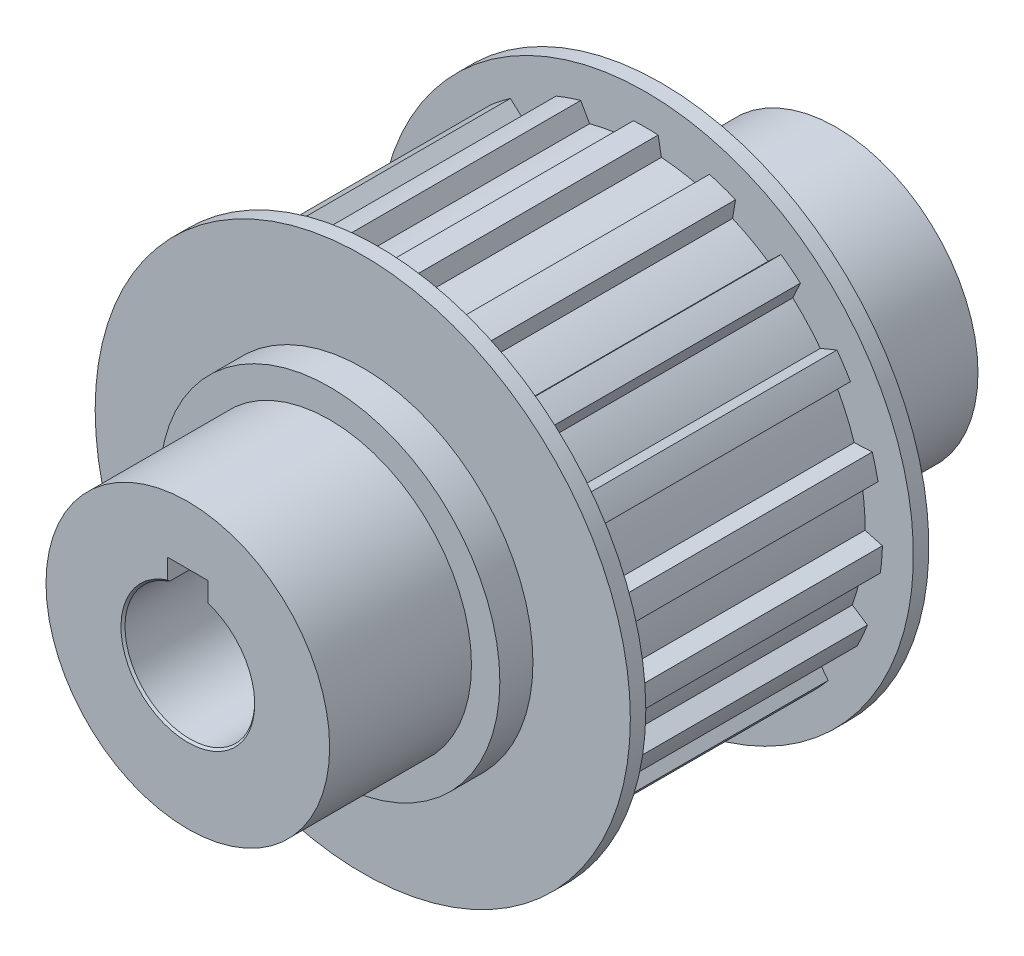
ISO-10303-21;
HEADER;
FILE_DESCRIPTION(('STEP AP214'),'2;1');
FILE_NAME('part.step','',(''),(''),'','','');
FILE_SCHEMA(('AUTOMOTIVE_DESIGN { 1 0 10303 214 1 1 1 1 }'));
ENDSEC;
DATA;
#1=APPLICATION_CONTEXT('core data for automotive mechanical design processes');
#2=APPLICATION_PROTOCOL_DEFINITION('international standard','automotive_design',2000,#1);
#3=PRODUCT_CONTEXT('',#1,'mechanical');
#4=PRODUCT('Part','Part','',(#3));
#5=PRODUCT_RELATED_PRODUCT_CATEGORY('part','',(#4));
#6=PRODUCT_DEFINITION_FORMATION('','',#4);
#7=PRODUCT_DEFINITION_CONTEXT('part definition',#1,'design');
#8=PRODUCT_DEFINITION('design','',#6,#7);
#9=PRODUCT_DEFINITION_SHAPE('','',#8);
#10=(LENGTH_UNIT() NAMED_UNIT(*) SI_UNIT(.MILLI.,.METRE.));
#11=(NAMED_UNIT(*) PLANE_ANGLE_UNIT() SI_UNIT($,.RADIAN.));
#12=(NAMED_UNIT(*) SI_UNIT($,.STERADIAN.) SOLID_ANGLE_UNIT());
#13=UNCERTAINTY_MEASURE_WITH_UNIT(LENGTH_MEASURE(1.E-05),#10,'distance_accuracy_value','');
#14=(GEOMETRIC_REPRESENTATION_CONTEXT(3) GLOBAL_UNCERTAINTY_ASSIGNED_CONTEXT((#13)) GLOBAL_UNIT_ASSIGNED_CONTEXT((#10,
#11,#12)) REPRESENTATION_CONTEXT('',''));
#15=CARTESIAN_POINT('',(0.,0.,0.));
#16=DIRECTION('',(0.,0.,1.));
#17=DIRECTION('',(1.,0.,0.));
#18=AXIS2_PLACEMENT_3D('',#15,#16,#17);
#19=CARTESIAN_POINT('',(0.,0.,0.));
#20=DIRECTION('',(0.,0.,1.));
#21=DIRECTION('',(1.,0.,0.));
#22=AXIS2_PLACEMENT_3D('',#19,#20,#21);
#23=CYLINDRICAL_SURFACE('',#22,29.21);
#24=CARTESIAN_POINT('',(0.,0.,-16.51));
#25=DIRECTION('',(0.,0.,1.));
#26=DIRECTION('',(1.,0.,0.));
#27=AXIS2_PLACEMENT_3D('',#24,#25,#26);
#28=CIRCLE('',#27,29.21);
#29=CARTESIAN_POINT('',(-1.524,29.1702163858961,-16.51));
#30=VERTEX_POINT('',#29);
#31=CARTESIAN_POINT('',(1.524,29.1702163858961,-16.51));
#32=VERTEX_POINT('',#31);
#33=EDGE_CURVE('E532',#30,#32,#28,.F.);
#34=ORIENTED_EDGE('',*,*,#33,.F.);
#35=DIRECTION('',(0.,0.,1.));
#36=VECTOR('',#35,1.);
#37=CARTESIAN_POINT('',(-1.524,29.1702163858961,0.));
#38=LINE('',#37,#36);
#39=CARTESIAN_POINT('',(-1.524,29.1702163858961,16.51));
#40=VERTEX_POINT('',#39);
#41=EDGE_CURVE('E531',#40,#30,#38,.F.);
#42=ORIENTED_EDGE('',*,*,#41,.F.);
#43=CARTESIAN_POINT('',(0.,0.,16.51));
#44=DIRECTION('',(0.,0.,1.));
#45=DIRECTION('',(1.,0.,0.));
#46=AXIS2_PLACEMENT_3D('',#43,#44,#45);
#47=CIRCLE('',#46,29.21);
#48=CARTESIAN_POINT('',(1.524,29.1702163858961,16.51));
#49=VERTEX_POINT('',#48);
#50=EDGE_CURVE('E19',#49,#40,#47,.T.);
#51=ORIENTED_EDGE('',*,*,#50,.F.);
#52=DIRECTION('',(0.,0.,1.));
#53=VECTOR('',#52,1.);
#54=CARTESIAN_POINT('',(1.524,29.1702163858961,0.));
#55=LINE('',#54,#53);
#56=EDGE_CURVE('E513',#32,#49,#55,.T.);
#57=ORIENTED_EDGE('',*,*,#56,.F.);
#58=EDGE_LOOP('',(#34,#42,#51,#57));
#59=FACE_BOUND('',#58,.T.);
#60=ADVANCED_FACE('F15',(#59),#23,.T.);
#61=CARTESIAN_POINT('',(1.524,29.1702163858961,0.));
#62=DIRECTION('',(0.983423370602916,0.181324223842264,0.));
#63=DIRECTION('',(-0.181324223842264,0.983423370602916,0.));
#64=AXIS2_PLACEMENT_3D('',#61,#62,#63);
#65=PLANE('',#64);
#66=DIRECTION('',(0.181324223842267,-0.983423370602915,0.));
#67=VECTOR('',#66,1.);
#68=CARTESIAN_POINT('',(1.524,29.1702163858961,-16.51));
#69=LINE('',#68,#67);
#70=CARTESIAN_POINT('',(1.92741928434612,26.9822464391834,-16.51));
#71=VERTEX_POINT('',#70);
#72=EDGE_CURVE('E929',#32,#71,#69,.T.);
#73=ORIENTED_EDGE('',*,*,#72,.F.);
#74=ORIENTED_EDGE('',*,*,#56,.T.);
#75=DIRECTION('',(-0.181324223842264,0.983423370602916,0.));
#76=VECTOR('',#75,1.);
#77=CARTESIAN_POINT('',(1.92741928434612,26.9822464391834,16.51));
#78=LINE('',#77,#76);
#79=CARTESIAN_POINT('',(1.92741928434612,26.9822464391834,16.51));
#80=VERTEX_POINT('',#79);
#81=EDGE_CURVE('E527',#80,#49,#78,.T.);
#82=ORIENTED_EDGE('',*,*,#81,.F.);
#83=DIRECTION('',(0.,0.,1.));
#84=VECTOR('',#83,1.);
#85=CARTESIAN_POINT('',(1.92741928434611,26.9822464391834,0.));
#86=LINE('',#85,#84);
#87=EDGE_CURVE('E690',#71,#80,#86,.T.);
#88=ORIENTED_EDGE('',*,*,#87,.F.);
#89=EDGE_LOOP('',(#73,#74,#82,#88));
#90=FACE_BOUND('',#89,.T.);
#91=ADVANCED_FACE('F1941',(#90),#65,.T.);
#92=CARTESIAN_POINT('',(0.,0.,0.));
#93=DIRECTION('',(0.,0.,1.));
#94=DIRECTION('',(1.,0.,0.));
#95=AXIS2_PLACEMENT_3D('',#92,#93,#94);
#96=CYLINDRICAL_SURFACE('',#95,27.0509993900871);
#97=CARTESIAN_POINT('',(0.,0.,-16.51));
#98=DIRECTION('',(0.,0.,1.));
#99=DIRECTION('',(1.,0.,0.));
#100=AXIS2_PLACEMENT_3D('',#97,#98,#99);
#101=CIRCLE('',#100,27.0509993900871);
#102=CARTESIAN_POINT('',(6.93813470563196,26.1461059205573,-16.51));
#103=VERTEX_POINT('',#102);
#104=EDGE_CURVE('E927',#71,#103,#101,.F.);
#105=ORIENTED_EDGE('',*,*,#104,.F.);
#106=ORIENTED_EDGE('',*,*,#87,.T.);
#107=CARTESIAN_POINT('',(0.,0.,16.51));
#108=DIRECTION('',(0.,0.,1.));
#109=DIRECTION('',(1.,0.,0.));
#110=AXIS2_PLACEMENT_3D('',#107,#108,#109);
#111=CIRCLE('',#110,27.0509993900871);
#112=CARTESIAN_POINT('',(6.93813470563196,26.1461059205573,16.51));
#113=VERTEX_POINT('',#112);
#114=EDGE_CURVE('E932',#113,#80,#111,.T.);
#115=ORIENTED_EDGE('',*,*,#114,.F.);
#116=DIRECTION('',(0.,0.,1.));
#117=VECTOR('',#116,1.);
#118=CARTESIAN_POINT('',(6.93813470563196,26.1461059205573,0.));
#119=LINE('',#118,#117);
#120=EDGE_CURVE('E688',#103,#113,#119,.T.);
#121=ORIENTED_EDGE('',*,*,#120,.F.);
#122=EDGE_LOOP('',(#105,#106,#115,#121));
#123=FACE_BOUND('',#122,.T.);
#124=ADVANCED_FACE('F1933',(#123),#96,.T.);
#125=CARTESIAN_POINT('',(6.93813470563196,26.1461059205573,0.));
#126=DIRECTION('',(-0.908770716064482,0.417295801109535,0.));
#127=DIRECTION('',(-0.417295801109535,-0.908770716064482,0.));
#128=AXIS2_PLACEMENT_3D('',#125,#126,#127);
#129=PLANE('',#128);
#130=DIRECTION('',(0.417295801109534,0.908770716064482,0.));
#131=VECTOR('',#130,1.);
#132=CARTESIAN_POINT('',(6.93813470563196,26.1461059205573,-16.51));
#133=LINE('',#132,#131);
#134=CARTESIAN_POINT('',(7.85141826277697,28.1350196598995,-16.51));
#135=VERTEX_POINT('',#134);
#136=EDGE_CURVE('E925',#103,#135,#133,.T.);
#137=ORIENTED_EDGE('',*,*,#136,.F.);
#138=ORIENTED_EDGE('',*,*,#120,.T.);
#139=DIRECTION('',(-0.417295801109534,-0.908770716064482,0.));
#140=VECTOR('',#139,1.);
#141=CARTESIAN_POINT('',(7.85141826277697,28.1350196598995,16.51));
#142=LINE('',#141,#140);
#143=CARTESIAN_POINT('',(7.85141826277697,28.1350196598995,16.51));
#144=VERTEX_POINT('',#143);
#145=EDGE_CURVE('E934',#144,#113,#142,.T.);
#146=ORIENTED_EDGE('',*,*,#145,.F.);
#147=DIRECTION('',(0.,0.,1.));
#148=VECTOR('',#147,1.);
#149=CARTESIAN_POINT('',(7.85141826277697,28.1350196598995,0.));
#150=LINE('',#149,#148);
#151=EDGE_CURVE('E686',#135,#144,#150,.T.);
#152=ORIENTED_EDGE('',*,*,#151,.F.);
#153=EDGE_LOOP('',(#137,#138,#146,#152));
#154=FACE_BOUND('',#153,.T.);
#155=ADVANCED_FACE('F1925',(#154),#129,.T.);
#156=CARTESIAN_POINT('',(0.,0.,0.));
#157=DIRECTION('',(0.,0.,1.));
#158=DIRECTION('',(1.,0.,0.));
#159=AXIS2_PLACEMENT_3D('',#156,#157,#158);
#160=CYLINDRICAL_SURFACE('',#159,29.21);
#161=CARTESIAN_POINT('',(0.,0.,-16.51));
#162=DIRECTION('',(0.,0.,1.));
#163=DIRECTION('',(1.,0.,0.));
#164=AXIS2_PLACEMENT_3D('',#161,#162,#163);
#165=CIRCLE('',#164,29.21);
#166=CARTESIAN_POINT('',(11.0725078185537,27.0300512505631,-16.51));
#167=VERTEX_POINT('',#166);
#168=EDGE_CURVE('E923',#135,#167,#165,.F.);
#169=ORIENTED_EDGE('',*,*,#168,.F.);
#170=ORIENTED_EDGE('',*,*,#151,.T.);
#171=CARTESIAN_POINT('',(0.,0.,16.51));
#172=DIRECTION('',(0.,0.,1.));
#173=DIRECTION('',(1.,0.,0.));
#174=AXIS2_PLACEMENT_3D('',#171,#172,#173);
#175=CIRCLE('',#174,29.21);
#176=CARTESIAN_POINT('',(11.0725078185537,27.0300512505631,16.51));
#177=VERTEX_POINT('',#176);
#178=EDGE_CURVE('E935',#177,#144,#175,.T.);
#179=ORIENTED_EDGE('',*,*,#178,.F.);
#180=DIRECTION('',(0.,0.,1.));
#181=VECTOR('',#180,1.);
#182=CARTESIAN_POINT('',(11.0725078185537,27.0300512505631,0.));
#183=LINE('',#182,#181);
#184=EDGE_CURVE('E684',#167,#177,#183,.T.);
#185=ORIENTED_EDGE('',*,*,#184,.F.);
#186=EDGE_LOOP('',(#169,#170,#179,#185));
#187=FACE_BOUND('',#186,.T.);
#188=ADVANCED_FACE('F1917',(#187),#160,.T.);
#189=CARTESIAN_POINT('',(11.0725078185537,27.0300512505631,0.));
#190=DIRECTION('',(0.986361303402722,-0.164594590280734,0.));
#191=DIRECTION('',(0.164594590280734,0.986361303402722,0.));
#192=AXIS2_PLACEMENT_3D('',#189,#190,#191);
#193=PLANE('',#192);
#194=DIRECTION('',(-0.164594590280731,-0.986361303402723,0.));
#195=VECTOR('',#194,1.);
#196=CARTESIAN_POINT('',(11.0725078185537,27.0300512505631,-16.51));
#197=LINE('',#196,#195);
#198=CARTESIAN_POINT('',(10.7073348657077,24.8416897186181,-16.51));
#199=VERTEX_POINT('',#198);
#200=EDGE_CURVE('E921',#167,#199,#197,.T.);
#201=ORIENTED_EDGE('',*,*,#200,.F.);
#202=ORIENTED_EDGE('',*,*,#184,.T.);
#203=DIRECTION('',(0.164594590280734,0.986361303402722,0.));
#204=VECTOR('',#203,1.);
#205=CARTESIAN_POINT('',(10.7073348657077,24.8416897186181,16.51));
#206=LINE('',#205,#204);
#207=CARTESIAN_POINT('',(10.7073348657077,24.8416897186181,16.51));
#208=VERTEX_POINT('',#207);
#209=EDGE_CURVE('E938',#208,#177,#206,.T.);
#210=ORIENTED_EDGE('',*,*,#209,.F.);
#211=DIRECTION('',(0.,0.,1.));
#212=VECTOR('',#211,1.);
#213=CARTESIAN_POINT('',(10.7073348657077,24.8416897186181,0.));
#214=LINE('',#213,#212);
#215=EDGE_CURVE('E682',#199,#208,#214,.T.);
#216=ORIENTED_EDGE('',*,*,#215,.F.);
#217=EDGE_LOOP('',(#201,#202,#210,#216));
#218=FACE_BOUND('',#217,.T.);
#219=ADVANCED_FACE('F1909',(#218),#193,.T.);
#220=CARTESIAN_POINT('',(0.,0.,0.));
#221=DIRECTION('',(0.,0.,1.));
#222=DIRECTION('',(1.,0.,0.));
#223=AXIS2_PLACEMENT_3D('',#220,#221,#222);
#224=CYLINDRICAL_SURFACE('',#223,27.0509993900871);
#225=CARTESIAN_POINT('',(0.,0.,-16.51));
#226=DIRECTION('',(0.,0.,1.));
#227=DIRECTION('',(1.,0.,0.));
#228=AXIS2_PLACEMENT_3D('',#225,#226,#227);
#229=CIRCLE('',#228,27.0509993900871);
#230=CARTESIAN_POINT('',(15.0844039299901,22.4547840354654,-16.51));
#231=VERTEX_POINT('',#230);
#232=EDGE_CURVE('E919',#199,#231,#229,.F.);
#233=ORIENTED_EDGE('',*,*,#232,.F.);
#234=ORIENTED_EDGE('',*,*,#215,.T.);
#235=CARTESIAN_POINT('',(0.,0.,16.51));
#236=DIRECTION('',(0.,0.,1.));
#237=DIRECTION('',(1.,0.,0.));
#238=AXIS2_PLACEMENT_3D('',#235,#236,#237);
#239=CIRCLE('',#238,27.0509993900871);
#240=CARTESIAN_POINT('',(15.0844039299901,22.4547840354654,16.51));
#241=VERTEX_POINT('',#240);
#242=EDGE_CURVE('E939',#241,#208,#239,.T.);
#243=ORIENTED_EDGE('',*,*,#242,.F.);
#244=DIRECTION('',(0.,0.,1.));
#245=VECTOR('',#244,1.);
#246=CARTESIAN_POINT('',(15.0844039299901,22.4547840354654,0.));
#247=LINE('',#246,#245);
#248=EDGE_CURVE('E680',#231,#241,#247,.T.);
#249=ORIENTED_EDGE('',*,*,#248,.F.);
#250=EDGE_LOOP('',(#233,#234,#243,#249));
#251=FACE_BOUND('',#250,.T.);
#252=ADVANCED_FACE('F1901',(#251),#224,.T.);
#253=CARTESIAN_POINT('',(15.0844039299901,22.4547840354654,0.));
#254=DIRECTION('',(-0.689624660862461,0.724166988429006,0.));
#255=DIRECTION('',(-0.724166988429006,-0.689624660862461,0.));
#256=AXIS2_PLACEMENT_3D('',#253,#254,#255);
#257=PLANE('',#256);
#258=DIRECTION('',(0.724166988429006,0.689624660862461,0.));
#259=VECTOR('',#258,1.);
#260=CARTESIAN_POINT('',(15.0844039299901,22.4547840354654,-16.51));
#261=LINE('',#260,#259);
#262=CARTESIAN_POINT('',(16.6829866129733,23.9771152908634,-16.51));
#263=VERTEX_POINT('',#262);
#264=EDGE_CURVE('E917',#231,#263,#261,.T.);
#265=ORIENTED_EDGE('',*,*,#264,.F.);
#266=ORIENTED_EDGE('',*,*,#248,.T.);
#267=DIRECTION('',(-0.724166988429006,-0.68962466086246,0.));
#268=VECTOR('',#267,1.);
#269=CARTESIAN_POINT('',(16.6829866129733,23.9771152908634,16.51));
#270=LINE('',#269,#268);
#271=CARTESIAN_POINT('',(16.6829866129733,23.9771152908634,16.51));
#272=VERTEX_POINT('',#271);
#273=EDGE_CURVE('E942',#272,#241,#270,.T.);
#274=ORIENTED_EDGE('',*,*,#273,.F.);
#275=DIRECTION('',(0.,0.,1.));
#276=VECTOR('',#275,1.);
#277=CARTESIAN_POINT('',(16.6829866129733,23.9771152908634,0.));
#278=LINE('',#277,#276);
#279=EDGE_CURVE('E678',#263,#272,#278,.T.);
#280=ORIENTED_EDGE('',*,*,#279,.F.);
#281=EDGE_LOOP('',(#265,#266,#274,#280));
#282=FACE_BOUND('',#281,.T.);
#283=ADVANCED_FACE('F1893',(#282),#257,.T.);
#284=CARTESIAN_POINT('',(0.,0.,0.));
#285=DIRECTION('',(0.,0.,1.));
#286=DIRECTION('',(1.,0.,0.));
#287=AXIS2_PLACEMENT_3D('',#284,#285,#286);
#288=CYLINDRICAL_SURFACE('',#287,29.21);
#289=CARTESIAN_POINT('',(0.,0.,-16.51));
#290=DIRECTION('',(0.,0.,1.));
#291=DIRECTION('',(1.,0.,0.));
#292=AXIS2_PLACEMENT_3D('',#289,#290,#291);
#293=CIRCLE('',#292,29.21);
#294=CARTESIAN_POINT('',(19.07738962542,22.1196135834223,-16.51));
#295=VERTEX_POINT('',#294);
#296=EDGE_CURVE('E915',#263,#295,#293,.F.);
#297=ORIENTED_EDGE('',*,*,#296,.F.);
#298=ORIENTED_EDGE('',*,*,#279,.T.);
#299=CARTESIAN_POINT('',(0.,0.,16.51));
#300=DIRECTION('',(0.,0.,1.));
#301=DIRECTION('',(1.,0.,0.));
#302=AXIS2_PLACEMENT_3D('',#299,#300,#301);
#303=CIRCLE('',#302,29.21);
#304=CARTESIAN_POINT('',(19.07738962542,22.1196135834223,16.51));
#305=VERTEX_POINT('',#304);
#306=EDGE_CURVE('E943',#305,#272,#303,.T.);
#307=ORIENTED_EDGE('',*,*,#306,.F.);
#308=DIRECTION('',(0.,0.,1.));
#309=VECTOR('',#308,1.);
#310=CARTESIAN_POINT('',(19.07738962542,22.1196135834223,0.));
#311=LINE('',#310,#309);
#312=EDGE_CURVE('E676',#295,#305,#311,.T.);
#313=ORIENTED_EDGE('',*,*,#312,.F.);
#314=EDGE_LOOP('',(#297,#298,#307,#313));
#315=FACE_BOUND('',#314,.T.);
#316=ADVANCED_FACE('F1885',(#315),#288,.T.);
#317=CARTESIAN_POINT('',(19.07738962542,22.1196135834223,0.));
#318=DIRECTION('',(0.908770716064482,-0.417295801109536,0.));
#319=DIRECTION('',(0.417295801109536,0.908770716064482,0.));
#320=AXIS2_PLACEMENT_3D('',#317,#318,#319);
#321=PLANE('',#320);
#322=DIRECTION('',(-0.417295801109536,-0.908770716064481,0.));
#323=VECTOR('',#322,1.);
#324=CARTESIAN_POINT('',(19.07738962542,22.1196135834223,-16.51));
#325=LINE('',#324,#323);
#326=CARTESIAN_POINT('',(18.1364655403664,20.0705053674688,-16.51));
#327=VERTEX_POINT('',#326);
#328=EDGE_CURVE('E913',#295,#327,#325,.T.);
#329=ORIENTED_EDGE('',*,*,#328,.F.);
#330=ORIENTED_EDGE('',*,*,#312,.T.);
#331=DIRECTION('',(0.417295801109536,0.908770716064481,0.));
#332=VECTOR('',#331,1.);
#333=CARTESIAN_POINT('',(18.1364655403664,20.0705053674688,16.51));
#334=LINE('',#333,#332);
#335=CARTESIAN_POINT('',(18.1364655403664,20.0705053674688,16.51));
#336=VERTEX_POINT('',#335);
#337=EDGE_CURVE('E946',#336,#305,#334,.T.);
#338=ORIENTED_EDGE('',*,*,#337,.F.);
#339=DIRECTION('',(0.,0.,1.));
#340=VECTOR('',#339,1.);
#341=CARTESIAN_POINT('',(18.1364655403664,20.0705053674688,0.));
#342=LINE('',#341,#340);
#343=EDGE_CURVE('E674',#327,#336,#342,.T.);
#344=ORIENTED_EDGE('',*,*,#343,.F.);
#345=EDGE_LOOP('',(#329,#330,#338,#344));
#346=FACE_BOUND('',#345,.T.);
#347=ADVANCED_FACE('F1877',(#346),#321,.T.);
#348=CARTESIAN_POINT('',(0.,0.,0.));
#349=DIRECTION('',(0.,0.,1.));
#350=DIRECTION('',(1.,0.,0.));
#351=AXIS2_PLACEMENT_3D('',#348,#349,#350);
#352=CYLINDRICAL_SURFACE('',#351,27.0509993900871);
#353=CARTESIAN_POINT('',(0.,0.,-16.51));
#354=DIRECTION('',(0.,0.,1.));
#355=DIRECTION('',(1.,0.,0.));
#356=AXIS2_PLACEMENT_3D('',#353,#354,#355);
#357=CIRCLE('',#356,27.0509993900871);
#358=CARTESIAN_POINT('',(21.5344337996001,16.3714608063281,-16.51));
#359=VERTEX_POINT('',#358);
#360=EDGE_CURVE('E911',#327,#359,#357,.F.);
#361=ORIENTED_EDGE('',*,*,#360,.F.);
#362=ORIENTED_EDGE('',*,*,#343,.T.);
#363=CARTESIAN_POINT('',(0.,0.,16.51));
#364=DIRECTION('',(0.,0.,1.));
#365=DIRECTION('',(1.,0.,0.));
#366=AXIS2_PLACEMENT_3D('',#363,#364,#365);
#367=CIRCLE('',#366,27.0509993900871);
#368=CARTESIAN_POINT('',(21.5344337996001,16.3714608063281,16.51));
#369=VERTEX_POINT('',#368);
#370=EDGE_CURVE('E947',#369,#336,#367,.T.);
#371=ORIENTED_EDGE('',*,*,#370,.F.);
#372=DIRECTION('',(0.,0.,1.));
#373=VECTOR('',#372,1.);
#374=CARTESIAN_POINT('',(21.5344337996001,16.3714608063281,0.));
#375=LINE('',#374,#373);
#376=EDGE_CURVE('E672',#359,#369,#375,.T.);
#377=ORIENTED_EDGE('',*,*,#376,.F.);
#378=EDGE_LOOP('',(#361,#362,#371,#377));
#379=FACE_BOUND('',#378,.T.);
#380=ADVANCED_FACE('F1869',(#379),#352,.T.);
#381=CARTESIAN_POINT('',(21.5344337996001,16.3714608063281,0.));
#382=DIRECTION('',(-0.3860830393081,0.922464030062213,0.));
#383=DIRECTION('',(-0.922464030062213,-0.3860830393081,0.));
#384=AXIS2_PLACEMENT_3D('',#381,#382,#383);
#385=PLANE('',#384);
#386=DIRECTION('',(0.922464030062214,0.3860830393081,0.));
#387=VECTOR('',#386,1.);
#388=CARTESIAN_POINT('',(21.5344337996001,16.3714608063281,-16.51));
#389=LINE('',#388,#387);
#390=CARTESIAN_POINT('',(23.5867783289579,17.2304378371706,-16.51));
#391=VERTEX_POINT('',#390);
#392=EDGE_CURVE('E909',#359,#391,#389,.T.);
#393=ORIENTED_EDGE('',*,*,#392,.F.);
#394=ORIENTED_EDGE('',*,*,#376,.T.);
#395=DIRECTION('',(-0.922464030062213,-0.3860830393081,0.));
#396=VECTOR('',#395,1.);
#397=CARTESIAN_POINT('',(23.586778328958,17.2304378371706,16.51));
#398=LINE('',#397,#396);
#399=CARTESIAN_POINT('',(23.586778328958,17.2304378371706,16.51));
#400=VERTEX_POINT('',#399);
#401=EDGE_CURVE('E950',#400,#369,#398,.T.);
#402=ORIENTED_EDGE('',*,*,#401,.F.);
#403=DIRECTION('',(0.,0.,1.));
#404=VECTOR('',#403,1.);
#405=CARTESIAN_POINT('',(23.586778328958,17.2304378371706,0.));
#406=LINE('',#405,#404);
#407=EDGE_CURVE('E670',#391,#400,#406,.T.);
#408=ORIENTED_EDGE('',*,*,#407,.F.);
#409=EDGE_LOOP('',(#393,#394,#402,#408));
#410=FACE_BOUND('',#409,.T.);
#411=ADVANCED_FACE('F1861',(#410),#385,.T.);
#412=CARTESIAN_POINT('',(0.,0.,0.));
#413=DIRECTION('',(0.,0.,1.));
#414=DIRECTION('',(1.,0.,0.));
#415=AXIS2_PLACEMENT_3D('',#412,#413,#414);
#416=CYLINDRICAL_SURFACE('',#415,29.21);
#417=CARTESIAN_POINT('',(0.,0.,-16.51));
#418=DIRECTION('',(0.,0.,1.));
#419=DIRECTION('',(1.,0.,0.));
#420=AXIS2_PLACEMENT_3D('',#417,#418,#419);
#421=CIRCLE('',#420,29.21);
#422=CARTESIAN_POINT('',(25.2542665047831,14.6780830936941,-16.51));
#423=VERTEX_POINT('',#422);
#424=EDGE_CURVE('E907',#391,#423,#421,.F.);
#425=ORIENTED_EDGE('',*,*,#424,.F.);
#426=ORIENTED_EDGE('',*,*,#407,.T.);
#427=CARTESIAN_POINT('',(0.,0.,16.51));
#428=DIRECTION('',(0.,0.,1.));
#429=DIRECTION('',(1.,0.,0.));
#430=AXIS2_PLACEMENT_3D('',#427,#428,#429);
#431=CIRCLE('',#430,29.21);
#432=CARTESIAN_POINT('',(25.2542665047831,14.6780830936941,16.51));
#433=VERTEX_POINT('',#432);
#434=EDGE_CURVE('E951',#433,#400,#431,.T.);
#435=ORIENTED_EDGE('',*,*,#434,.F.);
#436=DIRECTION('',(0.,0.,1.));
#437=VECTOR('',#436,1.);
#438=CARTESIAN_POINT('',(25.2542665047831,14.6780830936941,0.));
#439=LINE('',#438,#437);
#440=EDGE_CURVE('E668',#423,#433,#439,.T.);
#441=ORIENTED_EDGE('',*,*,#440,.F.);
#442=EDGE_LOOP('',(#425,#426,#435,#441));
#443=FACE_BOUND('',#442,.T.);
#444=ADVANCED_FACE('F1853',(#443),#416,.T.);
#445=CARTESIAN_POINT('',(25.2542665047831,14.6780830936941,0.));
#446=DIRECTION('',(0.68962466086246,-0.724166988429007,0.));
#447=DIRECTION('',(0.724166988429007,0.68962466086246,0.));
#448=AXIS2_PLACEMENT_3D('',#445,#446,#447);
#449=PLANE('',#448);
#450=DIRECTION('',(-0.724166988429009,-0.689624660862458,0.));
#451=VECTOR('',#450,1.);
#452=CARTESIAN_POINT('',(25.2542665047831,14.6780830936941,-16.51));
#453=LINE('',#452,#451);
#454=CARTESIAN_POINT('',(23.6431241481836,13.1437912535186,-16.51));
#455=VERTEX_POINT('',#454);
#456=EDGE_CURVE('E905',#423,#455,#453,.T.);
#457=ORIENTED_EDGE('',*,*,#456,.F.);
#458=ORIENTED_EDGE('',*,*,#440,.T.);
#459=DIRECTION('',(0.724166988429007,0.689624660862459,0.));
#460=VECTOR('',#459,1.);
#461=CARTESIAN_POINT('',(23.6431241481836,13.1437912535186,16.51));
#462=LINE('',#461,#460);
#463=CARTESIAN_POINT('',(23.6431241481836,13.1437912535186,16.51));
#464=VERTEX_POINT('',#463);
#465=EDGE_CURVE('E954',#464,#433,#462,.T.);
#466=ORIENTED_EDGE('',*,*,#465,.F.);
#467=DIRECTION('',(0.,0.,1.));
#468=VECTOR('',#467,1.);
#469=CARTESIAN_POINT('',(23.6431241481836,13.1437912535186,0.));
#470=LINE('',#469,#468);
#471=EDGE_CURVE('E666',#455,#464,#470,.T.);
#472=ORIENTED_EDGE('',*,*,#471,.F.);
#473=EDGE_LOOP('',(#457,#458,#466,#472));
#474=FACE_BOUND('',#473,.T.);
#475=ADVANCED_FACE('F1845',(#474),#449,.T.);
#476=CARTESIAN_POINT('',(0.,0.,0.));
#477=DIRECTION('',(0.,0.,1.));
#478=DIRECTION('',(1.,0.,0.));
#479=AXIS2_PLACEMENT_3D('',#476,#477,#478);
#480=CYLINDRICAL_SURFACE('',#479,27.0509993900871);
#481=CARTESIAN_POINT('',(0.,0.,-16.51));
#482=DIRECTION('',(0.,0.,1.));
#483=DIRECTION('',(1.,0.,0.));
#484=AXIS2_PLACEMENT_3D('',#481,#482,#483);
#485=CIRCLE('',#484,27.0509993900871);
#486=CARTESIAN_POINT('',(25.7165817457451,8.39130450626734,-16.51));
#487=VERTEX_POINT('',#486);
#488=EDGE_CURVE('E903',#455,#487,#485,.F.);
#489=ORIENTED_EDGE('',*,*,#488,.F.);
#490=ORIENTED_EDGE('',*,*,#471,.T.);
#491=CARTESIAN_POINT('',(0.,0.,16.51));
#492=DIRECTION('',(0.,0.,1.));
#493=DIRECTION('',(1.,0.,0.));
#494=AXIS2_PLACEMENT_3D('',#491,#492,#493);
#495=CIRCLE('',#494,27.0509993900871);
#496=CARTESIAN_POINT('',(25.7165817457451,8.39130450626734,16.51));
#497=VERTEX_POINT('',#496);
#498=EDGE_CURVE('E955',#497,#464,#495,.T.);
#499=ORIENTED_EDGE('',*,*,#498,.F.);
#500=DIRECTION('',(0.,0.,1.));
#501=VECTOR('',#500,1.);
#502=CARTESIAN_POINT('',(25.7165817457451,8.39130450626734,0.));
#503=LINE('',#502,#501);
#504=EDGE_CURVE('E664',#487,#497,#503,.T.);
#505=ORIENTED_EDGE('',*,*,#504,.F.);
#506=EDGE_LOOP('',(#489,#490,#499,#505));
#507=FACE_BOUND('',#506,.T.);
#508=ADVANCED_FACE('F1837',(#507),#480,.T.);
#509=CARTESIAN_POINT('',(25.7165817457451,8.39130450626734,0.));
#510=DIRECTION('',(-0.052173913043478,0.998638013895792,0.));
#511=DIRECTION('',(-0.998638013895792,-0.052173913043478,0.));
#512=AXIS2_PLACEMENT_3D('',#509,#510,#511);
#513=PLANE('',#512);
#514=DIRECTION('',(0.998638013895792,0.0521739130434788,0.));
#515=VECTOR('',#514,1.);
#516=CARTESIAN_POINT('',(25.7165817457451,8.39130450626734,-16.51));
#517=LINE('',#516,#515);
#518=CARTESIAN_POINT('',(27.9435845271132,8.50765442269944,-16.51));
#519=VERTEX_POINT('',#518);
#520=EDGE_CURVE('E901',#487,#519,#517,.T.);
#521=ORIENTED_EDGE('',*,*,#520,.F.);
#522=ORIENTED_EDGE('',*,*,#504,.T.);
#523=DIRECTION('',(-0.998638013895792,-0.0521739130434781,0.));
#524=VECTOR('',#523,1.);
#525=CARTESIAN_POINT('',(27.9435845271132,8.50765442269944,16.51));
#526=LINE('',#525,#524);
#527=CARTESIAN_POINT('',(27.9435845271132,8.50765442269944,16.51));
#528=VERTEX_POINT('',#527);
#529=EDGE_CURVE('E958',#528,#497,#526,.T.);
#530=ORIENTED_EDGE('',*,*,#529,.F.);
#531=DIRECTION('',(0.,0.,1.));
#532=VECTOR('',#531,1.);
#533=CARTESIAN_POINT('',(27.9435845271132,8.50765442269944,0.));
#534=LINE('',#533,#532);
#535=EDGE_CURVE('E662',#519,#528,#534,.T.);
#536=ORIENTED_EDGE('',*,*,#535,.F.);
#537=EDGE_LOOP('',(#521,#522,#530,#536));
#538=FACE_BOUND('',#537,.T.);
#539=ADVANCED_FACE('F1829',(#538),#513,.T.);
#540=CARTESIAN_POINT('',(0.,0.,0.));
#541=DIRECTION('',(0.,0.,1.));
#542=DIRECTION('',(1.,0.,0.));
#543=AXIS2_PLACEMENT_3D('',#540,#541,#542);
#544=CYLINDRICAL_SURFACE('',#543,29.21);
#545=CARTESIAN_POINT('',(0.,0.,-16.51));
#546=DIRECTION('',(0.,0.,1.));
#547=DIRECTION('',(1.,0.,0.));
#548=AXIS2_PLACEMENT_3D('',#545,#546,#547);
#549=CIRCLE('',#548,29.21);
#550=CARTESIAN_POINT('',(28.6517354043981,5.68349877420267,-16.51));
#551=VERTEX_POINT('',#550);
#552=EDGE_CURVE('E899',#519,#551,#549,.F.);
#553=ORIENTED_EDGE('',*,*,#552,.F.);
#554=ORIENTED_EDGE('',*,*,#535,.T.);
#555=CARTESIAN_POINT('',(0.,0.,16.51));
#556=DIRECTION('',(0.,0.,1.));
#557=DIRECTION('',(1.,0.,0.));
#558=AXIS2_PLACEMENT_3D('',#555,#556,#557);
#559=CIRCLE('',#558,29.21);
#560=CARTESIAN_POINT('',(28.651735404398,5.68349877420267,16.51));
#561=VERTEX_POINT('',#560);
#562=EDGE_CURVE('E959',#561,#528,#559,.T.);
#563=ORIENTED_EDGE('',*,*,#562,.F.);
#564=DIRECTION('',(0.,0.,1.));
#565=VECTOR('',#564,1.);
#566=CARTESIAN_POINT('',(28.6517354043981,5.68349877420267,0.));
#567=LINE('',#566,#565);
#568=EDGE_CURVE('E660',#551,#561,#567,.T.);
#569=ORIENTED_EDGE('',*,*,#568,.F.);
#570=EDGE_LOOP('',(#553,#554,#563,#569));
#571=FACE_BOUND('',#570,.T.);
#572=ADVANCED_FACE('F1821',(#571),#544,.T.);
#573=CARTESIAN_POINT('',(28.6517354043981,5.68349877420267,0.));
#574=DIRECTION('',(0.417191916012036,-0.908818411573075,0.));
#575=DIRECTION('',(0.908818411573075,0.417191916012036,0.));
#576=AXIS2_PLACEMENT_3D('',#573,#574,#575);
#577=PLANE('',#576);
#578=DIRECTION('',(-0.908818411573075,-0.417191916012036,0.));
#579=VECTOR('',#578,1.);
#580=CARTESIAN_POINT('',(28.6517354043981,5.68349877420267,-16.51));
#581=LINE('',#580,#579);
#582=CARTESIAN_POINT('',(26.6297503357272,4.7553091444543,-16.51));
#583=VERTEX_POINT('',#582);
#584=EDGE_CURVE('E897',#551,#583,#581,.T.);
#585=ORIENTED_EDGE('',*,*,#584,.F.);
#586=ORIENTED_EDGE('',*,*,#568,.T.);
#587=DIRECTION('',(0.908818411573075,0.417191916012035,0.));
#588=VECTOR('',#587,1.);
#589=CARTESIAN_POINT('',(26.6297503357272,4.7553091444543,16.51));
#590=LINE('',#589,#588);
#591=CARTESIAN_POINT('',(26.6297503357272,4.7553091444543,16.51));
#592=VERTEX_POINT('',#591);
#593=EDGE_CURVE('E962',#592,#561,#590,.T.);
#594=ORIENTED_EDGE('',*,*,#593,.F.);
#595=DIRECTION('',(0.,0.,1.));
#596=VECTOR('',#595,1.);
#597=CARTESIAN_POINT('',(26.6297503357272,4.7553091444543,0.));
#598=LINE('',#597,#596);
#599=EDGE_CURVE('E658',#583,#592,#598,.T.);
#600=ORIENTED_EDGE('',*,*,#599,.F.);
#601=EDGE_LOOP('',(#585,#586,#594,#600));
#602=FACE_BOUND('',#601,.T.);
#603=ADVANCED_FACE('F1813',(#602),#577,.T.);
#604=CARTESIAN_POINT('',(0.,0.,0.));
#605=DIRECTION('',(0.,0.,1.));
#606=DIRECTION('',(1.,0.,0.));
#607=AXIS2_PLACEMENT_3D('',#604,#605,#606);
#608=CYLINDRICAL_SURFACE('',#607,27.0509993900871);
#609=CARTESIAN_POINT('',(0.,0.,-16.51));
#610=DIRECTION('',(0.,0.,1.));
#611=DIRECTION('',(1.,0.,0.));
#612=AXIS2_PLACEMENT_3D('',#609,#610,#611);
#613=CIRCLE('',#612,27.0509993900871);
#614=CARTESIAN_POINT('',(27.0492602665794,-0.306736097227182,-16.51));
#615=VERTEX_POINT('',#614);
#616=EDGE_CURVE('E895',#583,#615,#613,.F.);
#617=ORIENTED_EDGE('',*,*,#616,.F.);
#618=ORIENTED_EDGE('',*,*,#599,.T.);
#619=CARTESIAN_POINT('',(0.,0.,16.51));
#620=DIRECTION('',(0.,0.,1.));
#621=DIRECTION('',(1.,0.,0.));
#622=AXIS2_PLACEMENT_3D('',#619,#620,#621);
#623=CIRCLE('',#622,27.0509993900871);
#624=CARTESIAN_POINT('',(27.0492602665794,-0.306736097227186,16.51));
#625=VERTEX_POINT('',#624);
#626=EDGE_CURVE('E963',#625,#592,#623,.T.);
#627=ORIENTED_EDGE('',*,*,#626,.F.);
#628=DIRECTION('',(0.,0.,1.));
#629=VECTOR('',#628,1.);
#630=CARTESIAN_POINT('',(27.0492602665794,-0.306736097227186,0.));
#631=LINE('',#630,#629);
#632=EDGE_CURVE('E656',#615,#625,#631,.T.);
#633=ORIENTED_EDGE('',*,*,#632,.F.);
#634=EDGE_LOOP('',(#617,#618,#627,#633));
#635=FACE_BOUND('',#634,.T.);
#636=ADVANCED_FACE('F1805',(#635),#608,.T.);
#637=CARTESIAN_POINT('',(27.0492602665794,-0.306736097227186,0.));
#638=DIRECTION('',(0.261841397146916,0.965110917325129,0.));
#639=DIRECTION('',(-0.965110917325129,0.261841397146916,0.));
#640=AXIS2_PLACEMENT_3D('',#637,#638,#639);
#641=PLANE('',#640);
#642=DIRECTION('',(0.965110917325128,-0.261841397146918,0.));
#643=VECTOR('',#642,1.);
#644=CARTESIAN_POINT('',(27.0492602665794,-0.30673609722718,-16.51));
#645=LINE('',#644,#643);
#646=CARTESIAN_POINT('',(29.1964598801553,-0.889286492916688,-16.51));
#647=VERTEX_POINT('',#646);
#648=EDGE_CURVE('E893',#615,#647,#645,.T.);
#649=ORIENTED_EDGE('',*,*,#648,.F.);
#650=ORIENTED_EDGE('',*,*,#632,.T.);
#651=DIRECTION('',(-0.965110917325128,0.261841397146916,0.));
#652=VECTOR('',#651,1.);
#653=CARTESIAN_POINT('',(29.1964598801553,-0.889286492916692,16.51));
#654=LINE('',#653,#652);
#655=CARTESIAN_POINT('',(29.1964598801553,-0.889286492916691,16.51));
#656=VERTEX_POINT('',#655);
#657=EDGE_CURVE('E966',#656,#625,#654,.T.);
#658=ORIENTED_EDGE('',*,*,#657,.F.);
#659=DIRECTION('',(0.,0.,1.));
#660=VECTOR('',#659,1.);
#661=CARTESIAN_POINT('',(29.1964598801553,-0.889286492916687,0.));
#662=LINE('',#661,#660);
#663=EDGE_CURVE('E654',#647,#656,#662,.T.);
#664=ORIENTED_EDGE('',*,*,#663,.F.);
#665=EDGE_LOOP('',(#649,#650,#658,#664));
#666=FACE_BOUND('',#665,.T.);
#667=ADVANCED_FACE('F1797',(#666),#641,.T.);
#668=CARTESIAN_POINT('',(0.,0.,0.));
#669=DIRECTION('',(0.,0.,1.));
#670=DIRECTION('',(1.,0.,0.));
#671=AXIS2_PLACEMENT_3D('',#668,#669,#670);
#672=CYLINDRICAL_SURFACE('',#671,29.21);
#673=CARTESIAN_POINT('',(0.,0.,-16.51));
#674=DIRECTION('',(0.,0.,1.));
#675=DIRECTION('',(1.,0.,0.));
#676=AXIS2_PLACEMENT_3D('',#673,#674,#675);
#677=CIRCLE('',#676,29.21);
#678=CARTESIAN_POINT('',(28.9447343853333,-3.92765214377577,-16.51));
#679=VERTEX_POINT('',#678);
#680=EDGE_CURVE('E891',#647,#679,#677,.F.);
#681=ORIENTED_EDGE('',*,*,#680,.F.);
#682=ORIENTED_EDGE('',*,*,#663,.T.);
#683=CARTESIAN_POINT('',(0.,0.,16.51));
#684=DIRECTION('',(0.,0.,1.));
#685=DIRECTION('',(1.,0.,0.));
#686=AXIS2_PLACEMENT_3D('',#683,#684,#685);
#687=CIRCLE('',#686,29.21);
#688=CARTESIAN_POINT('',(28.9447343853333,-3.92765214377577,16.51));
#689=VERTEX_POINT('',#688);
#690=EDGE_CURVE('E967',#689,#656,#687,.T.);
#691=ORIENTED_EDGE('',*,*,#690,.F.);
#692=DIRECTION('',(0.,0.,1.));
#693=VECTOR('',#692,1.);
#694=CARTESIAN_POINT('',(28.9447343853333,-3.92765214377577,0.));
#695=LINE('',#694,#693);
#696=EDGE_CURVE('E652',#679,#689,#695,.T.);
#697=ORIENTED_EDGE('',*,*,#696,.F.);
#698=EDGE_LOOP('',(#681,#682,#691,#697));
#699=FACE_BOUND('',#698,.T.);
#700=ADVANCED_FACE('F1789',(#699),#672,.T.);
#701=CARTESIAN_POINT('',(28.9447343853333,-3.92765214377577,0.));
#702=DIRECTION('',(0.071251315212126,-0.997458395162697,0.));
#703=DIRECTION('',(0.997458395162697,0.071251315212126,0.));
#704=AXIS2_PLACEMENT_3D('',#701,#702,#703);
#705=PLANE('',#704);
#706=DIRECTION('',(-0.997458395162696,-0.0712513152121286,0.));
#707=VECTOR('',#706,1.);
#708=CARTESIAN_POINT('',(28.9447343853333,-3.92765214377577,-16.51));
#709=LINE('',#708,#707);
#710=CARTESIAN_POINT('',(26.7407671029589,-4.08508785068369,-16.51));
#711=VERTEX_POINT('',#710);
#712=EDGE_CURVE('E889',#679,#711,#709,.T.);
#713=ORIENTED_EDGE('',*,*,#712,.F.);
#714=ORIENTED_EDGE('',*,*,#696,.T.);
#715=DIRECTION('',(0.997458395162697,0.0712513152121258,0.));
#716=VECTOR('',#715,1.);
#717=CARTESIAN_POINT('',(26.7407671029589,-4.08508785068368,16.51));
#718=LINE('',#717,#716);
#719=CARTESIAN_POINT('',(26.7407671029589,-4.08508785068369,16.51));
#720=VERTEX_POINT('',#719);
#721=EDGE_CURVE('E970',#720,#689,#718,.T.);
#722=ORIENTED_EDGE('',*,*,#721,.F.);
#723=DIRECTION('',(0.,0.,1.));
#724=VECTOR('',#723,1.);
#725=CARTESIAN_POINT('',(26.7407671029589,-4.08508785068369,0.));
#726=LINE('',#725,#724);
#727=EDGE_CURVE('E650',#711,#720,#726,.T.);
#728=ORIENTED_EDGE('',*,*,#727,.F.);
#729=EDGE_LOOP('',(#713,#714,#722,#728));
#730=FACE_BOUND('',#729,.T.);
#731=ADVANCED_FACE('F1781',(#730),#705,.T.);
#732=CARTESIAN_POINT('',(0.,0.,0.));
#733=DIRECTION('',(0.,0.,1.));
#734=DIRECTION('',(1.,0.,0.));
#735=AXIS2_PLACEMENT_3D('',#732,#733,#734);
#736=CYLINDRICAL_SURFACE('',#735,27.0509993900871);
#737=CARTESIAN_POINT('',(0.,0.,-16.51));
#738=DIRECTION('',(0.,0.,1.));
#739=DIRECTION('',(1.,0.,0.));
#740=AXIS2_PLACEMENT_3D('',#737,#738,#739);
#741=CIRCLE('',#740,27.0509993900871);
#742=CARTESIAN_POINT('',(25.4838570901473,-9.0735657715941,-16.51));
#743=VERTEX_POINT('',#742);
#744=EDGE_CURVE('E887',#711,#743,#741,.F.);
#745=ORIENTED_EDGE('',*,*,#744,.F.);
#746=ORIENTED_EDGE('',*,*,#727,.T.);
#747=CARTESIAN_POINT('',(0.,0.,16.51));
#748=DIRECTION('',(0.,0.,1.));
#749=DIRECTION('',(1.,0.,0.));
#750=AXIS2_PLACEMENT_3D('',#747,#748,#749);
#751=CIRCLE('',#750,27.0509993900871);
#752=CARTESIAN_POINT('',(25.4838570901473,-9.0735657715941,16.51));
#753=VERTEX_POINT('',#752);
#754=EDGE_CURVE('E971',#753,#720,#751,.T.);
#755=ORIENTED_EDGE('',*,*,#754,.F.);
#756=DIRECTION('',(0.,0.,1.));
#757=VECTOR('',#756,1.);
#758=CARTESIAN_POINT('',(25.4838570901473,-9.0735657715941,0.));
#759=LINE('',#758,#757);
#760=EDGE_CURVE('E648',#743,#753,#759,.T.);
#761=ORIENTED_EDGE('',*,*,#760,.F.);
#762=EDGE_LOOP('',(#745,#746,#755,#761));
#763=FACE_BOUND('',#762,.T.);
#764=ADVANCED_FACE('F1773',(#763),#736,.T.);
#765=CARTESIAN_POINT('',(25.4838570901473,-9.0735657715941,0.));
#766=DIRECTION('',(0.547252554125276,0.836967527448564,0.));
#767=DIRECTION('',(-0.836967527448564,0.547252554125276,0.));
#768=AXIS2_PLACEMENT_3D('',#765,#766,#767);
#769=PLANE('',#768);
#770=DIRECTION('',(0.836967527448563,-0.547252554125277,0.));
#771=VECTOR('',#770,1.);
#772=CARTESIAN_POINT('',(25.4838570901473,-9.0735657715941,-16.51));
#773=LINE('',#772,#771);
#774=CARTESIAN_POINT('',(27.3388530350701,-10.2864578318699,-16.51));
#775=VERTEX_POINT('',#774);
#776=EDGE_CURVE('E885',#743,#775,#773,.T.);
#777=ORIENTED_EDGE('',*,*,#776,.F.);
#778=ORIENTED_EDGE('',*,*,#760,.T.);
#779=DIRECTION('',(-0.836967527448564,0.547252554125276,0.));
#780=VECTOR('',#779,1.);
#781=CARTESIAN_POINT('',(27.3388530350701,-10.2864578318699,16.51));
#782=LINE('',#781,#780);
#783=CARTESIAN_POINT('',(27.3388530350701,-10.2864578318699,16.51));
#784=VERTEX_POINT('',#783);
#785=EDGE_CURVE('E974',#784,#753,#782,.T.);
#786=ORIENTED_EDGE('',*,*,#785,.F.);
#787=DIRECTION('',(0.,0.,1.));
#788=VECTOR('',#787,1.);
#789=CARTESIAN_POINT('',(27.3388530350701,-10.2864578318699,0.));
#790=LINE('',#789,#788);
#791=EDGE_CURVE('E646',#775,#784,#790,.T.);
#792=ORIENTED_EDGE('',*,*,#791,.F.);
#793=EDGE_LOOP('',(#777,#778,#786,#792));
#794=FACE_BOUND('',#793,.T.);
#795=ADVANCED_FACE('F1765',(#794),#769,.T.);
#796=CARTESIAN_POINT('',(0.,0.,0.));
#797=DIRECTION('',(0.,0.,1.));
#798=DIRECTION('',(1.,0.,0.));
#799=AXIS2_PLACEMENT_3D('',#796,#797,#798);
#800=CYLINDRICAL_SURFACE('',#799,29.21);
#801=CARTESIAN_POINT('',(0.,0.,-16.51));
#802=DIRECTION('',(0.,0.,1.));
#803=DIRECTION('',(1.,0.,0.));
#804=AXIS2_PLACEMENT_3D('',#801,#802,#803);
#805=CIRCLE('',#804,29.21);
#806=CARTESIAN_POINT('',(26.084094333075,-13.1470195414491,-16.51));
#807=VERTEX_POINT('',#806);
#808=EDGE_CURVE('E883',#775,#807,#805,.F.);
#809=ORIENTED_EDGE('',*,*,#808,.F.);
#810=ORIENTED_EDGE('',*,*,#791,.T.);
#811=CARTESIAN_POINT('',(0.,0.,16.51));
#812=DIRECTION('',(0.,0.,1.));
#813=DIRECTION('',(1.,0.,0.));
#814=AXIS2_PLACEMENT_3D('',#811,#812,#813);
#815=CIRCLE('',#814,29.21);
#816=CARTESIAN_POINT('',(26.084094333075,-13.1470195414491,16.51));
#817=VERTEX_POINT('',#816);
#818=EDGE_CURVE('E975',#817,#784,#815,.T.);
#819=ORIENTED_EDGE('',*,*,#818,.F.);
#820=DIRECTION('',(0.,0.,1.));
#821=VECTOR('',#820,1.);
#822=CARTESIAN_POINT('',(26.084094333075,-13.1470195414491,0.));
#823=LINE('',#822,#821);
#824=EDGE_CURVE('E644',#807,#817,#823,.T.);
#825=ORIENTED_EDGE('',*,*,#824,.F.);
#826=EDGE_LOOP('',(#809,#810,#819,#825));
#827=FACE_BOUND('',#826,.T.);
#828=ADVANCED_FACE('F1757',(#827),#800,.T.);
#829=CARTESIAN_POINT('',(26.084094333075,-13.1470195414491,0.));
#830=DIRECTION('',(-0.261841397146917,-0.965110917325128,0.));
#831=DIRECTION('',(0.965110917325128,-0.261841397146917,0.));
#832=AXIS2_PLACEMENT_3D('',#829,#830,#831);
#833=PLANE('',#832);
#834=DIRECTION('',(-0.965110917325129,0.261841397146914,0.));
#835=VECTOR('',#834,1.);
#836=CARTESIAN_POINT('',(26.084094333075,-13.1470195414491,-16.51));
#837=LINE('',#836,#835);
#838=CARTESIAN_POINT('',(23.9536332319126,-12.5690104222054,-16.51));
#839=VERTEX_POINT('',#838);
#840=EDGE_CURVE('E881',#807,#839,#837,.T.);
#841=ORIENTED_EDGE('',*,*,#840,.F.);
#842=ORIENTED_EDGE('',*,*,#824,.T.);
#843=DIRECTION('',(0.965110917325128,-0.261841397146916,0.));
#844=VECTOR('',#843,1.);
#845=CARTESIAN_POINT('',(23.9536332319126,-12.5690104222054,16.51));
#846=LINE('',#845,#844);
#847=CARTESIAN_POINT('',(23.9536332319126,-12.5690104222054,16.51));
#848=VERTEX_POINT('',#847);
#849=EDGE_CURVE('E978',#848,#817,#846,.T.);
#850=ORIENTED_EDGE('',*,*,#849,.F.);
#851=DIRECTION('',(0.,0.,1.));
#852=VECTOR('',#851,1.);
#853=CARTESIAN_POINT('',(23.9536332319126,-12.5690104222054,0.));
#854=LINE('',#853,#852);
#855=EDGE_CURVE('E642',#839,#848,#854,.T.);
#856=ORIENTED_EDGE('',*,*,#855,.F.);
#857=EDGE_LOOP('',(#841,#842,#850,#856));
#858=FACE_BOUND('',#857,.T.);
#859=ADVANCED_FACE('F1749',(#858),#833,.T.);
#860=CARTESIAN_POINT('',(0.,0.,0.));
#861=DIRECTION('',(0.,0.,1.));
#862=DIRECTION('',(1.,0.,0.));
#863=AXIS2_PLACEMENT_3D('',#860,#861,#862);
#864=CYLINDRICAL_SURFACE('',#863,27.0509993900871);
#865=CARTESIAN_POINT('',(0.,0.,-16.51));
#866=DIRECTION('',(0.,0.,1.));
#867=DIRECTION('',(1.,0.,0.));
#868=AXIS2_PLACEMENT_3D('',#865,#866,#867);
#869=CIRCLE('',#868,27.0509993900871);
#870=CARTESIAN_POINT('',(21.1568894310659,-16.8565298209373,-16.51));
#871=VERTEX_POINT('',#870);
#872=EDGE_CURVE('E879',#839,#871,#869,.F.);
#873=ORIENTED_EDGE('',*,*,#872,.F.);
#874=ORIENTED_EDGE('',*,*,#855,.T.);
#875=CARTESIAN_POINT('',(0.,0.,16.51));
#876=DIRECTION('',(0.,0.,1.));
#877=DIRECTION('',(1.,0.,0.));
#878=AXIS2_PLACEMENT_3D('',#875,#876,#877);
#879=CIRCLE('',#878,27.0509993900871);
#880=CARTESIAN_POINT('',(21.1568894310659,-16.8565298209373,16.51));
#881=VERTEX_POINT('',#880);
#882=EDGE_CURVE('E979',#881,#848,#879,.T.);
#883=ORIENTED_EDGE('',*,*,#882,.F.);
#884=DIRECTION('',(0.,0.,1.));
#885=VECTOR('',#884,1.);
#886=CARTESIAN_POINT('',(21.1568894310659,-16.8565298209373,0.));
#887=LINE('',#886,#885);
#888=EDGE_CURVE('E640',#871,#881,#887,.T.);
#889=ORIENTED_EDGE('',*,*,#888,.F.);
#890=EDGE_LOOP('',(#873,#874,#883,#889));
#891=FACE_BOUND('',#890,.T.);
#892=ADVANCED_FACE('F1741',(#891),#864,.T.);
#893=CARTESIAN_POINT('',(21.1568894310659,-16.8565298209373,0.));
#894=DIRECTION('',(0.799459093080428,0.600720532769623,0.));
#895=DIRECTION('',(-0.600720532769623,0.799459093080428,0.));
#896=AXIS2_PLACEMENT_3D('',#893,#894,#895);
#897=PLANE('',#896);
#898=DIRECTION('',(0.600720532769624,-0.799459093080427,0.));
#899=VECTOR('',#898,1.);
#900=CARTESIAN_POINT('',(21.1568894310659,-16.8565298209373,-16.51));
#901=LINE('',#900,#899);
#902=CARTESIAN_POINT('',(22.4934027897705,-18.6352067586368,-16.51));
#903=VERTEX_POINT('',#902);
#904=EDGE_CURVE('E877',#871,#903,#901,.T.);
#905=ORIENTED_EDGE('',*,*,#904,.F.);
#906=ORIENTED_EDGE('',*,*,#888,.T.);
#907=DIRECTION('',(-0.600720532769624,0.799459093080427,0.));
#908=VECTOR('',#907,1.);
#909=CARTESIAN_POINT('',(22.4934027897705,-18.6352067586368,16.51));
#910=LINE('',#909,#908);
#911=CARTESIAN_POINT('',(22.4934027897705,-18.6352067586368,16.51));
#912=VERTEX_POINT('',#911);
#913=EDGE_CURVE('E982',#912,#881,#910,.T.);
#914=ORIENTED_EDGE('',*,*,#913,.F.);
#915=DIRECTION('',(0.,0.,1.));
#916=VECTOR('',#915,1.);
#917=CARTESIAN_POINT('',(22.4934027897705,-18.6352067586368,0.));
#918=LINE('',#917,#916);
#919=EDGE_CURVE('E638',#903,#912,#918,.T.);
#920=ORIENTED_EDGE('',*,*,#919,.F.);
#921=EDGE_LOOP('',(#905,#906,#914,#920));
#922=FACE_BOUND('',#921,.T.);
#923=ADVANCED_FACE('F1733',(#922),#897,.T.);
#924=CARTESIAN_POINT('',(0.,0.,0.));
#925=DIRECTION('',(0.,0.,1.));
#926=DIRECTION('',(1.,0.,0.));
#927=AXIS2_PLACEMENT_3D('',#924,#925,#926);
#928=CYLINDRICAL_SURFACE('',#927,29.21);
#929=CARTESIAN_POINT('',(0.,0.,-16.51));
#930=DIRECTION('',(0.,0.,1.));
#931=DIRECTION('',(1.,0.,0.));
#932=AXIS2_PLACEMENT_3D('',#929,#930,#931);
#933=CIRCLE('',#932,29.21);
#934=CARTESIAN_POINT('',(20.4290485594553,-20.8776932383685,-16.51));
#935=VERTEX_POINT('',#934);
#936=EDGE_CURVE('E875',#903,#935,#933,.F.);
#937=ORIENTED_EDGE('',*,*,#936,.F.);
#938=ORIENTED_EDGE('',*,*,#919,.T.);
#939=CARTESIAN_POINT('',(0.,0.,16.51));
#940=DIRECTION('',(0.,0.,1.));
#941=DIRECTION('',(1.,0.,0.));
#942=AXIS2_PLACEMENT_3D('',#939,#940,#941);
#943=CIRCLE('',#942,29.21);
#944=CARTESIAN_POINT('',(20.4290485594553,-20.8776932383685,16.51));
#945=VERTEX_POINT('',#944);
#946=EDGE_CURVE('E983',#945,#912,#943,.T.);
#947=ORIENTED_EDGE('',*,*,#946,.F.);
#948=DIRECTION('',(0.,0.,1.));
#949=VECTOR('',#948,1.);
#950=CARTESIAN_POINT('',(20.4290485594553,-20.8776932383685,0.));
#951=LINE('',#950,#949);
#952=EDGE_CURVE('E636',#935,#945,#951,.T.);
#953=ORIENTED_EDGE('',*,*,#952,.F.);
#954=EDGE_LOOP('',(#937,#938,#947,#953));
#955=FACE_BOUND('',#954,.T.);
#956=ADVANCED_FACE('F1725',(#955),#928,.T.);
#957=CARTESIAN_POINT('',(20.4290485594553,-20.8776932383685,0.));
#958=DIRECTION('',(-0.532649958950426,-0.846335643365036,0.));
#959=DIRECTION('',(0.846335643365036,-0.532649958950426,0.));
#960=AXIS2_PLACEMENT_3D('',#957,#958,#959);
#961=PLANE('',#960);
#962=DIRECTION('',(-0.846335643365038,0.532649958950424,0.));
#963=VECTOR('',#962,1.);
#964=CARTESIAN_POINT('',(20.4290485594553,-20.8776932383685,-16.51));
#965=LINE('',#964,#963);
#966=CARTESIAN_POINT('',(18.5460783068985,-19.6926267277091,-16.51));
#967=VERTEX_POINT('',#966);
#968=EDGE_CURVE('E873',#935,#967,#965,.T.);
#969=ORIENTED_EDGE('',*,*,#968,.F.);
#970=ORIENTED_EDGE('',*,*,#952,.T.);
#971=DIRECTION('',(0.846335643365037,-0.532649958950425,0.));
#972=VECTOR('',#971,1.);
#973=CARTESIAN_POINT('',(18.5460783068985,-19.6926267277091,16.51));
#974=LINE('',#973,#972);
#975=CARTESIAN_POINT('',(18.5460783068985,-19.6926267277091,16.51));
#976=VERTEX_POINT('',#975);
#977=EDGE_CURVE('E986',#976,#945,#974,.T.);
#978=ORIENTED_EDGE('',*,*,#977,.F.);
#979=DIRECTION('',(0.,0.,1.));
#980=VECTOR('',#979,1.);
#981=CARTESIAN_POINT('',(18.5460783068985,-19.6926267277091,0.));
#982=LINE('',#981,#980);
#983=EDGE_CURVE('E634',#967,#976,#982,.T.);
#984=ORIENTED_EDGE('',*,*,#983,.F.);
#985=EDGE_LOOP('',(#969,#970,#978,#984));
#986=FACE_BOUND('',#985,.T.);
#987=ADVANCED_FACE('F1717',(#986),#961,.T.);
#988=CARTESIAN_POINT('',(0.,0.,0.));
#989=DIRECTION('',(0.,0.,1.));
#990=DIRECTION('',(1.,0.,0.));
#991=AXIS2_PLACEMENT_3D('',#988,#989,#990);
#992=CYLINDRICAL_SURFACE('',#991,27.0509993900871);
#993=CARTESIAN_POINT('',(0.,0.,-16.51));
#994=DIRECTION('',(0.,0.,1.));
#995=DIRECTION('',(1.,0.,0.));
#996=AXIS2_PLACEMENT_3D('',#993,#994,#995);
#997=CIRCLE('',#996,27.0509993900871);
#998=CARTESIAN_POINT('',(14.5372445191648,-22.8128273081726,-16.51));
#999=VERTEX_POINT('',#998);
#1000=EDGE_CURVE('E871',#967,#999,#997,.F.);
#1001=ORIENTED_EDGE('',*,*,#1000,.F.);
#1002=ORIENTED_EDGE('',*,*,#983,.T.);
#1003=CARTESIAN_POINT('',(0.,0.,16.51));
#1004=DIRECTION('',(0.,0.,1.));
#1005=DIRECTION('',(1.,0.,0.));
#1006=AXIS2_PLACEMENT_3D('',#1003,#1004,#1005);
#1007=CIRCLE('',#1006,27.0509993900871);
#1008=CARTESIAN_POINT('',(14.5372445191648,-22.8128273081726,16.51));
#1009=VERTEX_POINT('',#1008);
#1010=EDGE_CURVE('E987',#1009,#976,#1007,.T.);
#1011=ORIENTED_EDGE('',*,*,#1010,.F.);
#1012=DIRECTION('',(0.,0.,1.));
#1013=VECTOR('',#1012,1.);
#1014=CARTESIAN_POINT('',(14.5372445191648,-22.8128273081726,0.));
#1015=LINE('',#1014,#1013);
#1016=EDGE_CURVE('E632',#999,#1009,#1015,.T.);
#1017=ORIENTED_EDGE('',*,*,#1016,.F.);
#1018=EDGE_LOOP('',(#1001,#1002,#1011,#1017));
#1019=FACE_BOUND('',#1018,.T.);
#1020=ADVANCED_FACE('F1709',(#1019),#992,.T.);
#1021=CARTESIAN_POINT('',(14.5372445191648,-22.8128273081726,0.));
#1022=DIRECTION('',(0.951195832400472,0.308587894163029,0.));
#1023=DIRECTION('',(-0.308587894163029,0.951195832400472,0.));
#1024=AXIS2_PLACEMENT_3D('',#1021,#1022,#1023);
#1025=PLANE('',#1024);
#1026=DIRECTION('',(0.30858789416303,-0.951195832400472,0.));
#1027=VECTOR('',#1026,1.);
#1028=CARTESIAN_POINT('',(14.5372445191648,-22.8128273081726,-16.51));
#1029=LINE('',#1028,#1027);
#1030=CARTESIAN_POINT('',(15.2238064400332,-24.9290958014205,-16.51));
#1031=VERTEX_POINT('',#1030);
#1032=EDGE_CURVE('E869',#999,#1031,#1029,.T.);
#1033=ORIENTED_EDGE('',*,*,#1032,.F.);
#1034=ORIENTED_EDGE('',*,*,#1016,.T.);
#1035=DIRECTION('',(-0.30858789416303,0.951195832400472,0.));
#1036=VECTOR('',#1035,1.);
#1037=CARTESIAN_POINT('',(15.2238064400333,-24.9290958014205,16.51));
#1038=LINE('',#1037,#1036);
#1039=CARTESIAN_POINT('',(15.2238064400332,-24.9290958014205,16.51));
#1040=VERTEX_POINT('',#1039);
#1041=EDGE_CURVE('E990',#1040,#1009,#1038,.T.);
#1042=ORIENTED_EDGE('',*,*,#1041,.F.);
#1043=DIRECTION('',(0.,0.,1.));
#1044=VECTOR('',#1043,1.);
#1045=CARTESIAN_POINT('',(15.2238064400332,-24.9290958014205,0.));
#1046=LINE('',#1045,#1044);
#1047=EDGE_CURVE('E630',#1031,#1040,#1046,.T.);
#1048=ORIENTED_EDGE('',*,*,#1047,.F.);
#1049=EDGE_LOOP('',(#1033,#1034,#1042,#1048));
#1050=FACE_BOUND('',#1049,.T.);
#1051=ADVANCED_FACE('F1701',(#1050),#1025,.T.);
#1052=CARTESIAN_POINT('',(0.,0.,0.));
#1053=DIRECTION('',(0.,0.,1.));
#1054=DIRECTION('',(1.,0.,0.));
#1055=AXIS2_PLACEMENT_3D('',#1052,#1053,#1054);
#1056=CYLINDRICAL_SURFACE('',#1055,29.21);
#1057=CARTESIAN_POINT('',(0.,0.,-16.51));
#1058=DIRECTION('',(0.,0.,1.));
#1059=DIRECTION('',(1.,0.,0.));
#1060=AXIS2_PLACEMENT_3D('',#1057,#1058,#1059);
#1061=CIRCLE('',#1060,29.21);
#1062=CARTESIAN_POINT('',(12.5431704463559,-26.3797834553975,-16.51));
#1063=VERTEX_POINT('',#1062);
#1064=EDGE_CURVE('E867',#1031,#1063,#1061,.F.);
#1065=ORIENTED_EDGE('',*,*,#1064,.F.);
#1066=ORIENTED_EDGE('',*,*,#1047,.T.);
#1067=CARTESIAN_POINT('',(0.,0.,16.51));
#1068=DIRECTION('',(0.,0.,1.));
#1069=DIRECTION('',(1.,0.,0.));
#1070=AXIS2_PLACEMENT_3D('',#1067,#1068,#1069);
#1071=CIRCLE('',#1070,29.21);
#1072=CARTESIAN_POINT('',(12.5431704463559,-26.3797834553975,16.51));
#1073=VERTEX_POINT('',#1072);
#1074=EDGE_CURVE('E991',#1073,#1040,#1071,.T.);
#1075=ORIENTED_EDGE('',*,*,#1074,.F.);
#1076=DIRECTION('',(0.,0.,1.));
#1077=VECTOR('',#1076,1.);
#1078=CARTESIAN_POINT('',(12.5431704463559,-26.3797834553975,0.));
#1079=LINE('',#1078,#1077);
#1080=EDGE_CURVE('E628',#1063,#1073,#1079,.T.);
#1081=ORIENTED_EDGE('',*,*,#1080,.F.);
#1082=EDGE_LOOP('',(#1065,#1066,#1075,#1081));
#1083=FACE_BOUND('',#1082,.T.);
#1084=ADVANCED_FACE('F1693',(#1083),#1056,.T.);
#1085=CARTESIAN_POINT('',(12.5431704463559,-26.3797834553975,0.));
#1086=DIRECTION('',(-0.77859424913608,-0.62752768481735,0.));
#1087=DIRECTION('',(0.62752768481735,-0.77859424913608,0.));
#1088=AXIS2_PLACEMENT_3D('',#1085,#1086,#1087);
#1089=PLANE('',#1088);
#1090=DIRECTION('',(-0.627527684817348,0.778594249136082,0.));
#1091=VECTOR('',#1090,1.);
#1092=CARTESIAN_POINT('',(12.5431704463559,-26.3797834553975,-16.51));
#1093=LINE('',#1092,#1091);
#1094=CARTESIAN_POINT('',(11.1470151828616,-24.6475276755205,-16.51));
#1095=VERTEX_POINT('',#1094);
#1096=EDGE_CURVE('E865',#1063,#1095,#1093,.T.);
#1097=ORIENTED_EDGE('',*,*,#1096,.F.);
#1098=ORIENTED_EDGE('',*,*,#1080,.T.);
#1099=DIRECTION('',(0.62752768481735,-0.77859424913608,0.));
#1100=VECTOR('',#1099,1.);
#1101=CARTESIAN_POINT('',(11.1470151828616,-24.6475276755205,16.51));
#1102=LINE('',#1101,#1100);
#1103=CARTESIAN_POINT('',(11.1470151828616,-24.6475276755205,16.51));
#1104=VERTEX_POINT('',#1103);
#1105=EDGE_CURVE('E994',#1104,#1073,#1102,.T.);
#1106=ORIENTED_EDGE('',*,*,#1105,.F.);
#1107=DIRECTION('',(0.,0.,1.));
#1108=VECTOR('',#1107,1.);
#1109=CARTESIAN_POINT('',(11.1470151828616,-24.6475276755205,0.));
#1110=LINE('',#1109,#1108);
#1111=EDGE_CURVE('E626',#1095,#1104,#1110,.T.);
#1112=ORIENTED_EDGE('',*,*,#1111,.F.);
#1113=EDGE_LOOP('',(#1097,#1098,#1106,#1112));
#1114=FACE_BOUND('',#1113,.T.);
#1115=ADVANCED_FACE('F1685',(#1114),#1089,.T.);
#1116=CARTESIAN_POINT('',(0.,0.,0.));
#1117=DIRECTION('',(0.,0.,1.));
#1118=DIRECTION('',(1.,0.,0.));
#1119=AXIS2_PLACEMENT_3D('',#1116,#1117,#1118);
#1120=CYLINDRICAL_SURFACE('',#1119,27.0509993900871);
#1121=CARTESIAN_POINT('',(0.,0.,-16.51));
#1122=DIRECTION('',(0.,0.,1.));
#1123=DIRECTION('',(1.,0.,0.));
#1124=AXIS2_PLACEMENT_3D('',#1121,#1122,#1123);
#1125=CIRCLE('',#1124,27.0509993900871);
#1126=CARTESIAN_POINT('',(6.34226359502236,-26.2970009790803,-16.51));
#1127=VERTEX_POINT('',#1126);
#1128=EDGE_CURVE('E863',#1095,#1127,#1125,.F.);
#1129=ORIENTED_EDGE('',*,*,#1128,.F.);
#1130=ORIENTED_EDGE('',*,*,#1111,.T.);
#1131=CARTESIAN_POINT('',(0.,0.,16.51));
#1132=DIRECTION('',(0.,0.,1.));
#1133=DIRECTION('',(1.,0.,0.));
#1134=AXIS2_PLACEMENT_3D('',#1131,#1132,#1133);
#1135=CIRCLE('',#1134,27.0509993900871);
#1136=CARTESIAN_POINT('',(6.34226359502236,-26.2970009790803,16.51));
#1137=VERTEX_POINT('',#1136);
#1138=EDGE_CURVE('E995',#1137,#1104,#1135,.T.);
#1139=ORIENTED_EDGE('',*,*,#1138,.F.);
#1140=DIRECTION('',(0.,0.,1.));
#1141=VECTOR('',#1140,1.);
#1142=CARTESIAN_POINT('',(6.34226359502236,-26.2970009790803,0.));
#1143=LINE('',#1142,#1141);
#1144=EDGE_CURVE('E624',#1127,#1137,#1143,.T.);
#1145=ORIENTED_EDGE('',*,*,#1144,.F.);
#1146=EDGE_LOOP('',(#1129,#1130,#1139,#1145));
#1147=FACE_BOUND('',#1146,.T.);
#1148=ADVANCED_FACE('F1677',(#1147),#1120,.T.);
#1149=CARTESIAN_POINT('',(6.34226359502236,-26.2970009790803,0.));
#1150=DIRECTION('',(0.99985574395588,-0.016985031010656,0.));
#1151=DIRECTION('',(0.016985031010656,0.99985574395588,0.));
#1152=AXIS2_PLACEMENT_3D('',#1149,#1150,#1151);
#1153=PLANE('',#1152);
#1154=DIRECTION('',(-0.016985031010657,-0.99985574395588,0.));
#1155=VECTOR('',#1154,1.);
#1156=CARTESIAN_POINT('',(6.34226359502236,-26.2970009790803,-16.51));
#1157=LINE('',#1156,#1155);
#1158=CARTESIAN_POINT('',(6.30447444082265,-28.5215304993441,-16.51));
#1159=VERTEX_POINT('',#1158);
#1160=EDGE_CURVE('E861',#1127,#1159,#1157,.T.);
#1161=ORIENTED_EDGE('',*,*,#1160,.F.);
#1162=ORIENTED_EDGE('',*,*,#1144,.T.);
#1163=DIRECTION('',(0.0169850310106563,0.99985574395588,0.));
#1164=VECTOR('',#1163,1.);
#1165=CARTESIAN_POINT('',(6.30447444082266,-28.5215304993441,16.51));
#1166=LINE('',#1165,#1164);
#1167=CARTESIAN_POINT('',(6.30447444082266,-28.5215304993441,16.51));
#1168=VERTEX_POINT('',#1167);
#1169=EDGE_CURVE('E998',#1168,#1137,#1166,.T.);
#1170=ORIENTED_EDGE('',*,*,#1169,.F.);
#1171=DIRECTION('',(0.,0.,1.));
#1172=VECTOR('',#1171,1.);
#1173=CARTESIAN_POINT('',(6.30447444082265,-28.5215304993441,0.));
#1174=LINE('',#1173,#1172);
#1175=EDGE_CURVE('E622',#1159,#1168,#1174,.T.);
#1176=ORIENTED_EDGE('',*,*,#1175,.F.);
#1177=EDGE_LOOP('',(#1161,#1162,#1170,#1176));
#1178=FACE_BOUND('',#1177,.T.);
#1179=ADVANCED_FACE('F1669',(#1178),#1153,.T.);
#1180=CARTESIAN_POINT('',(0.,0.,0.));
#1181=DIRECTION('',(0.,0.,1.));
#1182=DIRECTION('',(1.,0.,0.));
#1183=AXIS2_PLACEMENT_3D('',#1180,#1181,#1182);
#1184=CYLINDRICAL_SURFACE('',#1183,29.21);
#1185=CARTESIAN_POINT('',(0.,0.,-16.51));
#1186=DIRECTION('',(0.,0.,1.));
#1187=DIRECTION('',(1.,0.,0.));
#1188=AXIS2_PLACEMENT_3D('',#1185,#1186,#1187);
#1189=CIRCLE('',#1188,29.21);
#1190=CARTESIAN_POINT('',(3.29804518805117,-29.0232148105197,-16.51));
#1191=VERTEX_POINT('',#1190);
#1192=EDGE_CURVE('E859',#1159,#1191,#1189,.F.);
#1193=ORIENTED_EDGE('',*,*,#1192,.F.);
#1194=ORIENTED_EDGE('',*,*,#1175,.T.);
#1195=CARTESIAN_POINT('',(0.,0.,16.51));
#1196=DIRECTION('',(0.,0.,1.));
#1197=DIRECTION('',(1.,0.,0.));
#1198=AXIS2_PLACEMENT_3D('',#1195,#1196,#1197);
#1199=CIRCLE('',#1198,29.21);
#1200=CARTESIAN_POINT('',(3.29804518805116,-29.0232148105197,16.51));
#1201=VERTEX_POINT('',#1200);
#1202=EDGE_CURVE('E999',#1201,#1168,#1199,.T.);
#1203=ORIENTED_EDGE('',*,*,#1202,.F.);
#1204=DIRECTION('',(0.,0.,1.));
#1205=VECTOR('',#1204,1.);
#1206=CARTESIAN_POINT('',(3.29804518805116,-29.0232148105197,0.));
#1207=LINE('',#1206,#1205);
#1208=EDGE_CURVE('E620',#1191,#1201,#1207,.T.);
#1209=ORIENTED_EDGE('',*,*,#1208,.F.);
#1210=EDGE_LOOP('',(#1193,#1194,#1203,#1209));
#1211=FACE_BOUND('',#1210,.T.);
#1212=ADVANCED_FACE('F1661',(#1211),#1184,.T.);
#1213=CARTESIAN_POINT('',(3.29804518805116,-29.0232148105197,0.));
#1214=DIRECTION('',(-0.940165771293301,-0.34071736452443,0.));
#1215=DIRECTION('',(0.34071736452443,-0.940165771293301,0.));
#1216=AXIS2_PLACEMENT_3D('',#1213,#1214,#1215);
#1217=PLANE('',#1216);
#1218=DIRECTION('',(-0.340717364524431,0.9401657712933,0.));
#1219=VECTOR('',#1218,1.);
#1220=CARTESIAN_POINT('',(3.29804518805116,-29.0232148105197,-16.51));
#1221=LINE('',#1220,#1219);
#1222=CARTESIAN_POINT('',(2.53999999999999,-26.9314865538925,-16.51));
#1223=VERTEX_POINT('',#1222);
#1224=EDGE_CURVE('E857',#1191,#1223,#1221,.T.);
#1225=ORIENTED_EDGE('',*,*,#1224,.F.);
#1226=ORIENTED_EDGE('',*,*,#1208,.T.);
#1227=DIRECTION('',(0.34071736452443,-0.9401657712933,0.));
#1228=VECTOR('',#1227,1.);
#1229=CARTESIAN_POINT('',(2.54,-26.9314865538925,16.51));
#1230=LINE('',#1229,#1228);
#1231=CARTESIAN_POINT('',(2.53999999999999,-26.9314865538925,16.51));
#1232=VERTEX_POINT('',#1231);
#1233=EDGE_CURVE('E1002',#1232,#1201,#1230,.T.);
#1234=ORIENTED_EDGE('',*,*,#1233,.F.);
#1235=DIRECTION('',(0.,0.,1.));
#1236=VECTOR('',#1235,1.);
#1237=CARTESIAN_POINT('',(2.53999999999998,-26.9314865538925,0.));
#1238=LINE('',#1237,#1236);
#1239=EDGE_CURVE('E618',#1223,#1232,#1238,.T.);
#1240=ORIENTED_EDGE('',*,*,#1239,.F.);
#1241=EDGE_LOOP('',(#1225,#1226,#1234,#1240));
#1242=FACE_BOUND('',#1241,.T.);
#1243=ADVANCED_FACE('F1653',(#1242),#1217,.T.);
#1244=CARTESIAN_POINT('',(0.,0.,0.));
#1245=DIRECTION('',(0.,0.,1.));
#1246=DIRECTION('',(1.,0.,0.));
#1247=AXIS2_PLACEMENT_3D('',#1244,#1245,#1246);
#1248=CYLINDRICAL_SURFACE('',#1247,27.0509993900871);
#1249=CARTESIAN_POINT('',(0.,0.,-16.51));
#1250=DIRECTION('',(0.,0.,1.));
#1251=DIRECTION('',(1.,0.,0.));
#1252=AXIS2_PLACEMENT_3D('',#1249,#1250,#1251);
#1253=CIRCLE('',#1252,27.0509993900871);
#1254=CARTESIAN_POINT('',(-2.54000000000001,-26.9314865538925,-16.51));
#1255=VERTEX_POINT('',#1254);
#1256=EDGE_CURVE('E855',#1223,#1255,#1253,.F.);
#1257=ORIENTED_EDGE('',*,*,#1256,.F.);
#1258=ORIENTED_EDGE('',*,*,#1239,.T.);
#1259=CARTESIAN_POINT('',(0.,0.,16.51));
#1260=DIRECTION('',(0.,0.,1.));
#1261=DIRECTION('',(1.,0.,0.));
#1262=AXIS2_PLACEMENT_3D('',#1259,#1260,#1261);
#1263=CIRCLE('',#1262,27.0509993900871);
#1264=CARTESIAN_POINT('',(-2.54000000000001,-26.9314865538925,16.51));
#1265=VERTEX_POINT('',#1264);
#1266=EDGE_CURVE('E1003',#1265,#1232,#1263,.T.);
#1267=ORIENTED_EDGE('',*,*,#1266,.F.);
#1268=DIRECTION('',(0.,0.,1.));
#1269=VECTOR('',#1268,1.);
#1270=CARTESIAN_POINT('',(-2.54000000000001,-26.9314865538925,0.));
#1271=LINE('',#1270,#1269);
#1272=EDGE_CURVE('E616',#1255,#1265,#1271,.T.);
#1273=ORIENTED_EDGE('',*,*,#1272,.F.);
#1274=EDGE_LOOP('',(#1257,#1258,#1267,#1273));
#1275=FACE_BOUND('',#1274,.T.);
#1276=ADVANCED_FACE('F1645',(#1275),#1248,.T.);
#1277=CARTESIAN_POINT('',(-2.54000000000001,-26.9314865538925,0.));
#1278=DIRECTION('',(0.940165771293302,-0.340717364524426,0.));
#1279=DIRECTION('',(0.340717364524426,0.940165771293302,0.));
#1280=AXIS2_PLACEMENT_3D('',#1277,#1278,#1279);
#1281=PLANE('',#1280);
#1282=DIRECTION('',(-0.340717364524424,-0.940165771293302,0.));
#1283=VECTOR('',#1282,1.);
#1284=CARTESIAN_POINT('',(-2.54000000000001,-26.9314865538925,-16.51));
#1285=LINE('',#1284,#1283);
#1286=CARTESIAN_POINT('',(-3.29804518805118,-29.0232148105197,-16.51));
#1287=VERTEX_POINT('',#1286);
#1288=EDGE_CURVE('E853',#1255,#1287,#1285,.T.);
#1289=ORIENTED_EDGE('',*,*,#1288,.F.);
#1290=ORIENTED_EDGE('',*,*,#1272,.T.);
#1291=DIRECTION('',(0.340717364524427,0.940165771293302,0.));
#1292=VECTOR('',#1291,1.);
#1293=CARTESIAN_POINT('',(-3.29804518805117,-29.0232148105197,16.51));
#1294=LINE('',#1293,#1292);
#1295=CARTESIAN_POINT('',(-3.29804518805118,-29.0232148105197,16.51));
#1296=VERTEX_POINT('',#1295);
#1297=EDGE_CURVE('E1006',#1296,#1265,#1294,.T.);
#1298=ORIENTED_EDGE('',*,*,#1297,.F.);
#1299=DIRECTION('',(0.,0.,1.));
#1300=VECTOR('',#1299,1.);
#1301=CARTESIAN_POINT('',(-3.29804518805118,-29.0232148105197,0.));
#1302=LINE('',#1301,#1300);
#1303=EDGE_CURVE('E614',#1287,#1296,#1302,.T.);
#1304=ORIENTED_EDGE('',*,*,#1303,.F.);
#1305=EDGE_LOOP('',(#1289,#1290,#1298,#1304));
#1306=FACE_BOUND('',#1305,.T.);
#1307=ADVANCED_FACE('F1637',(#1306),#1281,.T.);
#1308=CARTESIAN_POINT('',(0.,0.,0.));
#1309=DIRECTION('',(0.,0.,1.));
#1310=DIRECTION('',(1.,0.,0.));
#1311=AXIS2_PLACEMENT_3D('',#1308,#1309,#1310);
#1312=CYLINDRICAL_SURFACE('',#1311,29.21);
#1313=CARTESIAN_POINT('',(0.,0.,-16.51));
#1314=DIRECTION('',(0.,0.,1.));
#1315=DIRECTION('',(1.,0.,0.));
#1316=AXIS2_PLACEMENT_3D('',#1313,#1314,#1315);
#1317=CIRCLE('',#1316,29.21);
#1318=CARTESIAN_POINT('',(-6.30447444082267,-28.5215304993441,-16.51));
#1319=VERTEX_POINT('',#1318);
#1320=EDGE_CURVE('E851',#1287,#1319,#1317,.F.);
#1321=ORIENTED_EDGE('',*,*,#1320,.F.);
#1322=ORIENTED_EDGE('',*,*,#1303,.T.);
#1323=CARTESIAN_POINT('',(0.,0.,16.51));
#1324=DIRECTION('',(0.,0.,1.));
#1325=DIRECTION('',(1.,0.,0.));
#1326=AXIS2_PLACEMENT_3D('',#1323,#1324,#1325);
#1327=CIRCLE('',#1326,29.21);
#1328=CARTESIAN_POINT('',(-6.30447444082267,-28.5215304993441,16.51));
#1329=VERTEX_POINT('',#1328);
#1330=EDGE_CURVE('E1007',#1329,#1296,#1327,.T.);
#1331=ORIENTED_EDGE('',*,*,#1330,.F.);
#1332=DIRECTION('',(0.,0.,1.));
#1333=VECTOR('',#1332,1.);
#1334=CARTESIAN_POINT('',(-6.30447444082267,-28.5215304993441,0.));
#1335=LINE('',#1334,#1333);
#1336=EDGE_CURVE('E612',#1319,#1329,#1335,.T.);
#1337=ORIENTED_EDGE('',*,*,#1336,.F.);
#1338=EDGE_LOOP('',(#1321,#1322,#1331,#1337));
#1339=FACE_BOUND('',#1338,.T.);
#1340=ADVANCED_FACE('F1629',(#1339),#1312,.T.);
#1341=CARTESIAN_POINT('',(-6.30447444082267,-28.5215304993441,0.));
#1342=DIRECTION('',(-0.99985574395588,-0.016985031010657,0.));
#1343=DIRECTION('',(0.016985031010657,-0.99985574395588,0.));
#1344=AXIS2_PLACEMENT_3D('',#1341,#1342,#1343);
#1345=PLANE('',#1344);
#1346=DIRECTION('',(-0.016985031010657,0.99985574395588,0.));
#1347=VECTOR('',#1346,1.);
#1348=CARTESIAN_POINT('',(-6.30447444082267,-28.5215304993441,-16.51));
#1349=LINE('',#1348,#1347);
#1350=CARTESIAN_POINT('',(-6.34226359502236,-26.2970009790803,-16.51));
#1351=VERTEX_POINT('',#1350);
#1352=EDGE_CURVE('E849',#1319,#1351,#1349,.T.);
#1353=ORIENTED_EDGE('',*,*,#1352,.F.);
#1354=ORIENTED_EDGE('',*,*,#1336,.T.);
#1355=DIRECTION('',(0.0169850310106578,-0.99985574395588,0.));
#1356=VECTOR('',#1355,1.);
#1357=CARTESIAN_POINT('',(-6.34226359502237,-26.2970009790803,16.51));
#1358=LINE('',#1357,#1356);
#1359=CARTESIAN_POINT('',(-6.34226359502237,-26.2970009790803,16.51));
#1360=VERTEX_POINT('',#1359);
#1361=EDGE_CURVE('E1010',#1360,#1329,#1358,.T.);
#1362=ORIENTED_EDGE('',*,*,#1361,.F.);
#1363=DIRECTION('',(0.,0.,1.));
#1364=VECTOR('',#1363,1.);
#1365=CARTESIAN_POINT('',(-6.34226359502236,-26.2970009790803,0.));
#1366=LINE('',#1365,#1364);
#1367=EDGE_CURVE('E610',#1351,#1360,#1366,.T.);
#1368=ORIENTED_EDGE('',*,*,#1367,.F.);
#1369=EDGE_LOOP('',(#1353,#1354,#1362,#1368));
#1370=FACE_BOUND('',#1369,.T.);
#1371=ADVANCED_FACE('F1621',(#1370),#1345,.T.);
#1372=CARTESIAN_POINT('',(0.,0.,0.));
#1373=DIRECTION('',(0.,0.,1.));
#1374=DIRECTION('',(1.,0.,0.));
#1375=AXIS2_PLACEMENT_3D('',#1372,#1373,#1374);
#1376=CYLINDRICAL_SURFACE('',#1375,27.0509993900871);
#1377=CARTESIAN_POINT('',(0.,0.,-16.51));
#1378=DIRECTION('',(0.,0.,1.));
#1379=DIRECTION('',(1.,0.,0.));
#1380=AXIS2_PLACEMENT_3D('',#1377,#1378,#1379);
#1381=CIRCLE('',#1380,27.0509993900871);
#1382=CARTESIAN_POINT('',(-11.1827363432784,-24.6313413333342,-16.51));
#1383=VERTEX_POINT('',#1382);
#1384=EDGE_CURVE('E847',#1351,#1383,#1381,.F.);
#1385=ORIENTED_EDGE('',*,*,#1384,.F.);
#1386=ORIENTED_EDGE('',*,*,#1367,.T.);
#1387=CARTESIAN_POINT('',(0.,0.,16.51));
#1388=DIRECTION('',(0.,0.,1.));
#1389=DIRECTION('',(1.,0.,0.));
#1390=AXIS2_PLACEMENT_3D('',#1387,#1388,#1389);
#1391=CIRCLE('',#1390,27.0509993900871);
#1392=CARTESIAN_POINT('',(-11.1827363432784,-24.6313413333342,16.51));
#1393=VERTEX_POINT('',#1392);
#1394=EDGE_CURVE('E1011',#1393,#1360,#1391,.T.);
#1395=ORIENTED_EDGE('',*,*,#1394,.F.);
#1396=DIRECTION('',(0.,0.,1.));
#1397=VECTOR('',#1396,1.);
#1398=CARTESIAN_POINT('',(-11.1827363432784,-24.6313413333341,0.));
#1399=LINE('',#1398,#1397);
#1400=EDGE_CURVE('E608',#1383,#1393,#1399,.T.);
#1401=ORIENTED_EDGE('',*,*,#1400,.F.);
#1402=EDGE_LOOP('',(#1385,#1386,#1395,#1401));
#1403=FACE_BOUND('',#1402,.T.);
#1404=ADVANCED_FACE('F1613',(#1403),#1376,.T.);
#1405=CARTESIAN_POINT('',(-11.1827363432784,-24.6313413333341,0.));
#1406=DIRECTION('',(0.799413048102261,-0.600781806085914,0.));
#1407=DIRECTION('',(0.600781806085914,0.799413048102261,0.));
#1408=AXIS2_PLACEMENT_3D('',#1405,#1406,#1407);
#1409=PLANE('',#1408);
#1410=DIRECTION('',(-0.600781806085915,-0.79941304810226,0.));
#1411=VECTOR('',#1410,1.);
#1412=CARTESIAN_POINT('',(-11.1827363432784,-24.6313413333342,-16.51));
#1413=LINE('',#1412,#1411);
#1414=CARTESIAN_POINT('',(-12.5089489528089,-26.3960280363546,-16.51));
#1415=VERTEX_POINT('',#1414);
#1416=EDGE_CURVE('E845',#1383,#1415,#1413,.T.);
#1417=ORIENTED_EDGE('',*,*,#1416,.F.);
#1418=ORIENTED_EDGE('',*,*,#1400,.T.);
#1419=DIRECTION('',(0.600781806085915,0.79941304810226,0.));
#1420=VECTOR('',#1419,1.);
#1421=CARTESIAN_POINT('',(-12.5089489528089,-26.3960280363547,16.51));
#1422=LINE('',#1421,#1420);
#1423=CARTESIAN_POINT('',(-12.5089489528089,-26.3960280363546,16.51));
#1424=VERTEX_POINT('',#1423);
#1425=EDGE_CURVE('E1014',#1424,#1393,#1422,.T.);
#1426=ORIENTED_EDGE('',*,*,#1425,.F.);
#1427=DIRECTION('',(0.,0.,1.));
#1428=VECTOR('',#1427,1.);
#1429=CARTESIAN_POINT('',(-12.5089489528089,-26.3960280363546,0.));
#1430=LINE('',#1429,#1428);
#1431=EDGE_CURVE('E606',#1415,#1424,#1430,.T.);
#1432=ORIENTED_EDGE('',*,*,#1431,.F.);
#1433=EDGE_LOOP('',(#1417,#1418,#1426,#1432));
#1434=FACE_BOUND('',#1433,.T.);
#1435=ADVANCED_FACE('F1605',(#1434),#1409,.T.);
#1436=CARTESIAN_POINT('',(0.,0.,0.));
#1437=DIRECTION('',(0.,0.,1.));
#1438=DIRECTION('',(1.,0.,0.));
#1439=AXIS2_PLACEMENT_3D('',#1436,#1437,#1438);
#1440=CYLINDRICAL_SURFACE('',#1439,29.21);
#1441=CARTESIAN_POINT('',(0.,0.,-16.51));
#1442=DIRECTION('',(0.,0.,1.));
#1443=DIRECTION('',(1.,0.,0.));
#1444=AXIS2_PLACEMENT_3D('',#1441,#1442,#1443);
#1445=CIRCLE('',#1444,29.21);
#1446=CARTESIAN_POINT('',(-15.2238064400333,-24.9290958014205,-16.51));
#1447=VERTEX_POINT('',#1446);
#1448=EDGE_CURVE('E843',#1415,#1447,#1445,.F.);
#1449=ORIENTED_EDGE('',*,*,#1448,.F.);
#1450=ORIENTED_EDGE('',*,*,#1431,.T.);
#1451=CARTESIAN_POINT('',(0.,0.,16.51));
#1452=DIRECTION('',(0.,0.,1.));
#1453=DIRECTION('',(1.,0.,0.));
#1454=AXIS2_PLACEMENT_3D('',#1451,#1452,#1453);
#1455=CIRCLE('',#1454,29.21);
#1456=CARTESIAN_POINT('',(-15.2238064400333,-24.9290958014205,16.51));
#1457=VERTEX_POINT('',#1456);
#1458=EDGE_CURVE('E1015',#1457,#1424,#1455,.T.);
#1459=ORIENTED_EDGE('',*,*,#1458,.F.);
#1460=DIRECTION('',(0.,0.,1.));
#1461=VECTOR('',#1460,1.);
#1462=CARTESIAN_POINT('',(-15.2238064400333,-24.9290958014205,0.));
#1463=LINE('',#1462,#1461);
#1464=EDGE_CURVE('E604',#1447,#1457,#1463,.T.);
#1465=ORIENTED_EDGE('',*,*,#1464,.F.);
#1466=EDGE_LOOP('',(#1449,#1450,#1459,#1465));
#1467=FACE_BOUND('',#1466,.T.);
#1468=ADVANCED_FACE('F1597',(#1467),#1440,.T.);
#1469=CARTESIAN_POINT('',(-15.2238064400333,-24.9290958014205,0.));
#1470=DIRECTION('',(-0.951195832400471,0.308587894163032,0.));
#1471=DIRECTION('',(-0.308587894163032,-0.951195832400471,0.));
#1472=AXIS2_PLACEMENT_3D('',#1469,#1470,#1471);
#1473=PLANE('',#1472);
#1474=DIRECTION('',(0.308587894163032,0.951195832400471,0.));
#1475=VECTOR('',#1474,1.);
#1476=CARTESIAN_POINT('',(-15.2238064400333,-24.9290958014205,-16.51));
#1477=LINE('',#1476,#1475);
#1478=CARTESIAN_POINT('',(-14.5372445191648,-22.8128273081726,-16.51));
#1479=VERTEX_POINT('',#1478);
#1480=EDGE_CURVE('E841',#1447,#1479,#1477,.T.);
#1481=ORIENTED_EDGE('',*,*,#1480,.F.);
#1482=ORIENTED_EDGE('',*,*,#1464,.T.);
#1483=DIRECTION('',(-0.308587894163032,-0.951195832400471,0.));
#1484=VECTOR('',#1483,1.);
#1485=CARTESIAN_POINT('',(-14.5372445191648,-22.8128273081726,16.51));
#1486=LINE('',#1485,#1484);
#1487=CARTESIAN_POINT('',(-14.5372445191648,-22.8128273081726,16.51));
#1488=VERTEX_POINT('',#1487);
#1489=EDGE_CURVE('E1018',#1488,#1457,#1486,.T.);
#1490=ORIENTED_EDGE('',*,*,#1489,.F.);
#1491=DIRECTION('',(0.,0.,1.));
#1492=VECTOR('',#1491,1.);
#1493=CARTESIAN_POINT('',(-14.5372445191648,-22.8128273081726,0.));
#1494=LINE('',#1493,#1492);
#1495=EDGE_CURVE('E602',#1479,#1488,#1494,.T.);
#1496=ORIENTED_EDGE('',*,*,#1495,.F.);
#1497=EDGE_LOOP('',(#1481,#1482,#1490,#1496));
#1498=FACE_BOUND('',#1497,.T.);
#1499=ADVANCED_FACE('F1589',(#1498),#1473,.T.);
#1500=CARTESIAN_POINT('',(0.,0.,0.));
#1501=DIRECTION('',(0.,0.,1.));
#1502=DIRECTION('',(1.,0.,0.));
#1503=AXIS2_PLACEMENT_3D('',#1500,#1501,#1502);
#1504=CYLINDRICAL_SURFACE('',#1503,27.0509993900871);
#1505=CARTESIAN_POINT('',(0.,0.,-16.51));
#1506=DIRECTION('',(0.,0.,1.));
#1507=DIRECTION('',(1.,0.,0.));
#1508=AXIS2_PLACEMENT_3D('',#1505,#1506,#1507);
#1509=CIRCLE('',#1508,27.0509993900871);
#1510=CARTESIAN_POINT('',(-18.5460783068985,-19.6926267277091,-16.51));
#1511=VERTEX_POINT('',#1510);
#1512=EDGE_CURVE('E839',#1479,#1511,#1509,.F.);
#1513=ORIENTED_EDGE('',*,*,#1512,.F.);
#1514=ORIENTED_EDGE('',*,*,#1495,.T.);
#1515=CARTESIAN_POINT('',(0.,0.,16.51));
#1516=DIRECTION('',(0.,0.,1.));
#1517=DIRECTION('',(1.,0.,0.));
#1518=AXIS2_PLACEMENT_3D('',#1515,#1516,#1517);
#1519=CIRCLE('',#1518,27.0509993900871);
#1520=CARTESIAN_POINT('',(-18.5460783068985,-19.6926267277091,16.51));
#1521=VERTEX_POINT('',#1520);
#1522=EDGE_CURVE('E1019',#1521,#1488,#1519,.T.);
#1523=ORIENTED_EDGE('',*,*,#1522,.F.);
#1524=DIRECTION('',(0.,0.,1.));
#1525=VECTOR('',#1524,1.);
#1526=CARTESIAN_POINT('',(-18.5460783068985,-19.6926267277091,0.));
#1527=LINE('',#1526,#1525);
#1528=EDGE_CURVE('E600',#1511,#1521,#1527,.T.);
#1529=ORIENTED_EDGE('',*,*,#1528,.F.);
#1530=EDGE_LOOP('',(#1513,#1514,#1523,#1529));
#1531=FACE_BOUND('',#1530,.T.);
#1532=ADVANCED_FACE('F1581',(#1531),#1504,.T.);
#1533=CARTESIAN_POINT('',(-18.5460783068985,-19.6926267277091,0.));
#1534=DIRECTION('',(0.532649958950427,-0.846335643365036,0.));
#1535=DIRECTION('',(0.846335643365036,0.532649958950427,0.));
#1536=AXIS2_PLACEMENT_3D('',#1533,#1534,#1535);
#1537=PLANE('',#1536);
#1538=DIRECTION('',(-0.846335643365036,-0.532649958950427,0.));
#1539=VECTOR('',#1538,1.);
#1540=CARTESIAN_POINT('',(-18.5460783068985,-19.6926267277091,-16.51));
#1541=LINE('',#1540,#1539);
#1542=CARTESIAN_POINT('',(-20.4290485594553,-20.8776932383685,-16.51));
#1543=VERTEX_POINT('',#1542);
#1544=EDGE_CURVE('E837',#1511,#1543,#1541,.T.);
#1545=ORIENTED_EDGE('',*,*,#1544,.F.);
#1546=ORIENTED_EDGE('',*,*,#1528,.T.);
#1547=DIRECTION('',(0.846335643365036,0.532649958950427,0.));
#1548=VECTOR('',#1547,1.);
#1549=CARTESIAN_POINT('',(-20.4290485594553,-20.8776932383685,16.51));
#1550=LINE('',#1549,#1548);
#1551=CARTESIAN_POINT('',(-20.4290485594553,-20.8776932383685,16.51));
#1552=VERTEX_POINT('',#1551);
#1553=EDGE_CURVE('E1022',#1552,#1521,#1550,.T.);
#1554=ORIENTED_EDGE('',*,*,#1553,.F.);
#1555=DIRECTION('',(0.,0.,1.));
#1556=VECTOR('',#1555,1.);
#1557=CARTESIAN_POINT('',(-20.4290485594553,-20.8776932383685,0.));
#1558=LINE('',#1557,#1556);
#1559=EDGE_CURVE('E598',#1543,#1552,#1558,.T.);
#1560=ORIENTED_EDGE('',*,*,#1559,.F.);
#1561=EDGE_LOOP('',(#1545,#1546,#1554,#1560));
#1562=FACE_BOUND('',#1561,.T.);
#1563=ADVANCED_FACE('F1573',(#1562),#1537,.T.);
#1564=CARTESIAN_POINT('',(0.,0.,0.));
#1565=DIRECTION('',(0.,0.,1.));
#1566=DIRECTION('',(1.,0.,0.));
#1567=AXIS2_PLACEMENT_3D('',#1564,#1565,#1566);
#1568=CYLINDRICAL_SURFACE('',#1567,29.21);
#1569=CARTESIAN_POINT('',(0.,0.,-16.51));
#1570=DIRECTION('',(0.,0.,1.));
#1571=DIRECTION('',(1.,0.,0.));
#1572=AXIS2_PLACEMENT_3D('',#1569,#1570,#1571);
#1573=CIRCLE('',#1572,29.21);
#1574=CARTESIAN_POINT('',(-22.4938981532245,-18.6346088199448,-16.51));
#1575=VERTEX_POINT('',#1574);
#1576=EDGE_CURVE('E835',#1543,#1575,#1573,.F.);
#1577=ORIENTED_EDGE('',*,*,#1576,.F.);
#1578=ORIENTED_EDGE('',*,*,#1559,.T.);
#1579=CARTESIAN_POINT('',(0.,0.,16.51));
#1580=DIRECTION('',(0.,0.,1.));
#1581=DIRECTION('',(1.,0.,0.));
#1582=AXIS2_PLACEMENT_3D('',#1579,#1580,#1581);
#1583=CIRCLE('',#1582,29.21);
#1584=CARTESIAN_POINT('',(-22.4938981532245,-18.6346088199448,16.51));
#1585=VERTEX_POINT('',#1584);
#1586=EDGE_CURVE('E1023',#1585,#1552,#1583,.T.);
#1587=ORIENTED_EDGE('',*,*,#1586,.F.);
#1588=DIRECTION('',(0.,0.,1.));
#1589=VECTOR('',#1588,1.);
#1590=CARTESIAN_POINT('',(-22.4938981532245,-18.6346088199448,0.));
#1591=LINE('',#1590,#1589);
#1592=EDGE_CURVE('E596',#1575,#1585,#1591,.T.);
#1593=ORIENTED_EDGE('',*,*,#1592,.F.);
#1594=EDGE_LOOP('',(#1577,#1578,#1587,#1593));
#1595=FACE_BOUND('',#1594,.T.);
#1596=ADVANCED_FACE('F1565',(#1595),#1568,.T.);
#1597=CARTESIAN_POINT('',(-22.4938981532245,-18.6346088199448,0.));
#1598=DIRECTION('',(-0.799413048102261,0.600781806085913,0.));
#1599=DIRECTION('',(-0.600781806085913,-0.799413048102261,0.));
#1600=AXIS2_PLACEMENT_3D('',#1597,#1598,#1599);
#1601=PLANE('',#1600);
#1602=DIRECTION('',(0.600781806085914,0.799413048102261,0.));
#1603=VECTOR('',#1602,1.);
#1604=CARTESIAN_POINT('',(-22.4938981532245,-18.6346088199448,-16.51));
#1605=LINE('',#1604,#1603);
#1606=CARTESIAN_POINT('',(-21.1572658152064,-16.8560574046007,-16.51));
#1607=VERTEX_POINT('',#1606);
#1608=EDGE_CURVE('E833',#1575,#1607,#1605,.T.);
#1609=ORIENTED_EDGE('',*,*,#1608,.F.);
#1610=ORIENTED_EDGE('',*,*,#1592,.T.);
#1611=DIRECTION('',(-0.600781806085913,-0.799413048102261,0.));
#1612=VECTOR('',#1611,1.);
#1613=CARTESIAN_POINT('',(-21.1572658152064,-16.8560574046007,16.51));
#1614=LINE('',#1613,#1612);
#1615=CARTESIAN_POINT('',(-21.1572658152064,-16.8560574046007,16.51));
#1616=VERTEX_POINT('',#1615);
#1617=EDGE_CURVE('E1026',#1616,#1585,#1614,.T.);
#1618=ORIENTED_EDGE('',*,*,#1617,.F.);
#1619=DIRECTION('',(0.,0.,1.));
#1620=VECTOR('',#1619,1.);
#1621=CARTESIAN_POINT('',(-21.1572658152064,-16.8560574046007,0.));
#1622=LINE('',#1621,#1620);
#1623=EDGE_CURVE('E594',#1607,#1616,#1622,.T.);
#1624=ORIENTED_EDGE('',*,*,#1623,.F.);
#1625=EDGE_LOOP('',(#1609,#1610,#1618,#1624));
#1626=FACE_BOUND('',#1625,.T.);
#1627=ADVANCED_FACE('F1557',(#1626),#1601,.T.);
#1628=CARTESIAN_POINT('',(0.,0.,0.));
#1629=DIRECTION('',(0.,0.,1.));
#1630=DIRECTION('',(1.,0.,0.));
#1631=AXIS2_PLACEMENT_3D('',#1628,#1629,#1630);
#1632=CYLINDRICAL_SURFACE('',#1631,27.0509993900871);
#1633=CARTESIAN_POINT('',(0.,0.,-16.51));
#1634=DIRECTION('',(0.,0.,1.));
#1635=DIRECTION('',(1.,0.,0.));
#1636=AXIS2_PLACEMENT_3D('',#1633,#1634,#1635);
#1637=CIRCLE('',#1636,27.0509993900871);
#1638=CARTESIAN_POINT('',(-23.9353860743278,-12.6037241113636,-16.51));
#1639=VERTEX_POINT('',#1638);
#1640=EDGE_CURVE('E831',#1607,#1639,#1637,.F.);
#1641=ORIENTED_EDGE('',*,*,#1640,.F.);
#1642=ORIENTED_EDGE('',*,*,#1623,.T.);
#1643=CARTESIAN_POINT('',(0.,0.,16.51));
#1644=DIRECTION('',(0.,0.,1.));
#1645=DIRECTION('',(1.,0.,0.));
#1646=AXIS2_PLACEMENT_3D('',#1643,#1644,#1645);
#1647=CIRCLE('',#1646,27.0509993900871);
#1648=CARTESIAN_POINT('',(-23.9353860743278,-12.6037241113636,16.51));
#1649=VERTEX_POINT('',#1648);
#1650=EDGE_CURVE('E1027',#1649,#1616,#1647,.T.);
#1651=ORIENTED_EDGE('',*,*,#1650,.F.);
#1652=DIRECTION('',(0.,0.,1.));
#1653=VECTOR('',#1652,1.);
#1654=CARTESIAN_POINT('',(-23.9353860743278,-12.6037241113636,0.));
#1655=LINE('',#1654,#1653);
#1656=EDGE_CURVE('E592',#1639,#1649,#1655,.T.);
#1657=ORIENTED_EDGE('',*,*,#1656,.F.);
#1658=EDGE_LOOP('',(#1641,#1642,#1651,#1657));
#1659=FACE_BOUND('',#1658,.T.);
#1660=ADVANCED_FACE('F1549',(#1659),#1632,.T.);
#1661=CARTESIAN_POINT('',(-23.9353860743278,-12.6037241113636,0.));
#1662=DIRECTION('',(0.228984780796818,-0.97343000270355,0.));
#1663=DIRECTION('',(0.97343000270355,0.228984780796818,0.));
#1664=AXIS2_PLACEMENT_3D('',#1661,#1662,#1663);
#1665=PLANE('',#1664);
#1666=DIRECTION('',(-0.97343000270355,-0.228984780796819,0.));
#1667=VECTOR('',#1666,1.);
#1668=CARTESIAN_POINT('',(-23.9353860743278,-12.6037241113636,-16.51));
#1669=LINE('',#1668,#1667);
#1670=CARTESIAN_POINT('',(-26.1011222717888,-13.1131810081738,-16.51));
#1671=VERTEX_POINT('',#1670);
#1672=EDGE_CURVE('E829',#1639,#1671,#1669,.T.);
#1673=ORIENTED_EDGE('',*,*,#1672,.F.);
#1674=ORIENTED_EDGE('',*,*,#1656,.T.);
#1675=DIRECTION('',(0.97343000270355,0.228984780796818,0.));
#1676=VECTOR('',#1675,1.);
#1677=CARTESIAN_POINT('',(-26.1011222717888,-13.1131810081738,16.51));
#1678=LINE('',#1677,#1676);
#1679=CARTESIAN_POINT('',(-26.1011222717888,-13.1131810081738,16.51));
#1680=VERTEX_POINT('',#1679);
#1681=EDGE_CURVE('E1030',#1680,#1649,#1678,.T.);
#1682=ORIENTED_EDGE('',*,*,#1681,.F.);
#1683=DIRECTION('',(0.,0.,1.));
#1684=VECTOR('',#1683,1.);
#1685=CARTESIAN_POINT('',(-26.1011222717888,-13.1131810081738,0.));
#1686=LINE('',#1685,#1684);
#1687=EDGE_CURVE('E590',#1671,#1680,#1686,.T.);
#1688=ORIENTED_EDGE('',*,*,#1687,.F.);
#1689=EDGE_LOOP('',(#1673,#1674,#1682,#1688));
#1690=FACE_BOUND('',#1689,.T.);
#1691=ADVANCED_FACE('F1541',(#1690),#1665,.T.);
#1692=CARTESIAN_POINT('',(0.,0.,0.));
#1693=DIRECTION('',(0.,0.,1.));
#1694=DIRECTION('',(1.,0.,0.));
#1695=AXIS2_PLACEMENT_3D('',#1692,#1693,#1694);
#1696=CYLINDRICAL_SURFACE('',#1695,29.21);
#1697=CARTESIAN_POINT('',(0.,0.,-16.51));
#1698=DIRECTION('',(0.,0.,1.));
#1699=DIRECTION('',(1.,0.,0.));
#1700=AXIS2_PLACEMENT_3D('',#1697,#1698,#1699);
#1701=CIRCLE('',#1700,29.21);
#1702=CARTESIAN_POINT('',(-27.325489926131,-10.3219039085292,-16.51));
#1703=VERTEX_POINT('',#1702);
#1704=EDGE_CURVE('E827',#1671,#1703,#1701,.F.);
#1705=ORIENTED_EDGE('',*,*,#1704,.F.);
#1706=ORIENTED_EDGE('',*,*,#1687,.T.);
#1707=CARTESIAN_POINT('',(0.,0.,16.51));
#1708=DIRECTION('',(0.,0.,1.));
#1709=DIRECTION('',(1.,0.,0.));
#1710=AXIS2_PLACEMENT_3D('',#1707,#1708,#1709);
#1711=CIRCLE('',#1710,29.21);
#1712=CARTESIAN_POINT('',(-27.325489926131,-10.3219039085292,16.51));
#1713=VERTEX_POINT('',#1712);
#1714=EDGE_CURVE('E1031',#1713,#1680,#1711,.T.);
#1715=ORIENTED_EDGE('',*,*,#1714,.F.);
#1716=DIRECTION('',(0.,0.,1.));
#1717=VECTOR('',#1716,1.);
#1718=CARTESIAN_POINT('',(-27.325489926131,-10.3219039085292,0.));
#1719=LINE('',#1718,#1717);
#1720=EDGE_CURVE('E588',#1703,#1713,#1719,.T.);
#1721=ORIENTED_EDGE('',*,*,#1720,.F.);
#1722=EDGE_LOOP('',(#1705,#1706,#1715,#1721));
#1723=FACE_BOUND('',#1722,.T.);
#1724=ADVANCED_FACE('F1533',(#1723),#1696,.T.);
#1725=CARTESIAN_POINT('',(-27.325489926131,-10.3219039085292,0.));
#1726=DIRECTION('',(-0.561088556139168,0.827755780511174,0.));
#1727=DIRECTION('',(-0.827755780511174,-0.561088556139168,0.));
#1728=AXIS2_PLACEMENT_3D('',#1725,#1726,#1727);
#1729=PLANE('',#1728);
#1730=DIRECTION('',(0.827755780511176,0.561088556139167,0.));
#1731=VECTOR('',#1730,1.);
#1732=CARTESIAN_POINT('',(-27.325489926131,-10.3219039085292,-16.51));
#1733=LINE('',#1732,#1731);
#1734=CARTESIAN_POINT('',(-25.4838570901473,-9.07356577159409,-16.51));
#1735=VERTEX_POINT('',#1734);
#1736=EDGE_CURVE('E825',#1703,#1735,#1733,.T.);
#1737=ORIENTED_EDGE('',*,*,#1736,.F.);
#1738=ORIENTED_EDGE('',*,*,#1720,.T.);
#1739=DIRECTION('',(-0.827755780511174,-0.561088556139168,0.));
#1740=VECTOR('',#1739,1.);
#1741=CARTESIAN_POINT('',(-25.4838570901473,-9.07356577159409,16.51));
#1742=LINE('',#1741,#1740);
#1743=CARTESIAN_POINT('',(-25.4838570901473,-9.07356577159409,16.51));
#1744=VERTEX_POINT('',#1743);
#1745=EDGE_CURVE('E1034',#1744,#1713,#1742,.T.);
#1746=ORIENTED_EDGE('',*,*,#1745,.F.);
#1747=DIRECTION('',(0.,0.,1.));
#1748=VECTOR('',#1747,1.);
#1749=CARTESIAN_POINT('',(-25.4838570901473,-9.07356577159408,0.));
#1750=LINE('',#1749,#1748);
#1751=EDGE_CURVE('E586',#1735,#1744,#1750,.T.);
#1752=ORIENTED_EDGE('',*,*,#1751,.F.);
#1753=EDGE_LOOP('',(#1737,#1738,#1746,#1752));
#1754=FACE_BOUND('',#1753,.T.);
#1755=ADVANCED_FACE('F1525',(#1754),#1729,.T.);
#1756=CARTESIAN_POINT('',(0.,0.,0.));
#1757=DIRECTION('',(0.,0.,1.));
#1758=DIRECTION('',(1.,0.,0.));
#1759=AXIS2_PLACEMENT_3D('',#1756,#1757,#1758);
#1760=CYLINDRICAL_SURFACE('',#1759,27.0509993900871);
#1761=CARTESIAN_POINT('',(0.,0.,-16.51));
#1762=DIRECTION('',(0.,0.,1.));
#1763=DIRECTION('',(1.,0.,0.));
#1764=AXIS2_PLACEMENT_3D('',#1761,#1762,#1763);
#1765=CIRCLE('',#1764,27.0509993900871);
#1766=CARTESIAN_POINT('',(-26.7308307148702,-4.14960929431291,-16.51));
#1767=VERTEX_POINT('',#1766);
#1768=EDGE_CURVE('E823',#1735,#1767,#1765,.F.);
#1769=ORIENTED_EDGE('',*,*,#1768,.F.);
#1770=ORIENTED_EDGE('',*,*,#1751,.T.);
#1771=CARTESIAN_POINT('',(0.,0.,16.51));
#1772=DIRECTION('',(0.,0.,1.));
#1773=DIRECTION('',(1.,0.,0.));
#1774=AXIS2_PLACEMENT_3D('',#1771,#1772,#1773);
#1775=CIRCLE('',#1774,27.0509993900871);
#1776=CARTESIAN_POINT('',(-26.7308307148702,-4.14960929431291,16.51));
#1777=VERTEX_POINT('',#1776);
#1778=EDGE_CURVE('E1035',#1777,#1744,#1775,.T.);
#1779=ORIENTED_EDGE('',*,*,#1778,.F.);
#1780=DIRECTION('',(0.,0.,1.));
#1781=VECTOR('',#1780,1.);
#1782=CARTESIAN_POINT('',(-26.7308307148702,-4.14960929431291,0.));
#1783=LINE('',#1782,#1781);
#1784=EDGE_CURVE('E584',#1767,#1777,#1783,.T.);
#1785=ORIENTED_EDGE('',*,*,#1784,.F.);
#1786=EDGE_LOOP('',(#1769,#1770,#1779,#1785));
#1787=FACE_BOUND('',#1786,.T.);
#1788=ADVANCED_FACE('F1517',(#1787),#1760,.T.);
#1789=CARTESIAN_POINT('',(-26.7308307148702,-4.14960929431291,0.));
#1790=DIRECTION('',(-0.099418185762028,-0.995045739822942,0.));
#1791=DIRECTION('',(0.995045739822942,-0.099418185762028,0.));
#1792=AXIS2_PLACEMENT_3D('',#1789,#1790,#1791);
#1793=PLANE('',#1792);
#1794=DIRECTION('',(-0.995045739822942,0.0994181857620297,0.));
#1795=VECTOR('',#1794,1.);
#1796=CARTESIAN_POINT('',(-26.7308307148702,-4.14960929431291,-16.51));
#1797=LINE('',#1796,#1795);
#1798=CARTESIAN_POINT('',(-28.9446299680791,-3.9284215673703,-16.51));
#1799=VERTEX_POINT('',#1798);
#1800=EDGE_CURVE('E821',#1767,#1799,#1797,.T.);
#1801=ORIENTED_EDGE('',*,*,#1800,.F.);
#1802=ORIENTED_EDGE('',*,*,#1784,.T.);
#1803=DIRECTION('',(0.995045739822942,-0.0994181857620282,0.));
#1804=VECTOR('',#1803,1.);
#1805=CARTESIAN_POINT('',(-28.944629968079,-3.92842156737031,16.51));
#1806=LINE('',#1805,#1804);
#1807=CARTESIAN_POINT('',(-28.9446299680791,-3.92842156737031,16.51));
#1808=VERTEX_POINT('',#1807);
#1809=EDGE_CURVE('E1038',#1808,#1777,#1806,.T.);
#1810=ORIENTED_EDGE('',*,*,#1809,.F.);
#1811=DIRECTION('',(0.,0.,1.));
#1812=VECTOR('',#1811,1.);
#1813=CARTESIAN_POINT('',(-28.9446299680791,-3.92842156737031,0.));
#1814=LINE('',#1813,#1812);
#1815=EDGE_CURVE('E582',#1799,#1808,#1814,.T.);
#1816=ORIENTED_EDGE('',*,*,#1815,.F.);
#1817=EDGE_LOOP('',(#1801,#1802,#1810,#1816));
#1818=FACE_BOUND('',#1817,.T.);
#1819=ADVANCED_FACE('F1509',(#1818),#1793,.T.);
#1820=CARTESIAN_POINT('',(0.,0.,0.));
#1821=DIRECTION('',(0.,0.,1.));
#1822=DIRECTION('',(1.,0.,0.));
#1823=AXIS2_PLACEMENT_3D('',#1820,#1821,#1822);
#1824=CYLINDRICAL_SURFACE('',#1823,29.21);
#1825=CARTESIAN_POINT('',(0.,0.,-16.51));
#1826=DIRECTION('',(0.,0.,1.));
#1827=DIRECTION('',(1.,0.,0.));
#1828=AXIS2_PLACEMENT_3D('',#1825,#1826,#1827);
#1829=CIRCLE('',#1828,29.21);
#1830=CARTESIAN_POINT('',(-29.1964362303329,-0.89006260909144,-16.51));
#1831=VERTEX_POINT('',#1830);
#1832=EDGE_CURVE('E819',#1799,#1831,#1829,.F.);
#1833=ORIENTED_EDGE('',*,*,#1832,.F.);
#1834=ORIENTED_EDGE('',*,*,#1815,.T.);
#1835=CARTESIAN_POINT('',(0.,0.,16.51));
#1836=DIRECTION('',(0.,0.,1.));
#1837=DIRECTION('',(1.,0.,0.));
#1838=AXIS2_PLACEMENT_3D('',#1835,#1836,#1837);
#1839=CIRCLE('',#1838,29.21);
#1840=CARTESIAN_POINT('',(-29.1964362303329,-0.890062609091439,16.51));
#1841=VERTEX_POINT('',#1840);
#1842=EDGE_CURVE('E1039',#1841,#1808,#1839,.T.);
#1843=ORIENTED_EDGE('',*,*,#1842,.F.);
#1844=DIRECTION('',(0.,0.,1.));
#1845=VECTOR('',#1844,1.);
#1846=CARTESIAN_POINT('',(-29.1964362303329,-0.890062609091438,0.));
#1847=LINE('',#1846,#1845);
#1848=EDGE_CURVE('E580',#1831,#1841,#1847,.T.);
#1849=ORIENTED_EDGE('',*,*,#1848,.F.);
#1850=EDGE_LOOP('',(#1833,#1834,#1843,#1849));
#1851=FACE_BOUND('',#1850,.T.);
#1852=ADVANCED_FACE('F1501',(#1851),#1824,.T.);
#1853=CARTESIAN_POINT('',(-29.1964362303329,-0.890062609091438,0.));
#1854=DIRECTION('',(-0.261915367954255,0.965090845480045,0.));
#1855=DIRECTION('',(-0.965090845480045,-0.261915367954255,0.));
#1856=AXIS2_PLACEMENT_3D('',#1853,#1854,#1855);
#1857=PLANE('',#1856);
#1858=DIRECTION('',(0.965090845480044,0.261915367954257,0.));
#1859=VECTOR('',#1858,1.);
#1860=CARTESIAN_POINT('',(-29.1964362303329,-0.890062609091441,-16.51));
#1861=LINE('',#1860,#1859);
#1862=CARTESIAN_POINT('',(-27.0492534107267,-0.307340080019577,-16.51));
#1863=VERTEX_POINT('',#1862);
#1864=EDGE_CURVE('E817',#1831,#1863,#1861,.T.);
#1865=ORIENTED_EDGE('',*,*,#1864,.F.);
#1866=ORIENTED_EDGE('',*,*,#1848,.T.);
#1867=DIRECTION('',(-0.965090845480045,-0.261915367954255,0.));
#1868=VECTOR('',#1867,1.);
#1869=CARTESIAN_POINT('',(-27.0492534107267,-0.30734008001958,16.51));
#1870=LINE('',#1869,#1868);
#1871=CARTESIAN_POINT('',(-27.0492534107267,-0.307340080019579,16.51));
#1872=VERTEX_POINT('',#1871);
#1873=EDGE_CURVE('E1042',#1872,#1841,#1870,.T.);
#1874=ORIENTED_EDGE('',*,*,#1873,.F.);
#1875=DIRECTION('',(0.,0.,1.));
#1876=VECTOR('',#1875,1.);
#1877=CARTESIAN_POINT('',(-27.0492534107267,-0.307340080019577,0.));
#1878=LINE('',#1877,#1876);
#1879=EDGE_CURVE('E578',#1863,#1872,#1878,.T.);
#1880=ORIENTED_EDGE('',*,*,#1879,.F.);
#1881=EDGE_LOOP('',(#1865,#1866,#1874,#1880));
#1882=FACE_BOUND('',#1881,.T.);
#1883=ADVANCED_FACE('F1493',(#1882),#1857,.T.);
#1884=CARTESIAN_POINT('',(0.,0.,0.));
#1885=DIRECTION('',(0.,0.,1.));
#1886=DIRECTION('',(1.,0.,0.));
#1887=AXIS2_PLACEMENT_3D('',#1884,#1885,#1886);
#1888=CYLINDRICAL_SURFACE('',#1887,27.0509993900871);
#1889=CARTESIAN_POINT('',(0.,0.,-16.51));
#1890=DIRECTION('',(0.,0.,1.));
#1891=DIRECTION('',(1.,0.,0.));
#1892=AXIS2_PLACEMENT_3D('',#1889,#1890,#1891);
#1893=CIRCLE('',#1892,27.0509993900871);
#1894=CARTESIAN_POINT('',(-26.6295919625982,4.75619594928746,-16.51));
#1895=VERTEX_POINT('',#1894);
#1896=EDGE_CURVE('E815',#1863,#1895,#1893,.F.);
#1897=ORIENTED_EDGE('',*,*,#1896,.F.);
#1898=ORIENTED_EDGE('',*,*,#1879,.T.);
#1899=CARTESIAN_POINT('',(0.,0.,16.51));
#1900=DIRECTION('',(0.,0.,1.));
#1901=DIRECTION('',(1.,0.,0.));
#1902=AXIS2_PLACEMENT_3D('',#1899,#1900,#1901);
#1903=CIRCLE('',#1902,27.0509993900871);
#1904=CARTESIAN_POINT('',(-26.6295919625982,4.75619594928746,16.51));
#1905=VERTEX_POINT('',#1904);
#1906=EDGE_CURVE('E1043',#1905,#1872,#1903,.T.);
#1907=ORIENTED_EDGE('',*,*,#1906,.F.);
#1908=DIRECTION('',(0.,0.,1.));
#1909=VECTOR('',#1908,1.);
#1910=CARTESIAN_POINT('',(-26.6295919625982,4.75619594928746,0.));
#1911=LINE('',#1910,#1909);
#1912=EDGE_CURVE('E576',#1895,#1905,#1911,.T.);
#1913=ORIENTED_EDGE('',*,*,#1912,.F.);
#1914=EDGE_LOOP('',(#1897,#1898,#1907,#1913));
#1915=FACE_BOUND('',#1914,.T.);
#1916=ADVANCED_FACE('F1485',(#1915),#1888,.T.);
#1917=CARTESIAN_POINT('',(-26.6295919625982,4.75619594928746,0.));
#1918=DIRECTION('',(-0.417295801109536,-0.908770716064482,0.));
#1919=DIRECTION('',(0.908770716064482,-0.417295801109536,0.));
#1920=AXIS2_PLACEMENT_3D('',#1917,#1918,#1919);
#1921=PLANE('',#1920);
#1922=DIRECTION('',(-0.908770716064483,0.417295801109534,0.));
#1923=VECTOR('',#1922,1.);
#1924=CARTESIAN_POINT('',(-26.6295919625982,4.75619594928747,-16.51));
#1925=LINE('',#1924,#1923);
#1926=CARTESIAN_POINT('',(-28.6515100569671,5.68463468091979,-16.51));
#1927=VERTEX_POINT('',#1926);
#1928=EDGE_CURVE('E813',#1895,#1927,#1925,.T.);
#1929=ORIENTED_EDGE('',*,*,#1928,.F.);
#1930=ORIENTED_EDGE('',*,*,#1912,.T.);
#1931=DIRECTION('',(0.908770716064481,-0.417295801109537,0.));
#1932=VECTOR('',#1931,1.);
#1933=CARTESIAN_POINT('',(-28.651510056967,5.68463468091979,16.51));
#1934=LINE('',#1933,#1932);
#1935=CARTESIAN_POINT('',(-28.651510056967,5.68463468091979,16.51));
#1936=VERTEX_POINT('',#1935);
#1937=EDGE_CURVE('E1046',#1936,#1905,#1934,.T.);
#1938=ORIENTED_EDGE('',*,*,#1937,.F.);
#1939=DIRECTION('',(0.,0.,1.));
#1940=VECTOR('',#1939,1.);
#1941=CARTESIAN_POINT('',(-28.651510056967,5.68463468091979,0.));
#1942=LINE('',#1941,#1940);
#1943=EDGE_CURVE('E574',#1927,#1936,#1942,.T.);
#1944=ORIENTED_EDGE('',*,*,#1943,.F.);
#1945=EDGE_LOOP('',(#1929,#1930,#1938,#1944));
#1946=FACE_BOUND('',#1945,.T.);
#1947=ADVANCED_FACE('F1477',(#1946),#1921,.T.);
#1948=CARTESIAN_POINT('',(0.,0.,0.));
#1949=DIRECTION('',(0.,0.,1.));
#1950=DIRECTION('',(1.,0.,0.));
#1951=AXIS2_PLACEMENT_3D('',#1948,#1949,#1950);
#1952=CYLINDRICAL_SURFACE('',#1951,29.21);
#1953=CARTESIAN_POINT('',(0.,0.,-16.51));
#1954=DIRECTION('',(0.,0.,1.));
#1955=DIRECTION('',(1.,0.,0.));
#1956=AXIS2_PLACEMENT_3D('',#1953,#1954,#1955);
#1957=CIRCLE('',#1956,29.21);
#1958=CARTESIAN_POINT('',(-27.8922695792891,8.67441051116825,-16.51));
#1959=VERTEX_POINT('',#1958);
#1960=EDGE_CURVE('E811',#1927,#1959,#1957,.F.);
#1961=ORIENTED_EDGE('',*,*,#1960,.F.);
#1962=ORIENTED_EDGE('',*,*,#1943,.T.);
#1963=CARTESIAN_POINT('',(0.,0.,16.51));
#1964=DIRECTION('',(0.,0.,1.));
#1965=DIRECTION('',(1.,0.,0.));
#1966=AXIS2_PLACEMENT_3D('',#1963,#1964,#1965);
#1967=CIRCLE('',#1966,29.21);
#1968=CARTESIAN_POINT('',(-27.8922695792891,8.67441051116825,16.51));
#1969=VERTEX_POINT('',#1968);
#1970=EDGE_CURVE('E1047',#1969,#1936,#1967,.T.);
#1971=ORIENTED_EDGE('',*,*,#1970,.F.);
#1972=DIRECTION('',(0.,0.,1.));
#1973=VECTOR('',#1972,1.);
#1974=CARTESIAN_POINT('',(-27.8922695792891,8.67441051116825,0.));
#1975=LINE('',#1974,#1973);
#1976=EDGE_CURVE('E572',#1959,#1969,#1975,.T.);
#1977=ORIENTED_EDGE('',*,*,#1976,.F.);
#1978=EDGE_LOOP('',(#1961,#1962,#1971,#1977));
#1979=FACE_BOUND('',#1978,.T.);
#1980=ADVANCED_FACE('F1469',(#1979),#1952,.T.);
#1981=CARTESIAN_POINT('',(-27.8922695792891,8.67441051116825,0.));
#1982=DIRECTION('',(0.099418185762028,0.995045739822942,0.));
#1983=DIRECTION('',(-0.995045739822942,0.099418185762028,0.));
#1984=AXIS2_PLACEMENT_3D('',#1981,#1982,#1983);
#1985=PLANE('',#1984);
#1986=DIRECTION('',(0.995045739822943,-0.0994181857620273,0.));
#1987=VECTOR('',#1986,1.);
#1988=CARTESIAN_POINT('',(-27.8922695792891,8.67441051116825,-16.51));
#1989=LINE('',#1988,#1987);
#1990=CARTESIAN_POINT('',(-25.6957280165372,8.4549470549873,-16.51));
#1991=VERTEX_POINT('',#1990);
#1992=EDGE_CURVE('E809',#1959,#1991,#1989,.T.);
#1993=ORIENTED_EDGE('',*,*,#1992,.F.);
#1994=ORIENTED_EDGE('',*,*,#1976,.T.);
#1995=DIRECTION('',(-0.995045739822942,0.0994181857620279,0.));
#1996=VECTOR('',#1995,1.);
#1997=CARTESIAN_POINT('',(-25.6957280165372,8.4549470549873,16.51));
#1998=LINE('',#1997,#1996);
#1999=CARTESIAN_POINT('',(-25.6957280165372,8.4549470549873,16.51));
#2000=VERTEX_POINT('',#1999);
#2001=EDGE_CURVE('E1050',#2000,#1969,#1998,.T.);
#2002=ORIENTED_EDGE('',*,*,#2001,.F.);
#2003=DIRECTION('',(0.,0.,1.));
#2004=VECTOR('',#2003,1.);
#2005=CARTESIAN_POINT('',(-25.6957280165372,8.45494705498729,0.));
#2006=LINE('',#2005,#2004);
#2007=EDGE_CURVE('E570',#1991,#2000,#2006,.T.);
#2008=ORIENTED_EDGE('',*,*,#2007,.F.);
#2009=EDGE_LOOP('',(#1993,#1994,#2002,#2008));
#2010=FACE_BOUND('',#2009,.T.);
#2011=ADVANCED_FACE('F1461',(#2010),#1985,.T.);
#2012=CARTESIAN_POINT('',(0.,0.,0.));
#2013=DIRECTION('',(0.,0.,1.));
#2014=DIRECTION('',(1.,0.,0.));
#2015=AXIS2_PLACEMENT_3D('',#2012,#2013,#2014);
#2016=CYLINDRICAL_SURFACE('',#2015,27.0509993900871);
#2017=CARTESIAN_POINT('',(0.,0.,-16.51));
#2018=DIRECTION('',(0.,0.,1.));
#2019=DIRECTION('',(1.,0.,0.));
#2020=AXIS2_PLACEMENT_3D('',#2017,#2018,#2019);
#2021=CIRCLE('',#2020,27.0509993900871);
#2022=CARTESIAN_POINT('',(-23.6428306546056,13.1443191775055,-16.51));
#2023=VERTEX_POINT('',#2022);
#2024=EDGE_CURVE('E807',#1991,#2023,#2021,.F.);
#2025=ORIENTED_EDGE('',*,*,#2024,.F.);
#2026=ORIENTED_EDGE('',*,*,#2007,.T.);
#2027=CARTESIAN_POINT('',(0.,0.,16.51));
#2028=DIRECTION('',(0.,0.,1.));
#2029=DIRECTION('',(1.,0.,0.));
#2030=AXIS2_PLACEMENT_3D('',#2027,#2028,#2029);
#2031=CIRCLE('',#2030,27.0509993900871);
#2032=CARTESIAN_POINT('',(-23.6428306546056,13.1443191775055,16.51));
#2033=VERTEX_POINT('',#2032);
#2034=EDGE_CURVE('E1051',#2033,#2000,#2031,.T.);
#2035=ORIENTED_EDGE('',*,*,#2034,.F.);
#2036=DIRECTION('',(0.,0.,1.));
#2037=VECTOR('',#2036,1.);
#2038=CARTESIAN_POINT('',(-23.6428306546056,13.1443191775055,0.));
#2039=LINE('',#2038,#2037);
#2040=EDGE_CURVE('E568',#2023,#2033,#2039,.T.);
#2041=ORIENTED_EDGE('',*,*,#2040,.F.);
#2042=EDGE_LOOP('',(#2025,#2026,#2035,#2041));
#2043=FACE_BOUND('',#2042,.T.);
#2044=ADVANCED_FACE('F1453',(#2043),#2016,.T.);
#2045=CARTESIAN_POINT('',(-23.6428306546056,13.1443191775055,0.));
#2046=DIRECTION('',(-0.689680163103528,-0.724114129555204,0.));
#2047=DIRECTION('',(0.724114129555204,-0.689680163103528,0.));
#2048=AXIS2_PLACEMENT_3D('',#2045,#2046,#2047);
#2049=PLANE('',#2048);
#2050=DIRECTION('',(-0.724114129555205,0.689680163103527,0.));
#2051=VECTOR('',#2050,1.);
#2052=CARTESIAN_POINT('',(-23.6428306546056,13.1443191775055,-16.51));
#2053=LINE('',#2052,#2051);
#2054=CARTESIAN_POINT('',(-25.2538763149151,14.6787544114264,-16.51));
#2055=VERTEX_POINT('',#2054);
#2056=EDGE_CURVE('E805',#2023,#2055,#2053,.T.);
#2057=ORIENTED_EDGE('',*,*,#2056,.F.);
#2058=ORIENTED_EDGE('',*,*,#2040,.T.);
#2059=DIRECTION('',(0.724114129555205,-0.689680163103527,0.));
#2060=VECTOR('',#2059,1.);
#2061=CARTESIAN_POINT('',(-25.2538763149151,14.6787544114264,16.51));
#2062=LINE('',#2061,#2060);
#2063=CARTESIAN_POINT('',(-25.2538763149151,14.6787544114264,16.51));
#2064=VERTEX_POINT('',#2063);
#2065=EDGE_CURVE('E1054',#2064,#2033,#2062,.T.);
#2066=ORIENTED_EDGE('',*,*,#2065,.F.);
#2067=DIRECTION('',(0.,0.,1.));
#2068=VECTOR('',#2067,1.);
#2069=CARTESIAN_POINT('',(-25.2538763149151,14.6787544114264,0.));
#2070=LINE('',#2069,#2068);
#2071=EDGE_CURVE('E566',#2055,#2064,#2070,.T.);
#2072=ORIENTED_EDGE('',*,*,#2071,.F.);
#2073=EDGE_LOOP('',(#2057,#2058,#2066,#2072));
#2074=FACE_BOUND('',#2073,.T.);
#2075=ADVANCED_FACE('F1445',(#2074),#2049,.T.);
#2076=CARTESIAN_POINT('',(0.,0.,0.));
#2077=DIRECTION('',(0.,0.,1.));
#2078=DIRECTION('',(1.,0.,0.));
#2079=AXIS2_PLACEMENT_3D('',#2076,#2077,#2078);
#2080=CYLINDRICAL_SURFACE('',#2079,29.21);
#2081=CARTESIAN_POINT('',(0.,0.,-16.51));
#2082=DIRECTION('',(0.,0.,1.));
#2083=DIRECTION('',(1.,0.,0.));
#2084=AXIS2_PLACEMENT_3D('',#2081,#2082,#2083);
#2085=CIRCLE('',#2084,29.21);
#2086=CARTESIAN_POINT('',(-23.5867783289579,17.2304378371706,-16.51));
#2087=VERTEX_POINT('',#2086);
#2088=EDGE_CURVE('E803',#2055,#2087,#2085,.F.);
#2089=ORIENTED_EDGE('',*,*,#2088,.F.);
#2090=ORIENTED_EDGE('',*,*,#2071,.T.);
#2091=CARTESIAN_POINT('',(0.,0.,16.51));
#2092=DIRECTION('',(0.,0.,1.));
#2093=DIRECTION('',(1.,0.,0.));
#2094=AXIS2_PLACEMENT_3D('',#2091,#2092,#2093);
#2095=CIRCLE('',#2094,29.21);
#2096=CARTESIAN_POINT('',(-23.5867783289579,17.2304378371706,16.51));
#2097=VERTEX_POINT('',#2096);
#2098=EDGE_CURVE('E1055',#2097,#2064,#2095,.T.);
#2099=ORIENTED_EDGE('',*,*,#2098,.F.);
#2100=DIRECTION('',(0.,0.,1.));
#2101=VECTOR('',#2100,1.);
#2102=CARTESIAN_POINT('',(-23.5867783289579,17.2304378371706,0.));
#2103=LINE('',#2102,#2101);
#2104=EDGE_CURVE('E564',#2087,#2097,#2103,.T.);
#2105=ORIENTED_EDGE('',*,*,#2104,.F.);
#2106=EDGE_LOOP('',(#2089,#2090,#2099,#2105));
#2107=FACE_BOUND('',#2106,.T.);
#2108=ADVANCED_FACE('F1437',(#2107),#2080,.T.);
#2109=CARTESIAN_POINT('',(-23.5867783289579,17.2304378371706,0.));
#2110=DIRECTION('',(0.3860830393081,0.922464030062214,0.));
#2111=DIRECTION('',(-0.922464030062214,0.3860830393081,0.));
#2112=AXIS2_PLACEMENT_3D('',#2109,#2110,#2111);
#2113=PLANE('',#2112);
#2114=DIRECTION('',(0.922464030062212,-0.386083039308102,0.));
#2115=VECTOR('',#2114,1.);
#2116=CARTESIAN_POINT('',(-23.5867783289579,17.2304378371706,-16.51));
#2117=LINE('',#2116,#2115);
#2118=CARTESIAN_POINT('',(-21.5344337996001,16.3714608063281,-16.51));
#2119=VERTEX_POINT('',#2118);
#2120=EDGE_CURVE('E801',#2087,#2119,#2117,.T.);
#2121=ORIENTED_EDGE('',*,*,#2120,.F.);
#2122=ORIENTED_EDGE('',*,*,#2104,.T.);
#2123=DIRECTION('',(-0.922464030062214,0.386083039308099,0.));
#2124=VECTOR('',#2123,1.);
#2125=CARTESIAN_POINT('',(-21.5344337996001,16.3714608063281,16.51));
#2126=LINE('',#2125,#2124);
#2127=CARTESIAN_POINT('',(-21.5344337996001,16.3714608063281,16.51));
#2128=VERTEX_POINT('',#2127);
#2129=EDGE_CURVE('E1058',#2128,#2097,#2126,.T.);
#2130=ORIENTED_EDGE('',*,*,#2129,.F.);
#2131=DIRECTION('',(0.,0.,1.));
#2132=VECTOR('',#2131,1.);
#2133=CARTESIAN_POINT('',(-21.5344337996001,16.3714608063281,0.));
#2134=LINE('',#2133,#2132);
#2135=EDGE_CURVE('E562',#2119,#2128,#2134,.T.);
#2136=ORIENTED_EDGE('',*,*,#2135,.F.);
#2137=EDGE_LOOP('',(#2121,#2122,#2130,#2136));
#2138=FACE_BOUND('',#2137,.T.);
#2139=ADVANCED_FACE('F1429',(#2138),#2113,.T.);
#2140=CARTESIAN_POINT('',(0.,0.,0.));
#2141=DIRECTION('',(0.,0.,1.));
#2142=DIRECTION('',(1.,0.,0.));
#2143=AXIS2_PLACEMENT_3D('',#2140,#2141,#2142);
#2144=CYLINDRICAL_SURFACE('',#2143,27.0509993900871);
#2145=CARTESIAN_POINT('',(0.,0.,-16.51));
#2146=DIRECTION('',(0.,0.,1.));
#2147=DIRECTION('',(1.,0.,0.));
#2148=AXIS2_PLACEMENT_3D('',#2145,#2146,#2147);
#2149=CIRCLE('',#2148,27.0509993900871);
#2150=CARTESIAN_POINT('',(-18.0938434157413,20.1089382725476,-16.51));
#2151=VERTEX_POINT('',#2150);
#2152=EDGE_CURVE('E799',#2119,#2151,#2149,.F.);
#2153=ORIENTED_EDGE('',*,*,#2152,.F.);
#2154=ORIENTED_EDGE('',*,*,#2135,.T.);
#2155=CARTESIAN_POINT('',(0.,0.,16.51));
#2156=DIRECTION('',(0.,0.,1.));
#2157=DIRECTION('',(1.,0.,0.));
#2158=AXIS2_PLACEMENT_3D('',#2155,#2156,#2157);
#2159=CIRCLE('',#2158,27.0509993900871);
#2160=CARTESIAN_POINT('',(-18.0938434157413,20.1089382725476,16.51));
#2161=VERTEX_POINT('',#2160);
#2162=EDGE_CURVE('E1059',#2161,#2128,#2159,.T.);
#2163=ORIENTED_EDGE('',*,*,#2162,.F.);
#2164=DIRECTION('',(0.,0.,1.));
#2165=VECTOR('',#2164,1.);
#2166=CARTESIAN_POINT('',(-18.0938434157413,20.1089382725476,0.));
#2167=LINE('',#2166,#2165);
#2168=EDGE_CURVE('E560',#2151,#2161,#2167,.T.);
#2169=ORIENTED_EDGE('',*,*,#2168,.F.);
#2170=EDGE_LOOP('',(#2153,#2154,#2163,#2169));
#2171=FACE_BOUND('',#2170,.T.);
#2172=ADVANCED_FACE('F1421',(#2171),#2144,.T.);
#2173=CARTESIAN_POINT('',(-18.0938434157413,20.1089382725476,0.));
#2174=DIRECTION('',(-0.887430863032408,-0.460940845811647,0.));
#2175=DIRECTION('',(0.460940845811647,-0.887430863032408,0.));
#2176=AXIS2_PLACEMENT_3D('',#2173,#2174,#2175);
#2177=PLANE('',#2176);
#2178=DIRECTION('',(-0.460940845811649,0.887430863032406,0.));
#2179=VECTOR('',#2178,1.);
#2180=CARTESIAN_POINT('',(-18.0938434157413,20.1089382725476,-16.51));
#2181=LINE('',#2180,#2179);
#2182=CARTESIAN_POINT('',(-19.1193678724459,22.08333924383,-16.51));
#2183=VERTEX_POINT('',#2182);
#2184=EDGE_CURVE('E797',#2151,#2183,#2181,.T.);
#2185=ORIENTED_EDGE('',*,*,#2184,.F.);
#2186=ORIENTED_EDGE('',*,*,#2168,.T.);
#2187=DIRECTION('',(0.460940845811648,-0.887430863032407,0.));
#2188=VECTOR('',#2187,1.);
#2189=CARTESIAN_POINT('',(-19.1193678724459,22.08333924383,16.51));
#2190=LINE('',#2189,#2188);
#2191=CARTESIAN_POINT('',(-19.1193678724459,22.08333924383,16.51));
#2192=VERTEX_POINT('',#2191);
#2193=EDGE_CURVE('E1062',#2192,#2161,#2190,.T.);
#2194=ORIENTED_EDGE('',*,*,#2193,.F.);
#2195=DIRECTION('',(0.,0.,1.));
#2196=VECTOR('',#2195,1.);
#2197=CARTESIAN_POINT('',(-19.1193678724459,22.08333924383,0.));
#2198=LINE('',#2197,#2196);
#2199=EDGE_CURVE('E558',#2183,#2192,#2198,.T.);
#2200=ORIENTED_EDGE('',*,*,#2199,.F.);
#2201=EDGE_LOOP('',(#2185,#2186,#2194,#2200));
#2202=FACE_BOUND('',#2201,.T.);
#2203=ADVANCED_FACE('F1413',(#2202),#2177,.T.);
#2204=CARTESIAN_POINT('',(0.,0.,0.));
#2205=DIRECTION('',(0.,0.,1.));
#2206=DIRECTION('',(1.,0.,0.));
#2207=AXIS2_PLACEMENT_3D('',#2204,#2205,#2206);
#2208=CYLINDRICAL_SURFACE('',#2207,29.21);
#2209=CARTESIAN_POINT('',(0.,0.,-16.51));
#2210=DIRECTION('',(0.,0.,1.));
#2211=DIRECTION('',(1.,0.,0.));
#2212=AXIS2_PLACEMENT_3D('',#2209,#2210,#2211);
#2213=CIRCLE('',#2212,29.21);
#2214=CARTESIAN_POINT('',(-16.7140675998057,23.9554595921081,-16.51));
#2215=VERTEX_POINT('',#2214);
#2216=EDGE_CURVE('E795',#2183,#2215,#2213,.F.);
#2217=ORIENTED_EDGE('',*,*,#2216,.F.);
#2218=ORIENTED_EDGE('',*,*,#2199,.T.);
#2219=CARTESIAN_POINT('',(0.,0.,16.51));
#2220=DIRECTION('',(0.,0.,1.));
#2221=DIRECTION('',(1.,0.,0.));
#2222=AXIS2_PLACEMENT_3D('',#2219,#2220,#2221);
#2223=CIRCLE('',#2222,29.21);
#2224=CARTESIAN_POINT('',(-16.7140675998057,23.9554595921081,16.51));
#2225=VERTEX_POINT('',#2224);
#2226=EDGE_CURVE('E1063',#2225,#2192,#2223,.T.);
#2227=ORIENTED_EDGE('',*,*,#2226,.F.);
#2228=DIRECTION('',(0.,0.,1.));
#2229=VECTOR('',#2228,1.);
#2230=CARTESIAN_POINT('',(-16.7140675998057,23.9554595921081,0.));
#2231=LINE('',#2230,#2229);
#2232=EDGE_CURVE('E556',#2215,#2225,#2231,.T.);
#2233=ORIENTED_EDGE('',*,*,#2232,.F.);
#2234=EDGE_LOOP('',(#2217,#2218,#2227,#2233));
#2235=FACE_BOUND('',#2234,.T.);
#2236=ADVANCED_FACE('F1406',(#2235),#2208,.T.);
#2237=CARTESIAN_POINT('',(-16.7140675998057,23.9554595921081,0.));
#2238=DIRECTION('',(0.664687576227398,0.747121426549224,0.));
#2239=DIRECTION('',(-0.747121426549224,0.664687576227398,0.));
#2240=AXIS2_PLACEMENT_3D('',#2237,#2238,#2239);
#2241=PLANE('',#2240);
#2242=DIRECTION('',(0.747121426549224,-0.664687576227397,0.));
#2243=VECTOR('',#2242,1.);
#2244=CARTESIAN_POINT('',(-16.7140675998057,23.9554595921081,-16.51));
#2245=LINE('',#2244,#2243);
#2246=CARTESIAN_POINT('',(-15.0518341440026,22.4766291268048,-16.51));
#2247=VERTEX_POINT('',#2246);
#2248=EDGE_CURVE('E793',#2215,#2247,#2245,.T.);
#2249=ORIENTED_EDGE('',*,*,#2248,.F.);
#2250=ORIENTED_EDGE('',*,*,#2232,.T.);
#2251=DIRECTION('',(-0.747121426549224,0.664687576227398,0.));
#2252=VECTOR('',#2251,1.);
#2253=CARTESIAN_POINT('',(-15.0518341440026,22.4766291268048,16.51));
#2254=LINE('',#2253,#2252);
#2255=CARTESIAN_POINT('',(-15.0518341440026,22.4766291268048,16.51));
#2256=VERTEX_POINT('',#2255);
#2257=EDGE_CURVE('E1066',#2256,#2225,#2254,.T.);
#2258=ORIENTED_EDGE('',*,*,#2257,.F.);
#2259=DIRECTION('',(0.,0.,1.));
#2260=VECTOR('',#2259,1.);
#2261=CARTESIAN_POINT('',(-15.0518341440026,22.4766291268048,0.));
#2262=LINE('',#2261,#2260);
#2263=EDGE_CURVE('E554',#2247,#2256,#2262,.T.);
#2264=ORIENTED_EDGE('',*,*,#2263,.F.);
#2265=EDGE_LOOP('',(#2249,#2250,#2258,#2264));
#2266=FACE_BOUND('',#2265,.T.);
#2267=ADVANCED_FACE('F1099',(#2266),#2241,.T.);
#2268=CARTESIAN_POINT('',(0.,0.,0.));
#2269=DIRECTION('',(0.,0.,1.));
#2270=DIRECTION('',(1.,0.,0.));
#2271=AXIS2_PLACEMENT_3D('',#2268,#2269,#2270);
#2272=CYLINDRICAL_SURFACE('',#2271,27.0509993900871);
#2273=CARTESIAN_POINT('',(0.,0.,-16.51));
#2274=DIRECTION('',(0.,0.,1.));
#2275=DIRECTION('',(1.,0.,0.));
#2276=AXIS2_PLACEMENT_3D('',#2273,#2274,#2275);
#2277=CIRCLE('',#2276,27.0509993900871);
#2278=CARTESIAN_POINT('',(-10.7073348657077,24.8416897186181,-16.51));
#2279=VERTEX_POINT('',#2278);
#2280=EDGE_CURVE('E791',#2247,#2279,#2277,.F.);
#2281=ORIENTED_EDGE('',*,*,#2280,.F.);
#2282=ORIENTED_EDGE('',*,*,#2263,.T.);
#2283=CARTESIAN_POINT('',(0.,0.,16.51));
#2284=DIRECTION('',(0.,0.,1.));
#2285=DIRECTION('',(1.,0.,0.));
#2286=AXIS2_PLACEMENT_3D('',#2283,#2284,#2285);
#2287=CIRCLE('',#2286,27.0509993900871);
#2288=CARTESIAN_POINT('',(-10.7073348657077,24.8416897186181,16.51));
#2289=VERTEX_POINT('',#2288);
#2290=EDGE_CURVE('E1067',#2289,#2256,#2287,.T.);
#2291=ORIENTED_EDGE('',*,*,#2290,.F.);
#2292=DIRECTION('',(0.,0.,1.));
#2293=VECTOR('',#2292,1.);
#2294=CARTESIAN_POINT('',(-10.7073348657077,24.8416897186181,0.));
#2295=LINE('',#2294,#2293);
#2296=EDGE_CURVE('E552',#2279,#2289,#2295,.T.);
#2297=ORIENTED_EDGE('',*,*,#2296,.F.);
#2298=EDGE_LOOP('',(#2281,#2282,#2291,#2297));
#2299=FACE_BOUND('',#2298,.T.);
#2300=ADVANCED_FACE('F1095',(#2299),#2272,.T.);
#2301=CARTESIAN_POINT('',(-10.7073348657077,24.8416897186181,0.));
#2302=DIRECTION('',(-0.986361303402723,-0.164594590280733,0.));
#2303=DIRECTION('',(0.164594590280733,-0.986361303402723,0.));
#2304=AXIS2_PLACEMENT_3D('',#2301,#2302,#2303);
#2305=PLANE('',#2304);
#2306=DIRECTION('',(-0.164594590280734,0.986361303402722,0.));
#2307=VECTOR('',#2306,1.);
#2308=CARTESIAN_POINT('',(-10.7073348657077,24.8416897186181,-16.51));
#2309=LINE('',#2308,#2307);
#2310=CARTESIAN_POINT('',(-11.0725078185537,27.0300512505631,-16.51));
#2311=VERTEX_POINT('',#2310);
#2312=EDGE_CURVE('E789',#2279,#2311,#2309,.T.);
#2313=ORIENTED_EDGE('',*,*,#2312,.F.);
#2314=ORIENTED_EDGE('',*,*,#2296,.T.);
#2315=DIRECTION('',(0.164594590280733,-0.986361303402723,0.));
#2316=VECTOR('',#2315,1.);
#2317=CARTESIAN_POINT('',(-11.0725078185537,27.0300512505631,16.51));
#2318=LINE('',#2317,#2316);
#2319=CARTESIAN_POINT('',(-11.0725078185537,27.0300512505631,16.51));
#2320=VERTEX_POINT('',#2319);
#2321=EDGE_CURVE('E1070',#2320,#2289,#2318,.T.);
#2322=ORIENTED_EDGE('',*,*,#2321,.F.);
#2323=DIRECTION('',(0.,0.,1.));
#2324=VECTOR('',#2323,1.);
#2325=CARTESIAN_POINT('',(-11.0725078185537,27.0300512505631,0.));
#2326=LINE('',#2325,#2324);
#2327=EDGE_CURVE('E550',#2311,#2320,#2326,.T.);
#2328=ORIENTED_EDGE('',*,*,#2327,.F.);
#2329=EDGE_LOOP('',(#2313,#2314,#2322,#2328));
#2330=FACE_BOUND('',#2329,.T.);
#2331=ADVANCED_FACE('F1088',(#2330),#2305,.T.);
#2332=CARTESIAN_POINT('',(0.,0.,0.));
#2333=DIRECTION('',(0.,0.,1.));
#2334=DIRECTION('',(1.,0.,0.));
#2335=AXIS2_PLACEMENT_3D('',#2332,#2333,#2334);
#2336=CYLINDRICAL_SURFACE('',#2335,29.21);
#2337=CARTESIAN_POINT('',(0.,0.,-16.51));
#2338=DIRECTION('',(0.,0.,1.));
#2339=DIRECTION('',(1.,0.,0.));
#2340=AXIS2_PLACEMENT_3D('',#2337,#2338,#2339);
#2341=CIRCLE('',#2340,29.21);
#2342=CARTESIAN_POINT('',(-8.03012830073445,28.0845355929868,-16.51));
#2343=VERTEX_POINT('',#2342);
#2344=EDGE_CURVE('E787',#2311,#2343,#2341,.F.);
#2345=ORIENTED_EDGE('',*,*,#2344,.F.);
#2346=ORIENTED_EDGE('',*,*,#2327,.T.);
#2347=CARTESIAN_POINT('',(0.,0.,16.51));
#2348=DIRECTION('',(0.,0.,1.));
#2349=DIRECTION('',(1.,0.,0.));
#2350=AXIS2_PLACEMENT_3D('',#2347,#2348,#2349);
#2351=CIRCLE('',#2350,29.21);
#2352=CARTESIAN_POINT('',(-8.03012830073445,28.0845355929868,16.51));
#2353=VERTEX_POINT('',#2352);
#2354=EDGE_CURVE('E1071',#2353,#2320,#2351,.T.);
#2355=ORIENTED_EDGE('',*,*,#2354,.F.);
#2356=DIRECTION('',(0.,0.,1.));
#2357=VECTOR('',#2356,1.);
#2358=CARTESIAN_POINT('',(-8.03012830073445,28.0845355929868,0.));
#2359=LINE('',#2358,#2357);
#2360=EDGE_CURVE('E548',#2343,#2353,#2359,.T.);
#2361=ORIENTED_EDGE('',*,*,#2360,.F.);
#2362=EDGE_LOOP('',(#2345,#2346,#2355,#2361));
#2363=FACE_BOUND('',#2362,.T.);
#2364=ADVANCED_FACE('F1083',(#2363),#2336,.T.);
#2365=CARTESIAN_POINT('',(-8.03012830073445,28.0845355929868,0.));
#2366=DIRECTION('',(0.871262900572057,0.490816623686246,0.));
#2367=DIRECTION('',(-0.490816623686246,0.871262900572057,0.));
#2368=AXIS2_PLACEMENT_3D('',#2365,#2366,#2367);
#2369=PLANE('',#2368);
#2370=DIRECTION('',(0.490816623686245,-0.871262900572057,0.));
#2371=VECTOR('',#2370,1.);
#2372=CARTESIAN_POINT('',(-8.03012830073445,28.0845355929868,-16.51));
#2373=LINE('',#2372,#2371);
#2374=CARTESIAN_POINT('',(-6.93813470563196,26.1461059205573,-16.51));
#2375=VERTEX_POINT('',#2374);
#2376=EDGE_CURVE('E785',#2343,#2375,#2373,.T.);
#2377=ORIENTED_EDGE('',*,*,#2376,.F.);
#2378=ORIENTED_EDGE('',*,*,#2360,.T.);
#2379=DIRECTION('',(-0.490816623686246,0.871262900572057,0.));
#2380=VECTOR('',#2379,1.);
#2381=CARTESIAN_POINT('',(-6.93813470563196,26.1461059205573,16.51));
#2382=LINE('',#2381,#2380);
#2383=CARTESIAN_POINT('',(-6.93813470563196,26.1461059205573,16.51));
#2384=VERTEX_POINT('',#2383);
#2385=EDGE_CURVE('E542',#2384,#2353,#2382,.T.);
#2386=ORIENTED_EDGE('',*,*,#2385,.F.);
#2387=DIRECTION('',(0.,0.,1.));
#2388=VECTOR('',#2387,1.);
#2389=CARTESIAN_POINT('',(-6.93813470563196,26.1461059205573,0.));
#2390=LINE('',#2389,#2388);
#2391=EDGE_CURVE('E536',#2375,#2384,#2390,.T.);
#2392=ORIENTED_EDGE('',*,*,#2391,.F.);
#2393=EDGE_LOOP('',(#2377,#2378,#2386,#2392));
#2394=FACE_BOUND('',#2393,.T.);
#2395=ADVANCED_FACE('F1374',(#2394),#2369,.T.);
#2396=CARTESIAN_POINT('',(0.,0.,0.));
#2397=DIRECTION('',(0.,0.,1.));
#2398=DIRECTION('',(1.,0.,0.));
#2399=AXIS2_PLACEMENT_3D('',#2396,#2397,#2398);
#2400=CYLINDRICAL_SURFACE('',#2399,27.0509993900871);
#2401=CARTESIAN_POINT('',(0.,0.,-16.51));
#2402=DIRECTION('',(0.,0.,1.));
#2403=DIRECTION('',(1.,0.,0.));
#2404=AXIS2_PLACEMENT_3D('',#2401,#2402,#2403);
#2405=CIRCLE('',#2404,27.0509993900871);
#2406=CARTESIAN_POINT('',(-1.92741928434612,26.9822464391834,-16.51));
#2407=VERTEX_POINT('',#2406);
#2408=EDGE_CURVE('E783',#2375,#2407,#2405,.F.);
#2409=ORIENTED_EDGE('',*,*,#2408,.F.);
#2410=ORIENTED_EDGE('',*,*,#2391,.T.);
#2411=CARTESIAN_POINT('',(0.,0.,16.51));
#2412=DIRECTION('',(0.,0.,1.));
#2413=DIRECTION('',(1.,0.,0.));
#2414=AXIS2_PLACEMENT_3D('',#2411,#2412,#2413);
#2415=CIRCLE('',#2414,27.0509993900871);
#2416=CARTESIAN_POINT('',(-1.92741928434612,26.9822464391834,16.51));
#2417=VERTEX_POINT('',#2416);
#2418=EDGE_CURVE('E540',#2417,#2384,#2415,.T.);
#2419=ORIENTED_EDGE('',*,*,#2418,.F.);
#2420=DIRECTION('',(0.,0.,1.));
#2421=VECTOR('',#2420,1.);
#2422=CARTESIAN_POINT('',(-1.92741928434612,26.9822464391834,0.));
#2423=LINE('',#2422,#2421);
#2424=EDGE_CURVE('E529',#2407,#2417,#2423,.T.);
#2425=ORIENTED_EDGE('',*,*,#2424,.F.);
#2426=EDGE_LOOP('',(#2409,#2410,#2419,#2425));
#2427=FACE_BOUND('',#2426,.T.);
#2428=ADVANCED_FACE('F1367',(#2427),#2400,.T.);
#2429=CARTESIAN_POINT('',(-1.92741928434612,26.9822464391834,0.));
#2430=DIRECTION('',(-0.983423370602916,0.181324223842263,0.));
#2431=DIRECTION('',(-0.181324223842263,-0.983423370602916,0.));
#2432=AXIS2_PLACEMENT_3D('',#2429,#2430,#2431);
#2433=PLANE('',#2432);
#2434=DIRECTION('',(0.181324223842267,0.983423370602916,0.));
#2435=VECTOR('',#2434,1.);
#2436=CARTESIAN_POINT('',(-1.92741928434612,26.9822464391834,-16.51));
#2437=LINE('',#2436,#2435);
#2438=EDGE_CURVE('E781',#2407,#30,#2437,.T.);
#2439=ORIENTED_EDGE('',*,*,#2438,.F.);
#2440=ORIENTED_EDGE('',*,*,#2424,.T.);
#2441=DIRECTION('',(-0.181324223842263,-0.983423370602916,0.));
#2442=VECTOR('',#2441,1.);
#2443=CARTESIAN_POINT('',(-1.524,29.1702163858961,16.51));
#2444=LINE('',#2443,#2442);
#2445=EDGE_CURVE('E525',#40,#2417,#2444,.T.);
#2446=ORIENTED_EDGE('',*,*,#2445,.F.);
#2447=ORIENTED_EDGE('',*,*,#41,.T.);
#2448=EDGE_LOOP('',(#2439,#2440,#2446,#2447));
#2449=FACE_BOUND('',#2448,.T.);
#2450=ADVANCED_FACE('F538',(#2449),#2433,.T.);
#2451=CARTESIAN_POINT('',(0.,0.,16.51));
#2452=DIRECTION('',(0.,0.,-1.));
#2453=DIRECTION('',(-1.,0.,0.));
#2454=AXIS2_PLACEMENT_3D('',#2451,#2452,#2453);
#2455=PLANE('',#2454);
#2456=ORIENTED_EDGE('',*,*,#114,.T.);
#2457=ORIENTED_EDGE('',*,*,#81,.T.);
#2458=ORIENTED_EDGE('',*,*,#50,.T.);
#2459=ORIENTED_EDGE('',*,*,#2445,.T.);
#2460=ORIENTED_EDGE('',*,*,#2418,.T.);
#2461=ORIENTED_EDGE('',*,*,#2385,.T.);
#2462=ORIENTED_EDGE('',*,*,#2354,.T.);
#2463=ORIENTED_EDGE('',*,*,#2321,.T.);
#2464=ORIENTED_EDGE('',*,*,#2290,.T.);
#2465=ORIENTED_EDGE('',*,*,#2257,.T.);
#2466=ORIENTED_EDGE('',*,*,#2226,.T.);
#2467=ORIENTED_EDGE('',*,*,#2193,.T.);
#2468=ORIENTED_EDGE('',*,*,#2162,.T.);
#2469=ORIENTED_EDGE('',*,*,#2129,.T.);
#2470=ORIENTED_EDGE('',*,*,#2098,.T.);
#2471=ORIENTED_EDGE('',*,*,#2065,.T.);
#2472=ORIENTED_EDGE('',*,*,#2034,.T.);
#2473=ORIENTED_EDGE('',*,*,#2001,.T.);
#2474=ORIENTED_EDGE('',*,*,#1970,.T.);
#2475=ORIENTED_EDGE('',*,*,#1937,.T.);
#2476=ORIENTED_EDGE('',*,*,#1906,.T.);
#2477=ORIENTED_EDGE('',*,*,#1873,.T.);
#2478=ORIENTED_EDGE('',*,*,#1842,.T.);
#2479=ORIENTED_EDGE('',*,*,#1809,.T.);
#2480=ORIENTED_EDGE('',*,*,#1778,.T.);
#2481=ORIENTED_EDGE('',*,*,#1745,.T.);
#2482=ORIENTED_EDGE('',*,*,#1714,.T.);
#2483=ORIENTED_EDGE('',*,*,#1681,.T.);
#2484=ORIENTED_EDGE('',*,*,#1650,.T.);
#2485=ORIENTED_EDGE('',*,*,#1617,.T.);
#2486=ORIENTED_EDGE('',*,*,#1586,.T.);
#2487=ORIENTED_EDGE('',*,*,#1553,.T.);
#2488=ORIENTED_EDGE('',*,*,#1522,.T.);
#2489=ORIENTED_EDGE('',*,*,#1489,.T.);
#2490=ORIENTED_EDGE('',*,*,#1458,.T.);
#2491=ORIENTED_EDGE('',*,*,#1425,.T.);
#2492=ORIENTED_EDGE('',*,*,#1394,.T.);
#2493=ORIENTED_EDGE('',*,*,#1361,.T.);
#2494=ORIENTED_EDGE('',*,*,#1330,.T.);
#2495=ORIENTED_EDGE('',*,*,#1297,.T.);
#2496=ORIENTED_EDGE('',*,*,#1266,.T.);
#2497=ORIENTED_EDGE('',*,*,#1233,.T.);
#2498=ORIENTED_EDGE('',*,*,#1202,.T.);
#2499=ORIENTED_EDGE('',*,*,#1169,.T.);
#2500=ORIENTED_EDGE('',*,*,#1138,.T.);
#2501=ORIENTED_EDGE('',*,*,#1105,.T.);
#2502=ORIENTED_EDGE('',*,*,#1074,.T.);
#2503=ORIENTED_EDGE('',*,*,#1041,.T.);
#2504=ORIENTED_EDGE('',*,*,#1010,.T.);
#2505=ORIENTED_EDGE('',*,*,#977,.T.);
#2506=ORIENTED_EDGE('',*,*,#946,.T.);
#2507=ORIENTED_EDGE('',*,*,#913,.T.);
#2508=ORIENTED_EDGE('',*,*,#882,.T.);
#2509=ORIENTED_EDGE('',*,*,#849,.T.);
#2510=ORIENTED_EDGE('',*,*,#818,.T.);
#2511=ORIENTED_EDGE('',*,*,#785,.T.);
#2512=ORIENTED_EDGE('',*,*,#754,.T.);
#2513=ORIENTED_EDGE('',*,*,#721,.T.);
#2514=ORIENTED_EDGE('',*,*,#690,.T.);
#2515=ORIENTED_EDGE('',*,*,#657,.T.);
#2516=ORIENTED_EDGE('',*,*,#626,.T.);
#2517=ORIENTED_EDGE('',*,*,#593,.T.);
#2518=ORIENTED_EDGE('',*,*,#562,.T.);
#2519=ORIENTED_EDGE('',*,*,#529,.T.);
#2520=ORIENTED_EDGE('',*,*,#498,.T.);
#2521=ORIENTED_EDGE('',*,*,#465,.T.);
#2522=ORIENTED_EDGE('',*,*,#434,.T.);
#2523=ORIENTED_EDGE('',*,*,#401,.T.);
#2524=ORIENTED_EDGE('',*,*,#370,.T.);
#2525=ORIENTED_EDGE('',*,*,#337,.T.);
#2526=ORIENTED_EDGE('',*,*,#306,.T.);
#2527=ORIENTED_EDGE('',*,*,#273,.T.);
#2528=ORIENTED_EDGE('',*,*,#242,.T.);
#2529=ORIENTED_EDGE('',*,*,#209,.T.);
#2530=ORIENTED_EDGE('',*,*,#178,.T.);
#2531=ORIENTED_EDGE('',*,*,#145,.T.);
#2532=EDGE_LOOP('',(#2456,#2457,#2458,#2459,#2460,#2461,#2462,#2463,#2464,#2465,#2466,#2467,
#2468,#2469,#2470,#2471,#2472,#2473,#2474,#2475,#2476,#2477,#2478,#2479,#2480,#2481,#2482,#2483,
#2484,#2485,#2486,#2487,#2488,#2489,#2490,#2491,#2492,#2493,#2494,#2495,#2496,#2497,#2498,#2499,
#2500,#2501,#2502,#2503,#2504,#2505,#2506,#2507,#2508,#2509,#2510,#2511,#2512,#2513,#2514,#2515,
#2516,#2517,#2518,#2519,#2520,#2521,#2522,#2523,#2524,#2525,#2526,#2527,#2528,#2529,#2530,#2531));
#2533=FACE_BOUND('',#2532,.T.);
#2534=CARTESIAN_POINT('',(0.,0.,16.51));
#2535=DIRECTION('',(0.,0.,1.));
#2536=DIRECTION('',(1.,0.,0.));
#2537=AXIS2_PLACEMENT_3D('',#2534,#2535,#2536);
#2538=CIRCLE('',#2537,33.02);
#2539=CARTESIAN_POINT('',(33.02,0.,16.51));
#2540=VERTEX_POINT('',#2539);
#2541=EDGE_CURVE('E778',#2540,#2540,#2538,.T.);
#2542=ORIENTED_EDGE('',*,*,#2541,.F.);
#2543=EDGE_LOOP('',(#2542));
#2544=FACE_BOUND('',#2543,.T.);
#2545=ADVANCED_FACE('F521',(#2533,#2544),#2455,.T.);
#2546=CARTESIAN_POINT('',(33.6804,33.6804,-16.51));
#2547=DIRECTION('',(0.,0.,1.));
#2548=DIRECTION('',(-1.,0.,0.));
#2549=AXIS2_PLACEMENT_3D('',#2546,#2547,#2548);
#2550=PLANE('',#2549);
#2551=ORIENTED_EDGE('',*,*,#2408,.T.);
#2552=ORIENTED_EDGE('',*,*,#2438,.T.);
#2553=ORIENTED_EDGE('',*,*,#33,.T.);
#2554=ORIENTED_EDGE('',*,*,#72,.T.);
#2555=ORIENTED_EDGE('',*,*,#104,.T.);
#2556=ORIENTED_EDGE('',*,*,#136,.T.);
#2557=ORIENTED_EDGE('',*,*,#168,.T.);
#2558=ORIENTED_EDGE('',*,*,#200,.T.);
#2559=ORIENTED_EDGE('',*,*,#232,.T.);
#2560=ORIENTED_EDGE('',*,*,#264,.T.);
#2561=ORIENTED_EDGE('',*,*,#296,.T.);
#2562=ORIENTED_EDGE('',*,*,#328,.T.);
#2563=ORIENTED_EDGE('',*,*,#360,.T.);
#2564=ORIENTED_EDGE('',*,*,#392,.T.);
#2565=ORIENTED_EDGE('',*,*,#424,.T.);
#2566=ORIENTED_EDGE('',*,*,#456,.T.);
#2567=ORIENTED_EDGE('',*,*,#488,.T.);
#2568=ORIENTED_EDGE('',*,*,#520,.T.);
#2569=ORIENTED_EDGE('',*,*,#552,.T.);
#2570=ORIENTED_EDGE('',*,*,#584,.T.);
#2571=ORIENTED_EDGE('',*,*,#616,.T.);
#2572=ORIENTED_EDGE('',*,*,#648,.T.);
#2573=ORIENTED_EDGE('',*,*,#680,.T.);
#2574=ORIENTED_EDGE('',*,*,#712,.T.);
#2575=ORIENTED_EDGE('',*,*,#744,.T.);
#2576=ORIENTED_EDGE('',*,*,#776,.T.);
#2577=ORIENTED_EDGE('',*,*,#808,.T.);
#2578=ORIENTED_EDGE('',*,*,#840,.T.);
#2579=ORIENTED_EDGE('',*,*,#872,.T.);
#2580=ORIENTED_EDGE('',*,*,#904,.T.);
#2581=ORIENTED_EDGE('',*,*,#936,.T.);
#2582=ORIENTED_EDGE('',*,*,#968,.T.);
#2583=ORIENTED_EDGE('',*,*,#1000,.T.);
#2584=ORIENTED_EDGE('',*,*,#1032,.T.);
#2585=ORIENTED_EDGE('',*,*,#1064,.T.);
#2586=ORIENTED_EDGE('',*,*,#1096,.T.);
#2587=ORIENTED_EDGE('',*,*,#1128,.T.);
#2588=ORIENTED_EDGE('',*,*,#1160,.T.);
#2589=ORIENTED_EDGE('',*,*,#1192,.T.);
#2590=ORIENTED_EDGE('',*,*,#1224,.T.);
#2591=ORIENTED_EDGE('',*,*,#1256,.T.);
#2592=ORIENTED_EDGE('',*,*,#1288,.T.);
#2593=ORIENTED_EDGE('',*,*,#1320,.T.);
#2594=ORIENTED_EDGE('',*,*,#1352,.T.);
#2595=ORIENTED_EDGE('',*,*,#1384,.T.);
#2596=ORIENTED_EDGE('',*,*,#1416,.T.);
#2597=ORIENTED_EDGE('',*,*,#1448,.T.);
#2598=ORIENTED_EDGE('',*,*,#1480,.T.);
#2599=ORIENTED_EDGE('',*,*,#1512,.T.);
#2600=ORIENTED_EDGE('',*,*,#1544,.T.);
#2601=ORIENTED_EDGE('',*,*,#1576,.T.);
#2602=ORIENTED_EDGE('',*,*,#1608,.T.);
#2603=ORIENTED_EDGE('',*,*,#1640,.T.);
#2604=ORIENTED_EDGE('',*,*,#1672,.T.);
#2605=ORIENTED_EDGE('',*,*,#1704,.T.);
#2606=ORIENTED_EDGE('',*,*,#1736,.T.);
#2607=ORIENTED_EDGE('',*,*,#1768,.T.);
#2608=ORIENTED_EDGE('',*,*,#1800,.T.);
#2609=ORIENTED_EDGE('',*,*,#1832,.T.);
#2610=ORIENTED_EDGE('',*,*,#1864,.T.);
#2611=ORIENTED_EDGE('',*,*,#1896,.T.);
#2612=ORIENTED_EDGE('',*,*,#1928,.T.);
#2613=ORIENTED_EDGE('',*,*,#1960,.T.);
#2614=ORIENTED_EDGE('',*,*,#1992,.T.);
#2615=ORIENTED_EDGE('',*,*,#2024,.T.);
#2616=ORIENTED_EDGE('',*,*,#2056,.T.);
#2617=ORIENTED_EDGE('',*,*,#2088,.T.);
#2618=ORIENTED_EDGE('',*,*,#2120,.T.);
#2619=ORIENTED_EDGE('',*,*,#2152,.T.);
#2620=ORIENTED_EDGE('',*,*,#2184,.T.);
#2621=ORIENTED_EDGE('',*,*,#2216,.T.);
#2622=ORIENTED_EDGE('',*,*,#2248,.T.);
#2623=ORIENTED_EDGE('',*,*,#2280,.T.);
#2624=ORIENTED_EDGE('',*,*,#2312,.T.);
#2625=ORIENTED_EDGE('',*,*,#2344,.T.);
#2626=ORIENTED_EDGE('',*,*,#2376,.T.);
#2627=EDGE_LOOP('',(#2551,#2552,#2553,#2554,#2555,#2556,#2557,#2558,#2559,#2560,#2561,#2562,
#2563,#2564,#2565,#2566,#2567,#2568,#2569,#2570,#2571,#2572,#2573,#2574,#2575,#2576,#2577,#2578,
#2579,#2580,#2581,#2582,#2583,#2584,#2585,#2586,#2587,#2588,#2589,#2590,#2591,#2592,#2593,#2594,
#2595,#2596,#2597,#2598,#2599,#2600,#2601,#2602,#2603,#2604,#2605,#2606,#2607,#2608,#2609,#2610,
#2611,#2612,#2613,#2614,#2615,#2616,#2617,#2618,#2619,#2620,#2621,#2622,#2623,#2624,#2625,#2626));
#2628=FACE_BOUND('',#2627,.T.);
#2629=CARTESIAN_POINT('',(0.,0.,-16.51));
#2630=DIRECTION('',(0.,0.,-1.));
#2631=DIRECTION('',(0.,1.,0.));
#2632=AXIS2_PLACEMENT_3D('',#2629,#2630,#2631);
#2633=CIRCLE('',#2632,33.02);
#2634=CARTESIAN_POINT('',(0.,33.02,-16.51));
#2635=VERTEX_POINT('',#2634);
#2636=EDGE_CURVE('E775',#2635,#2635,#2633,.T.);
#2637=ORIENTED_EDGE('',*,*,#2636,.F.);
#2638=EDGE_LOOP('',(#2637));
#2639=FACE_BOUND('',#2638,.T.);
#2640=ADVANCED_FACE('F1346',(#2628,#2639),#2550,.T.);
#2641=CARTESIAN_POINT('',(0.,0.,16.51));
#2642=DIRECTION('',(0.,0.,1.));
#2643=DIRECTION('',(1.,0.,0.));
#2644=AXIS2_PLACEMENT_3D('',#2641,#2642,#2643);
#2645=CYLINDRICAL_SURFACE('',#2644,33.02);
#2646=ORIENTED_EDGE('',*,*,#2541,.T.);
#2647=EDGE_LOOP('',(#2646));
#2648=FACE_BOUND('',#2647,.T.);
#2649=CARTESIAN_POINT('',(0.,0.,18.415));
#2650=DIRECTION('',(0.,0.,1.));
#2651=DIRECTION('',(1.,0.,0.));
#2652=AXIS2_PLACEMENT_3D('',#2649,#2650,#2651);
#2653=CIRCLE('',#2652,33.02);
#2654=CARTESIAN_POINT('',(33.02,0.,18.415));
#2655=VERTEX_POINT('',#2654);
#2656=EDGE_CURVE('E772',#2655,#2655,#2653,.F.);
#2657=ORIENTED_EDGE('',*,*,#2656,.T.);
#2658=EDGE_LOOP('',(#2657));
#2659=FACE_BOUND('',#2658,.T.);
#2660=ADVANCED_FACE('F1338',(#2648,#2659),#2645,.T.);
#2661=CARTESIAN_POINT('',(0.,0.,-16.51));
#2662=DIRECTION('',(0.,0.,-1.));
#2663=DIRECTION('',(0.,1.,0.));
#2664=AXIS2_PLACEMENT_3D('',#2661,#2662,#2663);
#2665=CYLINDRICAL_SURFACE('',#2664,33.02);
#2666=ORIENTED_EDGE('',*,*,#2636,.T.);
#2667=EDGE_LOOP('',(#2666));
#2668=FACE_BOUND('',#2667,.T.);
#2669=CARTESIAN_POINT('',(0.,0.,-18.415));
#2670=DIRECTION('',(0.,0.,-1.));
#2671=DIRECTION('',(0.,1.,0.));
#2672=AXIS2_PLACEMENT_3D('',#2669,#2670,#2671);
#2673=CIRCLE('',#2672,33.02);
#2674=CARTESIAN_POINT('',(0.,33.02,-18.415));
#2675=VERTEX_POINT('',#2674);
#2676=EDGE_CURVE('E769',#2675,#2675,#2673,.F.);
#2677=ORIENTED_EDGE('',*,*,#2676,.T.);
#2678=EDGE_LOOP('',(#2677));
#2679=FACE_BOUND('',#2678,.T.);
#2680=ADVANCED_FACE('F1330',(#2668,#2679),#2665,.T.);
#2681=CARTESIAN_POINT('',(0.,0.,18.415));
#2682=DIRECTION('',(0.,0.,-1.));
#2683=DIRECTION('',(-1.,0.,0.));
#2684=AXIS2_PLACEMENT_3D('',#2681,#2682,#2683);
#2685=PLANE('',#2684);
#2686=CARTESIAN_POINT('',(0.,0.,18.415));
#2687=DIRECTION('',(0.,0.,1.));
#2688=DIRECTION('',(1.,0.,0.));
#2689=AXIS2_PLACEMENT_3D('',#2686,#2687,#2688);
#2690=CIRCLE('',#2689,21.);
#2691=CARTESIAN_POINT('',(21.,0.,18.415));
#2692=VERTEX_POINT('',#2691);
#2693=EDGE_CURVE('E766',#2692,#2692,#2690,.T.);
#2694=ORIENTED_EDGE('',*,*,#2693,.F.);
#2695=EDGE_LOOP('',(#2694));
#2696=FACE_BOUND('',#2695,.T.);
#2697=ORIENTED_EDGE('',*,*,#2656,.F.);
#2698=EDGE_LOOP('',(#2697));
#2699=FACE_BOUND('',#2698,.T.);
#2700=ADVANCED_FACE('F1322',(#2696,#2699),#2685,.F.);
#2701=CARTESIAN_POINT('',(33.6804,33.6804,-18.415));
#2702=DIRECTION('',(0.,0.,1.));
#2703=DIRECTION('',(-1.,0.,0.));
#2704=AXIS2_PLACEMENT_3D('',#2701,#2702,#2703);
#2705=PLANE('',#2704);
#2706=CARTESIAN_POINT('',(0.,0.,-18.415));
#2707=DIRECTION('',(0.,0.,-1.));
#2708=DIRECTION('',(0.,1.,0.));
#2709=AXIS2_PLACEMENT_3D('',#2706,#2707,#2708);
#2710=CIRCLE('',#2709,21.);
#2711=CARTESIAN_POINT('',(0.,21.,-18.415));
#2712=VERTEX_POINT('',#2711);
#2713=EDGE_CURVE('E763',#2712,#2712,#2710,.T.);
#2714=ORIENTED_EDGE('',*,*,#2713,.F.);
#2715=EDGE_LOOP('',(#2714));
#2716=FACE_BOUND('',#2715,.T.);
#2717=ORIENTED_EDGE('',*,*,#2676,.F.);
#2718=EDGE_LOOP('',(#2717));
#2719=FACE_BOUND('',#2718,.T.);
#2720=ADVANCED_FACE('F1314',(#2716,#2719),#2705,.F.);
#2721=CARTESIAN_POINT('',(0.,0.,18.415));
#2722=DIRECTION('',(0.,0.,1.));
#2723=DIRECTION('',(1.,0.,0.));
#2724=AXIS2_PLACEMENT_3D('',#2721,#2722,#2723);
#2725=CYLINDRICAL_SURFACE('',#2724,21.);
#2726=ORIENTED_EDGE('',*,*,#2693,.T.);
#2727=EDGE_LOOP('',(#2726));
#2728=FACE_BOUND('',#2727,.T.);
#2729=CARTESIAN_POINT('',(0.,0.,22.5));
#2730=DIRECTION('',(0.,0.,1.));
#2731=DIRECTION('',(1.,0.,0.));
#2732=AXIS2_PLACEMENT_3D('',#2729,#2730,#2731);
#2733=CIRCLE('',#2732,21.);
#2734=CARTESIAN_POINT('',(21.,0.,22.5));
#2735=VERTEX_POINT('',#2734);
#2736=EDGE_CURVE('E760',#2735,#2735,#2733,.F.);
#2737=ORIENTED_EDGE('',*,*,#2736,.T.);
#2738=EDGE_LOOP('',(#2737));
#2739=FACE_BOUND('',#2738,.T.);
#2740=ADVANCED_FACE('F1306',(#2728,#2739),#2725,.T.);
#2741=CARTESIAN_POINT('',(0.,0.,-18.415));
#2742=DIRECTION('',(0.,0.,-1.));
#2743=DIRECTION('',(0.,1.,0.));
#2744=AXIS2_PLACEMENT_3D('',#2741,#2742,#2743);
#2745=CYLINDRICAL_SURFACE('',#2744,21.);
#2746=ORIENTED_EDGE('',*,*,#2713,.T.);
#2747=EDGE_LOOP('',(#2746));
#2748=FACE_BOUND('',#2747,.T.);
#2749=CARTESIAN_POINT('',(0.,0.,-22.5));
#2750=DIRECTION('',(0.,0.,-1.));
#2751=DIRECTION('',(0.,1.,0.));
#2752=AXIS2_PLACEMENT_3D('',#2749,#2750,#2751);
#2753=CIRCLE('',#2752,21.);
#2754=CARTESIAN_POINT('',(0.,21.,-22.5));
#2755=VERTEX_POINT('',#2754);
#2756=EDGE_CURVE('E757',#2755,#2755,#2753,.F.);
#2757=ORIENTED_EDGE('',*,*,#2756,.T.);
#2758=EDGE_LOOP('',(#2757));
#2759=FACE_BOUND('',#2758,.T.);
#2760=ADVANCED_FACE('F1299',(#2748,#2759),#2745,.T.);
#2761=CARTESIAN_POINT('',(0.,0.,22.5));
#2762=DIRECTION('',(0.,0.,-1.));
#2763=DIRECTION('',(-1.,0.,0.));
#2764=AXIS2_PLACEMENT_3D('',#2761,#2762,#2763);
#2765=PLANE('',#2764);
#2766=CARTESIAN_POINT('',(0.,0.,22.5));
#2767=DIRECTION('',(0.,0.,1.));
#2768=DIRECTION('',(1.,0.,0.));
#2769=AXIS2_PLACEMENT_3D('',#2766,#2767,#2768);
#2770=CIRCLE('',#2769,17.5);
#2771=CARTESIAN_POINT('',(17.5,0.,22.5));
#2772=VERTEX_POINT('',#2771);
#2773=EDGE_CURVE('E754',#2772,#2772,#2770,.T.);
#2774=ORIENTED_EDGE('',*,*,#2773,.F.);
#2775=EDGE_LOOP('',(#2774));
#2776=FACE_BOUND('',#2775,.T.);
#2777=ORIENTED_EDGE('',*,*,#2736,.F.);
#2778=EDGE_LOOP('',(#2777));
#2779=FACE_BOUND('',#2778,.T.);
#2780=ADVANCED_FACE('F1238',(#2776,#2779),#2765,.F.);
#2781=CARTESIAN_POINT('',(21.42,21.42,-22.5));
#2782=DIRECTION('',(0.,0.,1.));
#2783=DIRECTION('',(-1.,0.,0.));
#2784=AXIS2_PLACEMENT_3D('',#2781,#2782,#2783);
#2785=PLANE('',#2784);
#2786=CARTESIAN_POINT('',(0.,0.,-22.5));
#2787=DIRECTION('',(0.,0.,-1.));
#2788=DIRECTION('',(0.,1.,0.));
#2789=AXIS2_PLACEMENT_3D('',#2786,#2787,#2788);
#2790=CIRCLE('',#2789,17.5);
#2791=CARTESIAN_POINT('',(0.,17.5,-22.5));
#2792=VERTEX_POINT('',#2791);
#2793=EDGE_CURVE('E751',#2792,#2792,#2790,.T.);
#2794=ORIENTED_EDGE('',*,*,#2793,.F.);
#2795=EDGE_LOOP('',(#2794));
#2796=FACE_BOUND('',#2795,.T.);
#2797=ORIENTED_EDGE('',*,*,#2756,.F.);
#2798=EDGE_LOOP('',(#2797));
#2799=FACE_BOUND('',#2798,.T.);
#2800=ADVANCED_FACE('F1229',(#2796,#2799),#2785,.F.);
#2801=CARTESIAN_POINT('',(0.,0.,22.5));
#2802=DIRECTION('',(0.,0.,1.));
#2803=DIRECTION('',(1.,0.,0.));
#2804=AXIS2_PLACEMENT_3D('',#2801,#2802,#2803);
#2805=CYLINDRICAL_SURFACE('',#2804,17.5);
#2806=ORIENTED_EDGE('',*,*,#2773,.T.);
#2807=EDGE_LOOP('',(#2806));
#2808=FACE_BOUND('',#2807,.T.);
#2809=CARTESIAN_POINT('',(0.,0.,40.));
#2810=DIRECTION('',(0.,0.,1.));
#2811=DIRECTION('',(1.,0.,0.));
#2812=AXIS2_PLACEMENT_3D('',#2809,#2810,#2811);
#2813=CIRCLE('',#2812,17.5);
#2814=CARTESIAN_POINT('',(17.5,0.,40.));
#2815=VERTEX_POINT('',#2814);
#2816=EDGE_CURVE('E748',#2815,#2815,#2813,.F.);
#2817=ORIENTED_EDGE('',*,*,#2816,.T.);
#2818=EDGE_LOOP('',(#2817));
#2819=FACE_BOUND('',#2818,.T.);
#2820=ADVANCED_FACE('F1227',(#2808,#2819),#2805,.T.);
#2821=CARTESIAN_POINT('',(0.,0.,-22.5));
#2822=DIRECTION('',(0.,0.,-1.));
#2823=DIRECTION('',(0.,1.,0.));
#2824=AXIS2_PLACEMENT_3D('',#2821,#2822,#2823);
#2825=CYLINDRICAL_SURFACE('',#2824,17.5);
#2826=ORIENTED_EDGE('',*,*,#2793,.T.);
#2827=EDGE_LOOP('',(#2826));
#2828=FACE_BOUND('',#2827,.T.);
#2829=CARTESIAN_POINT('',(0.,0.,-40.));
#2830=DIRECTION('',(0.,0.,-1.));
#2831=DIRECTION('',(0.,1.,0.));
#2832=AXIS2_PLACEMENT_3D('',#2829,#2830,#2831);
#2833=CIRCLE('',#2832,17.5);
#2834=CARTESIAN_POINT('',(0.,17.5,-40.));
#2835=VERTEX_POINT('',#2834);
#2836=EDGE_CURVE('E743',#2835,#2835,#2833,.F.);
#2837=ORIENTED_EDGE('',*,*,#2836,.T.);
#2838=EDGE_LOOP('',(#2837));
#2839=FACE_BOUND('',#2838,.T.);
#2840=ADVANCED_FACE('F1223',(#2828,#2839),#2825,.T.);
#2841=CARTESIAN_POINT('',(0.,0.,40.));
#2842=DIRECTION('',(0.,0.,-1.));
#2843=DIRECTION('',(-1.,0.,0.));
#2844=AXIS2_PLACEMENT_3D('',#2841,#2842,#2843);
#2845=PLANE('',#2844);
#2846=DIRECTION('',(0.,1.,0.));
#2847=VECTOR('',#2846,1.);
#2848=CARTESIAN_POINT('',(-2.5,10.3,40.));
#2849=LINE('',#2848,#2847);
#2850=CARTESIAN_POINT('',(-2.5,7.86209259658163,40.0000000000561));
#2851=VERTEX_POINT('',#2850);
#2852=CARTESIAN_POINT('',(-2.5,10.3,40.));
#2853=VERTEX_POINT('',#2852);
#2854=EDGE_CURVE('E728',#2851,#2853,#2849,.T.);
#2855=ORIENTED_EDGE('',*,*,#2854,.T.);
#2856=DIRECTION('',(1.,0.,0.));
#2857=VECTOR('',#2856,1.);
#2858=CARTESIAN_POINT('',(2.5,10.3,40.));
#2859=LINE('',#2858,#2857);
#2860=CARTESIAN_POINT('',(2.5,10.3,40.));
#2861=VERTEX_POINT('',#2860);
#2862=EDGE_CURVE('E747',#2853,#2861,#2859,.T.);
#2863=ORIENTED_EDGE('',*,*,#2862,.T.);
#2864=DIRECTION('',(0.,1.,0.));
#2865=VECTOR('',#2864,1.);
#2866=CARTESIAN_POINT('',(2.5,7.59934207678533,40.));
#2867=LINE('',#2866,#2865);
#2868=CARTESIAN_POINT('',(2.5,7.86209259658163,40.0000000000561));
#2869=VERTEX_POINT('',#2868);
#2870=EDGE_CURVE('E742',#2861,#2869,#2867,.F.);
#2871=ORIENTED_EDGE('',*,*,#2870,.T.);
#2872=CARTESIAN_POINT('',(0.,0.,40.0000000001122));
#2873=DIRECTION('',(0.,0.,1.));
#2874=DIRECTION('',(1.,0.,0.));
#2875=AXIS2_PLACEMENT_3D('',#2872,#2873,#2874);
#2876=CIRCLE('',#2875,8.24999999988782);
#2877=EDGE_CURVE('E729',#2869,#2851,#2876,.F.);
#2878=ORIENTED_EDGE('',*,*,#2877,.T.);
#2879=EDGE_LOOP('',(#2855,#2863,#2871,#2878));
#2880=FACE_BOUND('',#2879,.T.);
#2881=ORIENTED_EDGE('',*,*,#2816,.F.);
#2882=EDGE_LOOP('',(#2881));
#2883=FACE_BOUND('',#2882,.T.);
#2884=ADVANCED_FACE('F1220',(#2880,#2883),#2845,.F.);
#2885=CARTESIAN_POINT('',(2.5,10.3,40.));
#2886=DIRECTION('',(0.,1.,0.));
#2887=DIRECTION('',(0.,0.,1.));
#2888=AXIS2_PLACEMENT_3D('',#2885,#2886,#2887);
#2889=PLANE('',#2888);
#2890=DIRECTION('',(0.,0.,-1.));
#2891=VECTOR('',#2890,1.);
#2892=CARTESIAN_POINT('',(2.5,10.3,40.));
#2893=LINE('',#2892,#2891);
#2894=CARTESIAN_POINT('',(2.5,10.3,-40.));
#2895=VERTEX_POINT('',#2894);
#2896=EDGE_CURVE('E1171',#2895,#2861,#2893,.F.);
#2897=ORIENTED_EDGE('',*,*,#2896,.T.);
#2898=ORIENTED_EDGE('',*,*,#2862,.F.);
#2899=DIRECTION('',(0.,0.,1.));
#2900=VECTOR('',#2899,1.);
#2901=CARTESIAN_POINT('',(-2.5,10.3,40.));
#2902=LINE('',#2901,#2900);
#2903=CARTESIAN_POINT('',(-2.5,10.3,-40.));
#2904=VERTEX_POINT('',#2903);
#2905=EDGE_CURVE('E1181',#2853,#2904,#2902,.F.);
#2906=ORIENTED_EDGE('',*,*,#2905,.T.);
#2907=DIRECTION('',(1.,0.,0.));
#2908=VECTOR('',#2907,1.);
#2909=CARTESIAN_POINT('',(0.,10.3,-40.));
#2910=LINE('',#2909,#2908);
#2911=EDGE_CURVE('E746',#2904,#2895,#2910,.T.);
#2912=ORIENTED_EDGE('',*,*,#2911,.T.);
#2913=EDGE_LOOP('',(#2897,#2898,#2906,#2912));
#2914=FACE_BOUND('',#2913,.T.);
#2915=ADVANCED_FACE('F1217',(#2914),#2889,.F.);
#2916=CARTESIAN_POINT('',(17.85,17.85,-40.));
#2917=DIRECTION('',(0.,0.,1.));
#2918=DIRECTION('',(-1.,0.,0.));
#2919=AXIS2_PLACEMENT_3D('',#2916,#2917,#2918);
#2920=PLANE('',#2919);
#2921=DIRECTION('',(0.,1.,0.));
#2922=VECTOR('',#2921,1.);
#2923=CARTESIAN_POINT('',(2.5,7.59934207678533,-40.));
#2924=LINE('',#2923,#2922);
#2925=CARTESIAN_POINT('',(2.5,7.86209259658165,-40.0000000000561));
#2926=VERTEX_POINT('',#2925);
#2927=EDGE_CURVE('E1174',#2926,#2895,#2924,.T.);
#2928=ORIENTED_EDGE('',*,*,#2927,.T.);
#2929=ORIENTED_EDGE('',*,*,#2911,.F.);
#2930=DIRECTION('',(0.,1.,0.));
#2931=VECTOR('',#2930,1.);
#2932=CARTESIAN_POINT('',(-2.5,10.3,-40.));
#2933=LINE('',#2932,#2931);
#2934=CARTESIAN_POINT('',(-2.5,7.86209259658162,-40.0000000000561));
#2935=VERTEX_POINT('',#2934);
#2936=EDGE_CURVE('E721',#2904,#2935,#2933,.F.);
#2937=ORIENTED_EDGE('',*,*,#2936,.T.);
#2938=CARTESIAN_POINT('',(0.,0.,-40.0000000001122));
#2939=DIRECTION('',(0.,0.,-1.));
#2940=DIRECTION('',(-1.,0.,0.));
#2941=AXIS2_PLACEMENT_3D('',#2938,#2939,#2940);
#2942=CIRCLE('',#2941,8.24999999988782);
#2943=EDGE_CURVE('E702',#2935,#2926,#2942,.F.);
#2944=ORIENTED_EDGE('',*,*,#2943,.T.);
#2945=EDGE_LOOP('',(#2928,#2929,#2937,#2944));
#2946=FACE_BOUND('',#2945,.T.);
#2947=ORIENTED_EDGE('',*,*,#2836,.F.);
#2948=EDGE_LOOP('',(#2947));
#2949=FACE_BOUND('',#2948,.T.);
#2950=ADVANCED_FACE('F17',(#2946,#2949),#2920,.F.);
#2951=CARTESIAN_POINT('',(2.5,7.59934207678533,40.));
#2952=DIRECTION('',(1.,0.,0.));
#2953=DIRECTION('',(0.,0.,-1.));
#2954=AXIS2_PLACEMENT_3D('',#2951,#2952,#2953);
#2955=PLANE('',#2954);
#2956=DIRECTION('',(0.,0.,-1.));
#2957=VECTOR('',#2956,1.);
#2958=CARTESIAN_POINT('',(2.5,7.59934207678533,40.));
#2959=LINE('',#2958,#2957);
#2960=CARTESIAN_POINT('',(2.5,7.59934207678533,-39.7499999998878));
#2961=VERTEX_POINT('',#2960);
#2962=CARTESIAN_POINT('',(2.5,7.5993420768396,39.7499999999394));
#2963=VERTEX_POINT('',#2962);
#2964=EDGE_CURVE('E701',#2961,#2963,#2959,.F.);
#2965=ORIENTED_EDGE('',*,*,#2964,.T.);
#2966=CARTESIAN_POINT('',(2.49999999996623,7.59934207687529,39.7499999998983));
#2967=CARTESIAN_POINT('',(2.49999999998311,7.64316731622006,39.7916314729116));
#2968=CARTESIAN_POINT('',(2.49999999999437,7.68697581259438,39.8332805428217));
#2969=CARTESIAN_POINT('',(2.50000000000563,7.7745593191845,39.9166138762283));
#2970=CARTESIAN_POINT('',(2.50000000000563,7.81833432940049,39.9582981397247));
#2971=CARTESIAN_POINT('',(2.5,7.86209259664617,40.0000000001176));
#2972=B_SPLINE_CURVE_WITH_KNOTS('',3,(#2966,#2967,#2968,#2969,#2970,#2971),.UNSPECIFIED.,.F.,
.F.,(4,2,4),(0.,0.18134074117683,0.362681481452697),.UNSPECIFIED.);
#2973=EDGE_CURVE('E736',#2963,#2869,#2972,.T.);
#2974=ORIENTED_EDGE('',*,*,#2973,.T.);
#2975=ORIENTED_EDGE('',*,*,#2870,.F.);
#2976=ORIENTED_EDGE('',*,*,#2896,.F.);
#2977=ORIENTED_EDGE('',*,*,#2927,.F.);
#2978=CARTESIAN_POINT('',(2.50000000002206,7.86209259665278,-40.0000000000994));
#2979=CARTESIAN_POINT('',(2.50000000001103,7.81833432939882,-39.958298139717));
#2980=CARTESIAN_POINT('',(2.50000000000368,7.7745593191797,-39.9166138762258));
#2981=CARTESIAN_POINT('',(2.49999999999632,7.68697581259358,-39.8332805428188));
#2982=CARTESIAN_POINT('',(2.49999999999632,7.6431673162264,-39.7916314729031));
#2983=CARTESIAN_POINT('',(2.5,7.5993420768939,-39.7499999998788));
#2984=B_SPLINE_CURVE_WITH_KNOTS('',3,(#2978,#2979,#2980,#2981,#2982,#2983),.UNSPECIFIED.,.F.,
.F.,(4,2,4),(0.,0.181340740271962,0.362681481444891),.UNSPECIFIED.);
#2985=EDGE_CURVE('E693',#2926,#2961,#2984,.T.);
#2986=ORIENTED_EDGE('',*,*,#2985,.T.);
#2987=EDGE_LOOP('',(#2965,#2974,#2975,#2976,#2977,#2986));
#2988=FACE_BOUND('',#2987,.T.);
#2989=ADVANCED_FACE('F704',(#2988),#2955,.F.);
#2990=CARTESIAN_POINT('',(0.,0.,40.0000000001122));
#2991=DIRECTION('',(0.,0.,1.));
#2992=DIRECTION('',(1.,0.,0.));
#2993=AXIS2_PLACEMENT_3D('',#2990,#2991,#2992);
#2994=CONICAL_SURFACE('',#2993,8.24999999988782,0.785398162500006);
#2995=ORIENTED_EDGE('',*,*,#2877,.F.);
#2996=ORIENTED_EDGE('',*,*,#2973,.F.);
#2997=CARTESIAN_POINT('',(0.,0.,39.75));
#2998=DIRECTION('',(0.,0.,-1.));
#2999=DIRECTION('',(-1.,0.,0.));
#3000=AXIS2_PLACEMENT_3D('',#2997,#2998,#2999);
#3001=CIRCLE('',#3000,8.);
#3002=CARTESIAN_POINT('',(-2.5,7.59934207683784,39.7499999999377));
#3003=VERTEX_POINT('',#3002);
#3004=EDGE_CURVE('E1176',#2963,#3003,#3001,.T.);
#3005=ORIENTED_EDGE('',*,*,#3004,.T.);
#3006=CARTESIAN_POINT('',(-2.49999999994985,7.59934207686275,39.7499999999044));
#3007=CARTESIAN_POINT('',(-2.49999999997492,7.64316731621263,39.7916314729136));
#3008=CARTESIAN_POINT('',(-2.49999999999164,7.68697581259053,39.833280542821));
#3009=CARTESIAN_POINT('',(-2.50000000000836,7.77455931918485,39.9166138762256));
#3010=CARTESIAN_POINT('',(-2.50000000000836,7.81833432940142,39.9582981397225));
#3011=CARTESIAN_POINT('',(-2.5,7.86209259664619,40.0000000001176));
#3012=B_SPLINE_CURVE_WITH_KNOTS('',3,(#3006,#3007,#3008,#3009,#3010,#3011),.UNSPECIFIED.,.F.,
.F.,(4,2,4),(0.,0.181340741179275,0.362681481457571),.UNSPECIFIED.);
#3013=EDGE_CURVE('E722',#3003,#2851,#3012,.T.);
#3014=ORIENTED_EDGE('',*,*,#3013,.T.);
#3015=EDGE_LOOP('',(#2995,#2996,#3005,#3014));
#3016=FACE_BOUND('',#3015,.T.);
#3017=ADVANCED_FACE('F731',(#3016),#2994,.F.);
#3018=CARTESIAN_POINT('',(-2.5,10.3,40.));
#3019=DIRECTION('',(-1.,0.,0.));
#3020=DIRECTION('',(0.,0.,1.));
#3021=AXIS2_PLACEMENT_3D('',#3018,#3019,#3020);
#3022=PLANE('',#3021);
#3023=ORIENTED_EDGE('',*,*,#2936,.F.);
#3024=ORIENTED_EDGE('',*,*,#2905,.F.);
#3025=ORIENTED_EDGE('',*,*,#2854,.F.);
#3026=ORIENTED_EDGE('',*,*,#3013,.F.);
#3027=DIRECTION('',(0.,0.,-1.));
#3028=VECTOR('',#3027,1.);
#3029=CARTESIAN_POINT('',(-2.5,7.59934207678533,40.));
#3030=LINE('',#3029,#3028);
#3031=CARTESIAN_POINT('',(-2.5,7.5993420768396,-39.7499999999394));
#3032=VERTEX_POINT('',#3031);
#3033=EDGE_CURVE('E25',#3003,#3032,#3030,.T.);
#3034=ORIENTED_EDGE('',*,*,#3033,.T.);
#3035=CARTESIAN_POINT('',(-2.49999999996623,7.59934207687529,-39.7499999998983));
#3036=CARTESIAN_POINT('',(-2.49999999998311,7.64316731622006,-39.7916314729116));
#3037=CARTESIAN_POINT('',(-2.49999999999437,7.68697581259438,-39.8332805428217));
#3038=CARTESIAN_POINT('',(-2.50000000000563,7.7745593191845,-39.9166138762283));
#3039=CARTESIAN_POINT('',(-2.50000000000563,7.81833432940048,-39.9582981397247));
#3040=CARTESIAN_POINT('',(-2.5,7.86209259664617,-40.0000000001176));
#3041=B_SPLINE_CURVE_WITH_KNOTS('',3,(#3035,#3036,#3037,#3038,#3039,#3040),.UNSPECIFIED.,.F.,
.F.,(4,2,4),(0.,0.181340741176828,0.362681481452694),.UNSPECIFIED.);
#3042=EDGE_CURVE('E33',#3032,#2935,#3041,.T.);
#3043=ORIENTED_EDGE('',*,*,#3042,.T.);
#3044=EDGE_LOOP('',(#3023,#3024,#3025,#3026,#3034,#3043));
#3045=FACE_BOUND('',#3044,.T.);
#3046=ADVANCED_FACE('F714',(#3045),#3022,.F.);
#3047=CARTESIAN_POINT('',(0.,0.,-40.0000000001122));
#3048=DIRECTION('',(0.,0.,-1.));
#3049=DIRECTION('',(-1.,0.,0.));
#3050=AXIS2_PLACEMENT_3D('',#3047,#3048,#3049);
#3051=CONICAL_SURFACE('',#3050,8.24999999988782,0.785398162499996);
#3052=ORIENTED_EDGE('',*,*,#2943,.F.);
#3053=ORIENTED_EDGE('',*,*,#3042,.F.);
#3054=CARTESIAN_POINT('',(0.,0.,-39.75));
#3055=DIRECTION('',(0.,0.,-1.));
#3056=DIRECTION('',(-1.,0.,0.));
#3057=AXIS2_PLACEMENT_3D('',#3054,#3055,#3056);
#3058=CIRCLE('',#3057,8.);
#3059=EDGE_CURVE('E10',#3032,#2961,#3058,.F.);
#3060=ORIENTED_EDGE('',*,*,#3059,.T.);
#3061=ORIENTED_EDGE('',*,*,#2985,.F.);
#3062=EDGE_LOOP('',(#3052,#3053,#3060,#3061));
#3063=FACE_BOUND('',#3062,.T.);
#3064=ADVANCED_FACE('F708',(#3063),#3051,.F.);
#3065=CARTESIAN_POINT('',(0.,0.,40.));
#3066=DIRECTION('',(0.,0.,-1.));
#3067=DIRECTION('',(-1.,0.,0.));
#3068=AXIS2_PLACEMENT_3D('',#3065,#3066,#3067);
#3069=CYLINDRICAL_SURFACE('',#3068,8.);
#3070=ORIENTED_EDGE('',*,*,#3033,.F.);
#3071=ORIENTED_EDGE('',*,*,#3004,.F.);
#3072=ORIENTED_EDGE('',*,*,#2964,.F.);
#3073=ORIENTED_EDGE('',*,*,#3059,.F.);
#3074=EDGE_LOOP('',(#3070,#3071,#3072,#3073));
#3075=FACE_BOUND('',#3074,.T.);
#3076=ADVANCED_FACE('F713',(#3075),#3069,.F.);
#3077=CLOSED_SHELL('',(#60,#91,#124,#155,#188,#219,#252,#283,#316,#347,#380,#411,#444,#475,#508,
#539,#572,#603,#636,#667,#700,#731,#764,#795,#828,#859,#892,#923,#956,#987,#1020,#1051,#1084,
#1115,#1148,#1179,#1212,#1243,#1276,#1307,#1340,#1371,#1404,#1435,#1468,#1499,#1532,#1563,#1596,
#1627,#1660,#1691,#1724,#1755,#1788,#1819,#1852,#1883,#1916,#1947,#1980,#2011,#2044,#2075,#2108,
#2139,#2172,#2203,#2236,#2267,#2300,#2331,#2364,#2395,#2428,#2450,#2545,#2640,#2660,#2680,#2700,
#2720,#2740,#2760,#2780,#2800,#2820,#2840,#2884,#2915,#2950,#2989,#3017,#3046,#3064,#3076));
#3078=MANIFOLD_SOLID_BREP('B1',#3077);
#3079=ADVANCED_BREP_SHAPE_REPRESENTATION('',(#18,#3078),#14);
#3080=SHAPE_DEFINITION_REPRESENTATION(#9,#3079);
ENDSEC;
END-ISO-10303-21;
